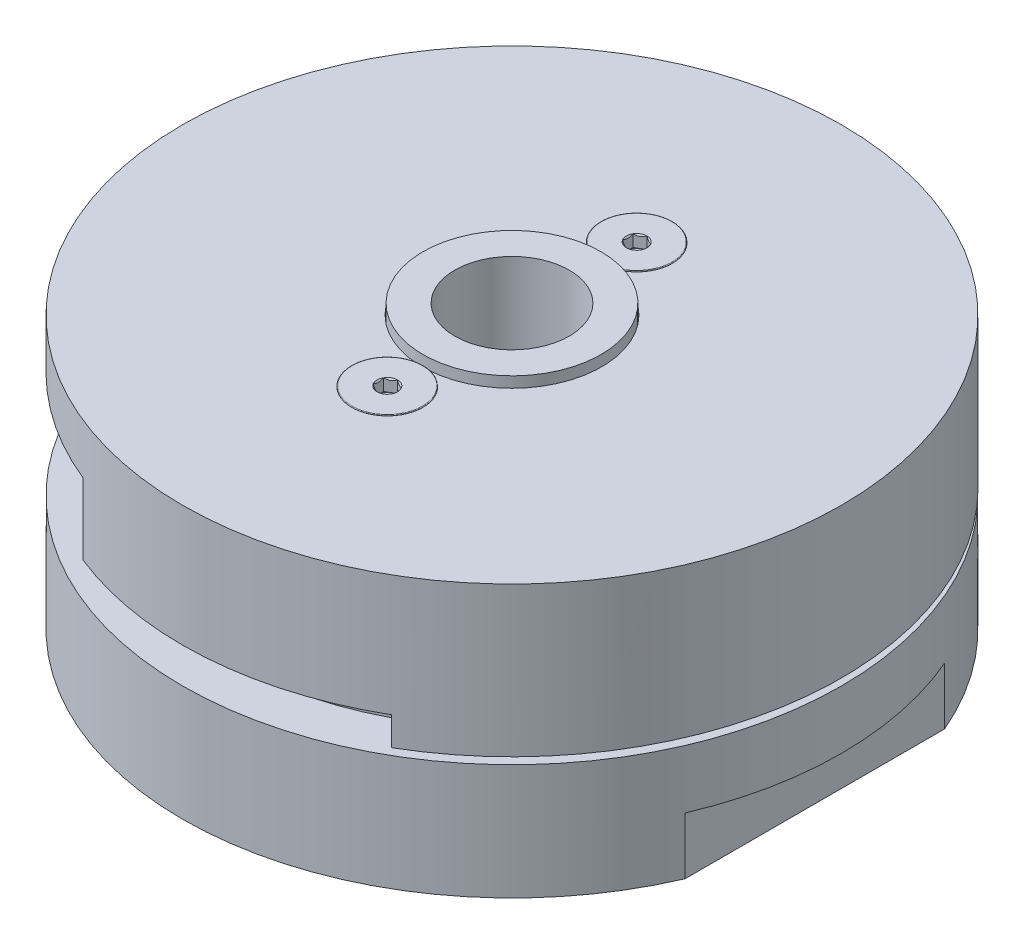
ISO-10303-21;
HEADER;
FILE_DESCRIPTION(('STEP AP214'),'2;1');
FILE_NAME('part.step','',(''),(''),'','','');
FILE_SCHEMA(('AUTOMOTIVE_DESIGN { 1 0 10303 214 1 1 1 1 }'));
ENDSEC;
DATA;
#1=APPLICATION_CONTEXT('core data for automotive mechanical design processes');
#2=APPLICATION_PROTOCOL_DEFINITION('international standard','automotive_design',2000,#1);
#3=PRODUCT_CONTEXT('',#1,'mechanical');
#4=PRODUCT('Part','Part','',(#3));
#5=PRODUCT_RELATED_PRODUCT_CATEGORY('part','',(#4));
#6=PRODUCT_DEFINITION_FORMATION('','',#4);
#7=PRODUCT_DEFINITION_CONTEXT('part definition',#1,'design');
#8=PRODUCT_DEFINITION('design','',#6,#7);
#9=PRODUCT_DEFINITION_SHAPE('','',#8);
#10=(LENGTH_UNIT() NAMED_UNIT(*) SI_UNIT(.MILLI.,.METRE.));
#11=(NAMED_UNIT(*) PLANE_ANGLE_UNIT() SI_UNIT($,.RADIAN.));
#12=(NAMED_UNIT(*) SI_UNIT($,.STERADIAN.) SOLID_ANGLE_UNIT());
#13=UNCERTAINTY_MEASURE_WITH_UNIT(LENGTH_MEASURE(1.E-05),#10,'distance_accuracy_value','');
#14=(GEOMETRIC_REPRESENTATION_CONTEXT(3) GLOBAL_UNCERTAINTY_ASSIGNED_CONTEXT((#13)) GLOBAL_UNIT_ASSIGNED_CONTEXT((#10,
#11,#12)) REPRESENTATION_CONTEXT('',''));
#15=CARTESIAN_POINT('',(0.,0.,0.));
#16=DIRECTION('',(0.,0.,1.));
#17=DIRECTION('',(1.,0.,0.));
#18=AXIS2_PLACEMENT_3D('',#15,#16,#17);
#19=CARTESIAN_POINT('',(-14.5922999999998,10.2869999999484,14.5923000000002));
#20=DIRECTION('',(0.,-1.,0.));
#21=DIRECTION('',(0.,0.,-1.));
#22=AXIS2_PLACEMENT_3D('',#19,#20,#21);
#23=CONICAL_SURFACE('',#22,3.40000000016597,1.02974425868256);
#24=CARTESIAN_POINT('',(-14.5922999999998,12.3299261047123,14.5923000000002));
#25=VERTEX_POINT('',#24);
#26=VERTEX_LOOP('',#25);
#27=FACE_BOUND('',#26,.T.);
#28=CARTESIAN_POINT('',(-14.5922999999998,10.287,14.5923000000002));
#29=DIRECTION('',(0.,-1.,0.));
#30=DIRECTION('',(0.,0.,-1.));
#31=AXIS2_PLACEMENT_3D('',#28,#29,#30);
#32=CIRCLE('',#31,3.39999999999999);
#33=CARTESIAN_POINT('',(-14.5922999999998,10.287,11.1923000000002));
#34=VERTEX_POINT('',#33);
#35=EDGE_CURVE('E869',#34,#34,#32,.T.);
#36=ORIENTED_EDGE('',*,*,#35,.T.);
#37=EDGE_LOOP('',(#36));
#38=FACE_BOUND('',#37,.T.);
#39=ADVANCED_FACE('F18',(#27,#38),#23,.F.);
#40=CARTESIAN_POINT('',(-14.5923000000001,10.2870000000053,-14.5922999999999));
#41=DIRECTION('',(0.,-1.,0.));
#42=DIRECTION('',(0.,0.,-1.));
#43=AXIS2_PLACEMENT_3D('',#40,#41,#42);
#44=CONICAL_SURFACE('',#43,3.40000000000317,1.02974425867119);
#45=CARTESIAN_POINT('',(-14.5923000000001,12.3299261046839,-14.5923000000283));
#46=VERTEX_POINT('',#45);
#47=VERTEX_LOOP('',#46);
#48=FACE_BOUND('',#47,.T.);
#49=CARTESIAN_POINT('',(-14.5923000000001,10.287,-14.5922999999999));
#50=DIRECTION('',(0.,-1.,0.));
#51=DIRECTION('',(0.,0.,-1.));
#52=AXIS2_PLACEMENT_3D('',#49,#50,#51);
#53=CIRCLE('',#52,3.4);
#54=CARTESIAN_POINT('',(-14.5923000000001,10.287,-17.9922999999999));
#55=VERTEX_POINT('',#54);
#56=EDGE_CURVE('E1040',#55,#55,#53,.T.);
#57=ORIENTED_EDGE('',*,*,#56,.T.);
#58=EDGE_LOOP('',(#57));
#59=FACE_BOUND('',#58,.T.);
#60=ADVANCED_FACE('F1792',(#48,#59),#44,.F.);
#61=CARTESIAN_POINT('',(14.5922999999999,10.2870000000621,-14.5923));
#62=DIRECTION('',(0.,-1.,0.));
#63=DIRECTION('',(0.,0.,-1.));
#64=AXIS2_PLACEMENT_3D('',#61,#62,#63);
#65=CONICAL_SURFACE('',#64,3.39999999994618,1.02974425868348);
#66=CARTESIAN_POINT('',(14.5922999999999,12.3299261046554,-14.5923));
#67=VERTEX_POINT('',#66);
#68=VERTEX_LOOP('',#67);
#69=FACE_BOUND('',#68,.T.);
#70=CARTESIAN_POINT('',(14.5922999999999,10.287,-14.5923));
#71=DIRECTION('',(0.,-1.,0.));
#72=DIRECTION('',(0.,0.,-1.));
#73=AXIS2_PLACEMENT_3D('',#70,#71,#72);
#74=CIRCLE('',#73,3.39999999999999);
#75=CARTESIAN_POINT('',(14.5922999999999,10.287,-17.9923));
#76=VERTEX_POINT('',#75);
#77=EDGE_CURVE('E1037',#76,#76,#74,.T.);
#78=ORIENTED_EDGE('',*,*,#77,.T.);
#79=EDGE_LOOP('',(#78));
#80=FACE_BOUND('',#79,.T.);
#81=ADVANCED_FACE('F1789',(#69,#80),#65,.F.);
#82=CARTESIAN_POINT('',(14.5923,10.2869999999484,14.5923));
#83=DIRECTION('',(0.,-1.,0.));
#84=DIRECTION('',(0.,0.,-1.));
#85=AXIS2_PLACEMENT_3D('',#82,#83,#84);
#86=CONICAL_SURFACE('',#85,3.40000000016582,1.02974425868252);
#87=CARTESIAN_POINT('',(14.5923,12.3299261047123,14.5923));
#88=VERTEX_POINT('',#87);
#89=VERTEX_LOOP('',#88);
#90=FACE_BOUND('',#89,.T.);
#91=CARTESIAN_POINT('',(14.5923,10.287,14.5923));
#92=DIRECTION('',(0.,-1.,0.));
#93=DIRECTION('',(0.,0.,-1.));
#94=AXIS2_PLACEMENT_3D('',#91,#92,#93);
#95=CIRCLE('',#94,3.39999999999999);
#96=CARTESIAN_POINT('',(14.5923,10.287,11.1923));
#97=VERTEX_POINT('',#96);
#98=EDGE_CURVE('E1034',#97,#97,#95,.T.);
#99=ORIENTED_EDGE('',*,*,#98,.T.);
#100=EDGE_LOOP('',(#99));
#101=FACE_BOUND('',#100,.T.);
#102=ADVANCED_FACE('F1785',(#90,#101),#86,.F.);
#103=CARTESIAN_POINT('',(0.,10.2870000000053,-20.6375));
#104=DIRECTION('',(0.,-1.,0.));
#105=DIRECTION('',(0.,0.,-1.));
#106=AXIS2_PLACEMENT_3D('',#103,#104,#105);
#107=CONICAL_SURFACE('',#106,4.24999999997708,1.02974425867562);
#108=CARTESIAN_POINT('',(0.,12.840657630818,-20.6375));
#109=VERTEX_POINT('',#108);
#110=VERTEX_LOOP('',#109);
#111=FACE_BOUND('',#110,.T.);
#112=CARTESIAN_POINT('',(0.,10.287,-20.6375));
#113=DIRECTION('',(0.,-1.,0.));
#114=DIRECTION('',(0.,0.,-1.));
#115=AXIS2_PLACEMENT_3D('',#112,#113,#114);
#116=CIRCLE('',#115,4.24999999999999);
#117=CARTESIAN_POINT('',(0.,10.287,-24.8875));
#118=VERTEX_POINT('',#117);
#119=EDGE_CURVE('E1031',#118,#118,#116,.T.);
#120=ORIENTED_EDGE('',*,*,#119,.T.);
#121=EDGE_LOOP('',(#120));
#122=FACE_BOUND('',#121,.T.);
#123=ADVANCED_FACE('F1781',(#111,#122),#107,.F.);
#124=CARTESIAN_POINT('',(0.,10.2870000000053,20.6375));
#125=DIRECTION('',(0.,-1.,0.));
#126=DIRECTION('',(0.,0.,-1.));
#127=AXIS2_PLACEMENT_3D('',#124,#125,#126);
#128=CONICAL_SURFACE('',#127,4.24999999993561,1.02974425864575);
#129=CARTESIAN_POINT('',(0.,12.8406576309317,20.6375));
#130=VERTEX_POINT('',#129);
#131=VERTEX_LOOP('',#130);
#132=FACE_BOUND('',#131,.T.);
#133=CARTESIAN_POINT('',(0.,10.287,20.6375));
#134=DIRECTION('',(0.,-1.,0.));
#135=DIRECTION('',(0.,0.,-1.));
#136=AXIS2_PLACEMENT_3D('',#133,#134,#135);
#137=CIRCLE('',#136,4.24999999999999);
#138=CARTESIAN_POINT('',(0.,10.287,16.3875));
#139=VERTEX_POINT('',#138);
#140=EDGE_CURVE('E1026',#139,#139,#137,.T.);
#141=ORIENTED_EDGE('',*,*,#140,.T.);
#142=EDGE_LOOP('',(#141));
#143=FACE_BOUND('',#142,.T.);
#144=ADVANCED_FACE('F1777',(#132,#143),#128,.F.);
#145=CARTESIAN_POINT('',(-14.5922999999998,0.,14.5923000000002));
#146=DIRECTION('',(0.,-1.,0.));
#147=DIRECTION('',(0.,0.,-1.));
#148=AXIS2_PLACEMENT_3D('',#145,#146,#147);
#149=CYLINDRICAL_SURFACE('',#148,3.39999999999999);
#150=ORIENTED_EDGE('',*,*,#35,.F.);
#151=EDGE_LOOP('',(#150));
#152=FACE_BOUND('',#151,.T.);
#153=CARTESIAN_POINT('',(-14.5922999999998,0.,14.5923000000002));
#154=DIRECTION('',(0.,-1.,0.));
#155=DIRECTION('',(0.,0.,-1.));
#156=AXIS2_PLACEMENT_3D('',#153,#154,#155);
#157=CIRCLE('',#156,3.39999999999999);
#158=CARTESIAN_POINT('',(-14.5922999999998,0.,11.1923000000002));
#159=VERTEX_POINT('',#158);
#160=EDGE_CURVE('E870',#159,#159,#157,.T.);
#161=ORIENTED_EDGE('',*,*,#160,.T.);
#162=EDGE_LOOP('',(#161));
#163=FACE_BOUND('',#162,.T.);
#164=ADVANCED_FACE('F1773',(#152,#163),#149,.F.);
#165=CARTESIAN_POINT('',(-14.5923000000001,0.,-14.5922999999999));
#166=DIRECTION('',(0.,-1.,0.));
#167=DIRECTION('',(0.,0.,-1.));
#168=AXIS2_PLACEMENT_3D('',#165,#166,#167);
#169=CYLINDRICAL_SURFACE('',#168,3.4);
#170=ORIENTED_EDGE('',*,*,#56,.F.);
#171=EDGE_LOOP('',(#170));
#172=FACE_BOUND('',#171,.T.);
#173=CARTESIAN_POINT('',(-14.5923000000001,0.,-14.5922999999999));
#174=DIRECTION('',(0.,-1.,0.));
#175=DIRECTION('',(0.,0.,-1.));
#176=AXIS2_PLACEMENT_3D('',#173,#174,#175);
#177=CIRCLE('',#176,3.4);
#178=CARTESIAN_POINT('',(-14.5923000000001,0.,-17.9922999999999));
#179=VERTEX_POINT('',#178);
#180=EDGE_CURVE('E873',#179,#179,#177,.T.);
#181=ORIENTED_EDGE('',*,*,#180,.T.);
#182=EDGE_LOOP('',(#181));
#183=FACE_BOUND('',#182,.T.);
#184=ADVANCED_FACE('F1769',(#172,#183),#169,.F.);
#185=CARTESIAN_POINT('',(14.5922999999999,0.,-14.5923));
#186=DIRECTION('',(0.,-1.,0.));
#187=DIRECTION('',(0.,0.,-1.));
#188=AXIS2_PLACEMENT_3D('',#185,#186,#187);
#189=CYLINDRICAL_SURFACE('',#188,3.39999999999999);
#190=ORIENTED_EDGE('',*,*,#77,.F.);
#191=EDGE_LOOP('',(#190));
#192=FACE_BOUND('',#191,.T.);
#193=CARTESIAN_POINT('',(14.5922999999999,0.,-14.5923));
#194=DIRECTION('',(0.,-1.,0.));
#195=DIRECTION('',(0.,0.,-1.));
#196=AXIS2_PLACEMENT_3D('',#193,#194,#195);
#197=CIRCLE('',#196,3.39999999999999);
#198=CARTESIAN_POINT('',(14.5922999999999,0.,-17.9923));
#199=VERTEX_POINT('',#198);
#200=EDGE_CURVE('E877',#199,#199,#197,.T.);
#201=ORIENTED_EDGE('',*,*,#200,.T.);
#202=EDGE_LOOP('',(#201));
#203=FACE_BOUND('',#202,.T.);
#204=ADVANCED_FACE('F1765',(#192,#203),#189,.F.);
#205=CARTESIAN_POINT('',(14.5923,0.,14.5923));
#206=DIRECTION('',(0.,-1.,0.));
#207=DIRECTION('',(0.,0.,-1.));
#208=AXIS2_PLACEMENT_3D('',#205,#206,#207);
#209=CYLINDRICAL_SURFACE('',#208,3.39999999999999);
#210=ORIENTED_EDGE('',*,*,#98,.F.);
#211=EDGE_LOOP('',(#210));
#212=FACE_BOUND('',#211,.T.);
#213=CARTESIAN_POINT('',(14.5923,0.,14.5923));
#214=DIRECTION('',(0.,-1.,0.));
#215=DIRECTION('',(0.,0.,-1.));
#216=AXIS2_PLACEMENT_3D('',#213,#214,#215);
#217=CIRCLE('',#216,3.39999999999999);
#218=CARTESIAN_POINT('',(14.5923,0.,11.1923));
#219=VERTEX_POINT('',#218);
#220=EDGE_CURVE('E880',#219,#219,#217,.T.);
#221=ORIENTED_EDGE('',*,*,#220,.T.);
#222=EDGE_LOOP('',(#221));
#223=FACE_BOUND('',#222,.T.);
#224=ADVANCED_FACE('F1761',(#212,#223),#209,.F.);
#225=CARTESIAN_POINT('',(0.,0.,-20.6375));
#226=DIRECTION('',(0.,-1.,0.));
#227=DIRECTION('',(0.,0.,-1.));
#228=AXIS2_PLACEMENT_3D('',#225,#226,#227);
#229=CYLINDRICAL_SURFACE('',#228,4.24999999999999);
#230=ORIENTED_EDGE('',*,*,#119,.F.);
#231=EDGE_LOOP('',(#230));
#232=FACE_BOUND('',#231,.T.);
#233=CARTESIAN_POINT('',(0.,0.,-20.6375));
#234=DIRECTION('',(0.,-1.,0.));
#235=DIRECTION('',(0.,0.,-1.));
#236=AXIS2_PLACEMENT_3D('',#233,#234,#235);
#237=CIRCLE('',#236,4.24999999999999);
#238=CARTESIAN_POINT('',(0.,0.,-24.8875));
#239=VERTEX_POINT('',#238);
#240=EDGE_CURVE('E883',#239,#239,#237,.T.);
#241=ORIENTED_EDGE('',*,*,#240,.T.);
#242=EDGE_LOOP('',(#241));
#243=FACE_BOUND('',#242,.T.);
#244=ADVANCED_FACE('F1757',(#232,#243),#229,.F.);
#245=CARTESIAN_POINT('',(0.,0.,20.6375));
#246=DIRECTION('',(0.,-1.,0.));
#247=DIRECTION('',(0.,0.,-1.));
#248=AXIS2_PLACEMENT_3D('',#245,#246,#247);
#249=CYLINDRICAL_SURFACE('',#248,4.24999999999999);
#250=ORIENTED_EDGE('',*,*,#140,.F.);
#251=EDGE_LOOP('',(#250));
#252=FACE_BOUND('',#251,.T.);
#253=CARTESIAN_POINT('',(0.,0.,20.6375));
#254=DIRECTION('',(0.,-1.,0.));
#255=DIRECTION('',(0.,0.,-1.));
#256=AXIS2_PLACEMENT_3D('',#253,#254,#255);
#257=CIRCLE('',#256,4.24999999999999);
#258=CARTESIAN_POINT('',(0.,0.,16.3875));
#259=VERTEX_POINT('',#258);
#260=EDGE_CURVE('E886',#259,#259,#257,.T.);
#261=ORIENTED_EDGE('',*,*,#260,.T.);
#262=EDGE_LOOP('',(#261));
#263=FACE_BOUND('',#262,.T.);
#264=ADVANCED_FACE('F1753',(#252,#263),#249,.F.);
#265=CARTESIAN_POINT('',(0.,5.08,0.));
#266=DIRECTION('',(0.,-1.,0.));
#267=DIRECTION('',(0.,0.,-1.));
#268=AXIS2_PLACEMENT_3D('',#265,#266,#267);
#269=PLANE('',#268);
#270=CARTESIAN_POINT('',(0.,5.08,0.));
#271=DIRECTION('',(0.,-1.,0.));
#272=DIRECTION('',(0.,0.,-1.));
#273=AXIS2_PLACEMENT_3D('',#270,#271,#272);
#274=CIRCLE('',#273,29.3624);
#275=CARTESIAN_POINT('',(-26.9875,5.08,-11.5682919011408));
#276=VERTEX_POINT('',#275);
#277=CARTESIAN_POINT('',(-26.9875,5.08,11.5682919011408));
#278=VERTEX_POINT('',#277);
#279=EDGE_CURVE('E890',#276,#278,#274,.F.);
#280=ORIENTED_EDGE('',*,*,#279,.F.);
#281=DIRECTION('',(0.,0.,-1.));
#282=VECTOR('',#281,1.);
#283=CARTESIAN_POINT('',(-26.9875,5.08,11.5682919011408));
#284=LINE('',#283,#282);
#285=EDGE_CURVE('E1019',#276,#278,#284,.F.);
#286=ORIENTED_EDGE('',*,*,#285,.T.);
#287=EDGE_LOOP('',(#280,#286));
#288=FACE_BOUND('',#287,.T.);
#289=ADVANCED_FACE('F1749',(#288),#269,.T.);
#290=CARTESIAN_POINT('',(-26.9875,5.08,11.5682919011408));
#291=DIRECTION('',(1.,0.,0.));
#292=DIRECTION('',(0.,0.,-1.));
#293=AXIS2_PLACEMENT_3D('',#290,#291,#292);
#294=PLANE('',#293);
#295=DIRECTION('',(0.,-1.,0.));
#296=VECTOR('',#295,1.);
#297=CARTESIAN_POINT('',(-26.9875,10.287,11.5682919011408));
#298=LINE('',#297,#296);
#299=CARTESIAN_POINT('',(-26.9875,0.,11.5682919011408));
#300=VERTEX_POINT('',#299);
#301=EDGE_CURVE('E892',#278,#300,#298,.T.);
#302=ORIENTED_EDGE('',*,*,#301,.F.);
#303=ORIENTED_EDGE('',*,*,#285,.F.);
#304=DIRECTION('',(0.,-1.,0.));
#305=VECTOR('',#304,1.);
#306=CARTESIAN_POINT('',(-26.9875,10.287,-11.5682919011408));
#307=LINE('',#306,#305);
#308=CARTESIAN_POINT('',(-26.9875,0.,-11.5682919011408));
#309=VERTEX_POINT('',#308);
#310=EDGE_CURVE('E893',#309,#276,#307,.F.);
#311=ORIENTED_EDGE('',*,*,#310,.F.);
#312=DIRECTION('',(0.,0.,1.));
#313=VECTOR('',#312,1.);
#314=CARTESIAN_POINT('',(-26.9875,0.,0.));
#315=LINE('',#314,#313);
#316=EDGE_CURVE('E1011',#309,#300,#315,.T.);
#317=ORIENTED_EDGE('',*,*,#316,.T.);
#318=EDGE_LOOP('',(#302,#303,#311,#317));
#319=FACE_BOUND('',#318,.T.);
#320=ADVANCED_FACE('F1745',(#319),#294,.F.);
#321=CARTESIAN_POINT('',(0.,5.08,0.));
#322=DIRECTION('',(0.,-1.,0.));
#323=DIRECTION('',(0.,0.,-1.));
#324=AXIS2_PLACEMENT_3D('',#321,#322,#323);
#325=PLANE('',#324);
#326=CARTESIAN_POINT('',(0.,5.08,0.));
#327=DIRECTION('',(0.,-1.,0.));
#328=DIRECTION('',(0.,0.,-1.));
#329=AXIS2_PLACEMENT_3D('',#326,#327,#328);
#330=CIRCLE('',#329,29.3624);
#331=CARTESIAN_POINT('',(26.9875,5.08,11.5682919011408));
#332=VERTEX_POINT('',#331);
#333=CARTESIAN_POINT('',(26.9875,5.08,-11.5682919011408));
#334=VERTEX_POINT('',#333);
#335=EDGE_CURVE('E898',#332,#334,#330,.F.);
#336=ORIENTED_EDGE('',*,*,#335,.F.);
#337=DIRECTION('',(0.,0.,1.));
#338=VECTOR('',#337,1.);
#339=CARTESIAN_POINT('',(26.9875,5.08,11.5682919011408));
#340=LINE('',#339,#338);
#341=EDGE_CURVE('E874',#332,#334,#340,.F.);
#342=ORIENTED_EDGE('',*,*,#341,.T.);
#343=EDGE_LOOP('',(#336,#342));
#344=FACE_BOUND('',#343,.T.);
#345=ADVANCED_FACE('F1741',(#344),#325,.T.);
#346=CARTESIAN_POINT('',(26.9875,5.08,11.5682919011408));
#347=DIRECTION('',(-1.,0.,0.));
#348=DIRECTION('',(0.,0.,1.));
#349=AXIS2_PLACEMENT_3D('',#346,#347,#348);
#350=PLANE('',#349);
#351=DIRECTION('',(0.,-1.,0.));
#352=VECTOR('',#351,1.);
#353=CARTESIAN_POINT('',(26.9875,10.287,-11.5682919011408));
#354=LINE('',#353,#352);
#355=CARTESIAN_POINT('',(26.9875,0.,-11.5682919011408));
#356=VERTEX_POINT('',#355);
#357=EDGE_CURVE('E900',#334,#356,#354,.T.);
#358=ORIENTED_EDGE('',*,*,#357,.F.);
#359=ORIENTED_EDGE('',*,*,#341,.F.);
#360=DIRECTION('',(0.,-1.,0.));
#361=VECTOR('',#360,1.);
#362=CARTESIAN_POINT('',(26.9875,10.287,11.5682919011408));
#363=LINE('',#362,#361);
#364=CARTESIAN_POINT('',(26.9875,0.,11.5682919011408));
#365=VERTEX_POINT('',#364);
#366=EDGE_CURVE('E897',#365,#332,#363,.F.);
#367=ORIENTED_EDGE('',*,*,#366,.F.);
#368=DIRECTION('',(0.,0.,1.));
#369=VECTOR('',#368,1.);
#370=CARTESIAN_POINT('',(26.9875,0.,0.));
#371=LINE('',#370,#369);
#372=EDGE_CURVE('E889',#365,#356,#371,.F.);
#373=ORIENTED_EDGE('',*,*,#372,.T.);
#374=EDGE_LOOP('',(#358,#359,#367,#373));
#375=FACE_BOUND('',#374,.T.);
#376=ADVANCED_FACE('F1737',(#375),#350,.F.);
#377=CARTESIAN_POINT('',(0.,0.,0.));
#378=DIRECTION('',(0.,1.,0.));
#379=DIRECTION('',(0.,0.,1.));
#380=AXIS2_PLACEMENT_3D('',#377,#378,#379);
#381=PLANE('',#380);
#382=ORIENTED_EDGE('',*,*,#316,.F.);
#383=CARTESIAN_POINT('',(0.,0.,0.));
#384=DIRECTION('',(0.,-1.,0.));
#385=DIRECTION('',(0.,0.,-1.));
#386=AXIS2_PLACEMENT_3D('',#383,#384,#385);
#387=CIRCLE('',#386,29.3624);
#388=EDGE_CURVE('E901',#356,#309,#387,.F.);
#389=ORIENTED_EDGE('',*,*,#388,.F.);
#390=ORIENTED_EDGE('',*,*,#372,.F.);
#391=CARTESIAN_POINT('',(0.,0.,0.));
#392=DIRECTION('',(0.,-1.,0.));
#393=DIRECTION('',(0.,0.,-1.));
#394=AXIS2_PLACEMENT_3D('',#391,#392,#393);
#395=CIRCLE('',#394,29.3624);
#396=EDGE_CURVE('E894',#300,#365,#395,.F.);
#397=ORIENTED_EDGE('',*,*,#396,.F.);
#398=EDGE_LOOP('',(#382,#389,#390,#397));
#399=FACE_BOUND('',#398,.T.);
#400=CARTESIAN_POINT('',(0.,0.,0.));
#401=DIRECTION('',(0.,-1.,0.));
#402=DIRECTION('',(0.,0.,-1.));
#403=AXIS2_PLACEMENT_3D('',#400,#401,#402);
#404=CIRCLE('',#403,14.224);
#405=CARTESIAN_POINT('',(0.,0.,-14.224));
#406=VERTEX_POINT('',#405);
#407=EDGE_CURVE('E903',#406,#406,#404,.F.);
#408=ORIENTED_EDGE('',*,*,#407,.T.);
#409=EDGE_LOOP('',(#408));
#410=FACE_BOUND('',#409,.T.);
#411=ORIENTED_EDGE('',*,*,#260,.F.);
#412=EDGE_LOOP('',(#411));
#413=FACE_BOUND('',#412,.T.);
#414=ORIENTED_EDGE('',*,*,#240,.F.);
#415=EDGE_LOOP('',(#414));
#416=FACE_BOUND('',#415,.T.);
#417=ORIENTED_EDGE('',*,*,#220,.F.);
#418=EDGE_LOOP('',(#417));
#419=FACE_BOUND('',#418,.T.);
#420=ORIENTED_EDGE('',*,*,#200,.F.);
#421=EDGE_LOOP('',(#420));
#422=FACE_BOUND('',#421,.T.);
#423=ORIENTED_EDGE('',*,*,#180,.F.);
#424=EDGE_LOOP('',(#423));
#425=FACE_BOUND('',#424,.T.);
#426=ORIENTED_EDGE('',*,*,#160,.F.);
#427=EDGE_LOOP('',(#426));
#428=FACE_BOUND('',#427,.T.);
#429=ADVANCED_FACE('F1733',(#399,#410,#413,#416,#419,#422,#425,#428),#381,.F.);
#430=CARTESIAN_POINT('',(0.,10.287,0.));
#431=DIRECTION('',(0.,-1.,0.));
#432=DIRECTION('',(0.,0.,-1.));
#433=AXIS2_PLACEMENT_3D('',#430,#431,#432);
#434=CYLINDRICAL_SURFACE('',#433,29.3624);
#435=ORIENTED_EDGE('',*,*,#301,.T.);
#436=ORIENTED_EDGE('',*,*,#396,.T.);
#437=ORIENTED_EDGE('',*,*,#366,.T.);
#438=ORIENTED_EDGE('',*,*,#335,.T.);
#439=ORIENTED_EDGE('',*,*,#357,.T.);
#440=ORIENTED_EDGE('',*,*,#388,.T.);
#441=ORIENTED_EDGE('',*,*,#310,.T.);
#442=ORIENTED_EDGE('',*,*,#279,.T.);
#443=EDGE_LOOP('',(#435,#436,#437,#438,#439,#440,#441,#442));
#444=FACE_BOUND('',#443,.T.);
#445=CARTESIAN_POINT('',(0.,10.287,0.));
#446=DIRECTION('',(0.,-1.,0.));
#447=DIRECTION('',(0.,0.,-1.));
#448=AXIS2_PLACEMENT_3D('',#445,#446,#447);
#449=CIRCLE('',#448,29.3624);
#450=CARTESIAN_POINT('',(0.,10.287,-29.3624));
#451=VERTEX_POINT('',#450);
#452=EDGE_CURVE('E906',#451,#451,#449,.F.);
#453=ORIENTED_EDGE('',*,*,#452,.F.);
#454=EDGE_LOOP('',(#453));
#455=FACE_BOUND('',#454,.T.);
#456=ADVANCED_FACE('F1729',(#444,#455),#434,.T.);
#457=CARTESIAN_POINT('',(0.,1.27,0.));
#458=DIRECTION('',(0.,-1.,0.));
#459=DIRECTION('',(0.,0.,-1.));
#460=AXIS2_PLACEMENT_3D('',#457,#458,#459);
#461=CYLINDRICAL_SURFACE('',#460,14.224);
#462=ORIENTED_EDGE('',*,*,#407,.F.);
#463=EDGE_LOOP('',(#462));
#464=FACE_BOUND('',#463,.T.);
#465=CARTESIAN_POINT('',(0.,1.27,0.));
#466=DIRECTION('',(0.,-1.,0.));
#467=DIRECTION('',(0.,0.,-1.));
#468=AXIS2_PLACEMENT_3D('',#465,#466,#467);
#469=CIRCLE('',#468,14.224);
#470=CARTESIAN_POINT('',(0.,1.27,-14.224));
#471=VERTEX_POINT('',#470);
#472=EDGE_CURVE('E909',#471,#471,#469,.T.);
#473=ORIENTED_EDGE('',*,*,#472,.F.);
#474=EDGE_LOOP('',(#473));
#475=FACE_BOUND('',#474,.T.);
#476=ADVANCED_FACE('F1725',(#464,#475),#461,.F.);
#477=CARTESIAN_POINT('',(0.,10.287,0.));
#478=DIRECTION('',(0.,1.,0.));
#479=DIRECTION('',(0.,0.,1.));
#480=AXIS2_PLACEMENT_3D('',#477,#478,#479);
#481=PLANE('',#480);
#482=CARTESIAN_POINT('',(0.,10.287,0.));
#483=DIRECTION('',(0.,-1.,0.));
#484=DIRECTION('',(0.,0.,-1.));
#485=AXIS2_PLACEMENT_3D('',#482,#483,#484);
#486=CIRCLE('',#485,25.4);
#487=CARTESIAN_POINT('',(0.,10.287,-25.4));
#488=VERTEX_POINT('',#487);
#489=EDGE_CURVE('E912',#488,#488,#486,.F.);
#490=ORIENTED_EDGE('',*,*,#489,.F.);
#491=EDGE_LOOP('',(#490));
#492=FACE_BOUND('',#491,.T.);
#493=ORIENTED_EDGE('',*,*,#452,.T.);
#494=EDGE_LOOP('',(#493));
#495=FACE_BOUND('',#494,.T.);
#496=ADVANCED_FACE('F1721',(#492,#495),#481,.T.);
#497=CARTESIAN_POINT('',(0.,22.910261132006,-11.1125));
#498=DIRECTION('',(0.,1.,0.));
#499=DIRECTION('',(0.,0.,1.));
#500=AXIS2_PLACEMENT_3D('',#497,#498,#499);
#501=PLANE('',#500);
#502=CARTESIAN_POINT('',(0.,22.9102611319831,-11.1125));
#503=DIRECTION('',(0.,1.,0.));
#504=DIRECTION('',(-1.,0.,0.));
#505=AXIS2_PLACEMENT_3D('',#502,#503,#504);
#506=CIRCLE('',#505,0.185165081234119);
#507=CARTESIAN_POINT('',(-0.18516508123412,22.9102611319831,-11.1125));
#508=VERTEX_POINT('',#507);
#509=EDGE_CURVE('E915',#508,#508,#506,.T.);
#510=ORIENTED_EDGE('',*,*,#509,.T.);
#511=EDGE_LOOP('',(#510));
#512=FACE_BOUND('',#511,.T.);
#513=ADVANCED_FACE('F1715',(#512),#501,.T.);
#514=CARTESIAN_POINT('',(0.,17.9657277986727,-11.1125));
#515=DIRECTION('',(0.,-1.,0.));
#516=DIRECTION('',(0.,0.,-1.));
#517=AXIS2_PLACEMENT_3D('',#514,#515,#516);
#518=PLANE('',#517);
#519=CARTESIAN_POINT('',(0.,17.9657277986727,-11.1125));
#520=DIRECTION('',(0.,1.,0.));
#521=DIRECTION('',(0.,0.,1.));
#522=AXIS2_PLACEMENT_3D('',#519,#520,#521);
#523=CIRCLE('',#522,1.1303);
#524=CARTESIAN_POINT('',(0.,17.9657277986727,-9.9822));
#525=VERTEX_POINT('',#524);
#526=EDGE_CURVE('E918',#525,#525,#523,.F.);
#527=ORIENTED_EDGE('',*,*,#526,.T.);
#528=EDGE_LOOP('',(#527));
#529=FACE_BOUND('',#528,.T.);
#530=ADVANCED_FACE('F1708',(#529),#518,.T.);
#531=CARTESIAN_POINT('',(0.,17.9657277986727,11.1125));
#532=DIRECTION('',(0.,-1.,0.));
#533=DIRECTION('',(0.,0.,-1.));
#534=AXIS2_PLACEMENT_3D('',#531,#532,#533);
#535=PLANE('',#534);
#536=CARTESIAN_POINT('',(0.,17.9657277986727,11.1125));
#537=DIRECTION('',(0.,1.,0.));
#538=DIRECTION('',(0.,0.,1.));
#539=AXIS2_PLACEMENT_3D('',#536,#537,#538);
#540=CIRCLE('',#539,1.1303);
#541=CARTESIAN_POINT('',(0.,17.9657277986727,12.2428));
#542=VERTEX_POINT('',#541);
#543=EDGE_CURVE('E922',#542,#542,#540,.F.);
#544=ORIENTED_EDGE('',*,*,#543,.T.);
#545=EDGE_LOOP('',(#544));
#546=FACE_BOUND('',#545,.T.);
#547=ADVANCED_FACE('F1706',(#546),#535,.T.);
#548=CARTESIAN_POINT('',(0.,1.27,0.));
#549=DIRECTION('',(0.,-1.,0.));
#550=DIRECTION('',(0.,0.,-1.));
#551=AXIS2_PLACEMENT_3D('',#548,#549,#550);
#552=PLANE('',#551);
#553=ORIENTED_EDGE('',*,*,#472,.T.);
#554=EDGE_LOOP('',(#553));
#555=FACE_BOUND('',#554,.T.);
#556=CARTESIAN_POINT('',(0.,1.27,0.));
#557=DIRECTION('',(0.,-1.,0.));
#558=DIRECTION('',(0.,0.,-1.));
#559=AXIS2_PLACEMENT_3D('',#556,#557,#558);
#560=CIRCLE('',#559,11.90625);
#561=CARTESIAN_POINT('',(0.,1.27,-11.90625));
#562=VERTEX_POINT('',#561);
#563=EDGE_CURVE('E927',#562,#562,#560,.F.);
#564=ORIENTED_EDGE('',*,*,#563,.T.);
#565=EDGE_LOOP('',(#564));
#566=FACE_BOUND('',#565,.T.);
#567=ADVANCED_FACE('F983',(#555,#566),#552,.T.);
#568=CARTESIAN_POINT('',(0.,11.3029999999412,-11.1125));
#569=DIRECTION('',(0.,1.,0.));
#570=DIRECTION('',(0.,0.,1.));
#571=AXIS2_PLACEMENT_3D('',#568,#569,#570);
#572=CONICAL_SURFACE('',#571,1.13029999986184,1.02974425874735);
#573=CARTESIAN_POINT('',(0.,11.303,-11.1125));
#574=DIRECTION('',(0.,1.,0.));
#575=DIRECTION('',(0.,0.,1.));
#576=AXIS2_PLACEMENT_3D('',#573,#574,#575);
#577=CIRCLE('',#576,1.1303);
#578=CARTESIAN_POINT('',(0.832431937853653,11.3030000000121,-11.8771143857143));
#579=VERTEX_POINT('',#578);
#580=CARTESIAN_POINT('',(-0.832431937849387,11.3030000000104,-11.8771143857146));
#581=VERTEX_POINT('',#580);
#582=EDGE_CURVE('E921',#579,#581,#577,.T.);
#583=ORIENTED_EDGE('',*,*,#582,.T.);
#584=CARTESIAN_POINT('',(-0.83243193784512,11.3030000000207,-11.8771143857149));
#585=CARTESIAN_POINT('',(-0.798984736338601,11.2891609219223,-11.8794582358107));
#586=CARTESIAN_POINT('',(-0.765384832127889,11.2756564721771,-11.8816715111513));
#587=CARTESIAN_POINT('',(-0.697805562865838,11.2495196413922,-11.8858321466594));
#588=CARTESIAN_POINT('',(-0.663825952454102,11.2368878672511,-11.8877793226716));
#589=CARTESIAN_POINT('',(-0.595088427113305,11.2125877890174,-11.8914193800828));
#590=CARTESIAN_POINT('',(-0.560326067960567,11.2009314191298,-11.8931092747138));
#591=CARTESIAN_POINT('',(-0.490358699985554,11.1790307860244,-11.8961996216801));
#592=CARTESIAN_POINT('',(-0.455153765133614,11.1687862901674,-11.8976001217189));
#593=CARTESIAN_POINT('',(-0.351089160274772,11.1412972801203,-11.9012699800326));
#594=CARTESIAN_POINT('',(-0.281519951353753,11.1264564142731,-11.9031284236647));
#595=CARTESIAN_POINT('',(-0.176297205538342,11.1112393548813,-11.9049962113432));
#596=CARTESIAN_POINT('',(-0.141152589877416,11.1073418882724,-11.9054654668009));
#597=CARTESIAN_POINT('',(-0.0706731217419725,11.1021117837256,-11.9060923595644));
#598=CARTESIAN_POINT('',(-0.0353383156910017,11.1007785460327,-11.9062500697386));
#599=CARTESIAN_POINT('',(0.0459399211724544,11.100782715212,-11.9062499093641));
#600=CARTESIAN_POINT('',(0.0918857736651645,11.1030413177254,-11.9059831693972));
#601=CARTESIAN_POINT('',(0.183400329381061,11.1118127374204,-11.9049255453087));
#602=CARTESIAN_POINT('',(0.228968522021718,11.1183305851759,-11.9041340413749));
#603=CARTESIAN_POINT('',(0.319542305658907,11.1349755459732,-11.9020477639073));
#604=CARTESIAN_POINT('',(0.364545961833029,11.1451127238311,-11.9007515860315));
#605=CARTESIAN_POINT('',(0.453777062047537,11.168216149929,-11.8976833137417));
#606=CARTESIAN_POINT('',(0.498004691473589,11.1811817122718,-11.8959113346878));
#607=CARTESIAN_POINT('',(0.591248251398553,11.211004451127,-11.8916634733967));
#608=CARTESIAN_POINT('',(0.640168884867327,11.228145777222,-11.8891271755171));
#609=CARTESIAN_POINT('',(0.736972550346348,11.2643199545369,-11.8835175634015));
#610=CARTESIAN_POINT('',(0.784859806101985,11.283341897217,-11.8804472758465));
#611=CARTESIAN_POINT('',(0.832431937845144,11.3030000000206,-11.8771143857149));
#612=B_SPLINE_CURVE_WITH_KNOTS('',3,(#584,#585,#586,#587,#588,#589,#590,#591,#592,#593,#594,
#595,#596,#597,#598,#599,#600,#601,#602,#603,#604,#605,#606,#607,#608,#609,#610,#611),
.UNSPECIFIED.,.F.,.F.,(4,2,2,2,2,2,2,2,2,2,2,2,2,4),(0.,0.108823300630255,0.217721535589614,
0.327800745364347,0.437861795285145,0.650763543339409,0.756771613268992,0.862754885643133,
1.00053347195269,1.13847508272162,1.27680331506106,1.41509803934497,1.57074069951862,
1.7255283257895),.UNSPECIFIED.);
#613=EDGE_CURVE('E930',#581,#579,#612,.T.);
#614=ORIENTED_EDGE('',*,*,#613,.T.);
#615=EDGE_LOOP('',(#583,#614));
#616=FACE_BOUND('',#615,.T.);
#617=ADVANCED_FACE('F945',(#616),#572,.F.);
#618=CARTESIAN_POINT('',(0.,11.3029999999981,11.1125));
#619=DIRECTION('',(0.,1.,0.));
#620=DIRECTION('',(0.,0.,1.));
#621=AXIS2_PLACEMENT_3D('',#618,#619,#620);
#622=CONICAL_SURFACE('',#621,1.13029999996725,1.02974425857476);
#623=CARTESIAN_POINT('',(0.832431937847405,11.3030000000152,11.8771143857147));
#624=CARTESIAN_POINT('',(0.798984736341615,11.2891609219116,11.8794582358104));
#625=CARTESIAN_POINT('',(0.765384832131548,11.2756564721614,11.8816715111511));
#626=CARTESIAN_POINT('',(0.697805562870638,11.2495196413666,11.8858321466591));
#627=CARTESIAN_POINT('',(0.6638259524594,11.2368878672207,11.8877793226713));
#628=CARTESIAN_POINT('',(0.595088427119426,11.2125877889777,11.8914193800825));
#629=CARTESIAN_POINT('',(0.56032606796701,11.2009314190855,11.8931092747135));
#630=CARTESIAN_POINT('',(0.490358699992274,11.1790307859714,11.8961996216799));
#631=CARTESIAN_POINT('',(0.455153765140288,11.1687862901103,11.8976001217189));
#632=CARTESIAN_POINT('',(0.351089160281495,11.1412972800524,11.9012699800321));
#633=CARTESIAN_POINT('',(0.28151995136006,11.1264564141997,11.9031284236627));
#634=CARTESIAN_POINT('',(0.17629720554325,11.1112393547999,11.904996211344));
#635=CARTESIAN_POINT('',(0.141152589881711,11.1073418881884,11.9054654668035));
#636=CARTESIAN_POINT('',(0.0706731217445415,11.1021117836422,11.9060923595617));
#637=CARTESIAN_POINT('',(0.0353383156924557,11.1007785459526,11.9062500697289));
#638=CARTESIAN_POINT('',(-0.0459399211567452,11.1007827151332,11.9062499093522));
#639=CARTESIAN_POINT('',(-0.0918857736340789,11.103041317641,11.9059831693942));
#640=CARTESIAN_POINT('',(-0.183400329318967,11.1118127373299,11.9049255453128));
#641=CARTESIAN_POINT('',(-0.228968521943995,11.118330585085,11.9041340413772));
#642=CARTESIAN_POINT('',(-0.319542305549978,11.1349755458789,11.9020477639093));
#643=CARTESIAN_POINT('',(-0.364545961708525,11.145112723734,11.900751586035));
#644=CARTESIAN_POINT('',(-0.453777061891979,11.1682161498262,11.8976833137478));
#645=CARTESIAN_POINT('',(-0.498004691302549,11.1811817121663,11.8959113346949));
#646=CARTESIAN_POINT('',(-0.59124825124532,11.2110044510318,11.8916634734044));
#647=CARTESIAN_POINT('',(-0.640168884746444,11.2281457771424,11.8891271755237));
#648=CARTESIAN_POINT('',(-0.736972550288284,11.2643199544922,11.8835175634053));
#649=CARTESIAN_POINT('',(-0.7848598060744,11.2833418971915,11.8804472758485));
#650=CARTESIAN_POINT('',(-0.832431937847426,11.3030000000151,11.8771143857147));
#651=B_SPLINE_CURVE_WITH_KNOTS('',3,(#623,#624,#625,#626,#627,#628,#629,#630,#631,#632,#633,
#634,#635,#636,#637,#638,#639,#640,#641,#642,#643,#644,#645,#646,#647,#648,#649,#650),
.UNSPECIFIED.,.F.,.F.,(4,2,2,2,2,2,2,2,2,2,2,2,2,4),(0.,0.108823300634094,0.217721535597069,
0.327800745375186,0.437861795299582,0.650763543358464,0.756771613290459,0.862754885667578,
1.00053347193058,1.13847508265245,1.27680331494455,1.41509803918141,1.57074069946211,
1.72552832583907),.UNSPECIFIED.);
#652=CARTESIAN_POINT('',(0.832431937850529,11.3030000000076,11.8771143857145));
#653=VERTEX_POINT('',#652);
#654=CARTESIAN_POINT('',(-0.832431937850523,11.3030000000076,11.8771143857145));
#655=VERTEX_POINT('',#654);
#656=EDGE_CURVE('E939',#653,#655,#651,.T.);
#657=ORIENTED_EDGE('',*,*,#656,.T.);
#658=CARTESIAN_POINT('',(0.,11.303,11.1125));
#659=DIRECTION('',(0.,1.,0.));
#660=DIRECTION('',(0.,0.,1.));
#661=AXIS2_PLACEMENT_3D('',#658,#659,#660);
#662=CIRCLE('',#661,1.1303);
#663=EDGE_CURVE('E925',#655,#653,#662,.T.);
#664=ORIENTED_EDGE('',*,*,#663,.T.);
#665=EDGE_LOOP('',(#657,#664));
#666=FACE_BOUND('',#665,.T.);
#667=ADVANCED_FACE('F975',(#666),#622,.F.);
#668=CARTESIAN_POINT('',(0.,22.910261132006,11.1125));
#669=DIRECTION('',(0.,1.,0.));
#670=DIRECTION('',(0.,0.,1.));
#671=AXIS2_PLACEMENT_3D('',#668,#669,#670);
#672=PLANE('',#671);
#673=CARTESIAN_POINT('',(0.,22.9102611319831,11.1125));
#674=DIRECTION('',(0.,1.,0.));
#675=DIRECTION('',(-1.,0.,0.));
#676=AXIS2_PLACEMENT_3D('',#673,#674,#675);
#677=CIRCLE('',#676,0.185165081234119);
#678=CARTESIAN_POINT('',(-0.18516508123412,22.9102611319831,11.1125));
#679=VERTEX_POINT('',#678);
#680=EDGE_CURVE('E989',#679,#679,#677,.T.);
#681=ORIENTED_EDGE('',*,*,#680,.T.);
#682=EDGE_LOOP('',(#681));
#683=FACE_BOUND('',#682,.T.);
#684=ADVANCED_FACE('F972',(#683),#672,.T.);
#685=CARTESIAN_POINT('',(0.,21.082,0.));
#686=DIRECTION('',(0.,-1.,0.));
#687=DIRECTION('',(0.,0.,-1.));
#688=AXIS2_PLACEMENT_3D('',#685,#686,#687);
#689=CYLINDRICAL_SURFACE('',#688,25.4);
#690=ORIENTED_EDGE('',*,*,#489,.T.);
#691=EDGE_LOOP('',(#690));
#692=FACE_BOUND('',#691,.T.);
#693=CARTESIAN_POINT('',(0.,21.082,0.));
#694=DIRECTION('',(0.,-1.,0.));
#695=DIRECTION('',(0.,0.,-1.));
#696=AXIS2_PLACEMENT_3D('',#693,#694,#695);
#697=CIRCLE('',#696,25.4);
#698=CARTESIAN_POINT('',(0.,21.082,-25.4));
#699=VERTEX_POINT('',#698);
#700=EDGE_CURVE('E1468',#699,#699,#697,.F.);
#701=ORIENTED_EDGE('',*,*,#700,.F.);
#702=EDGE_LOOP('',(#701));
#703=FACE_BOUND('',#702,.T.);
#704=ADVANCED_FACE('F968',(#692,#703),#689,.T.);
#705=CARTESIAN_POINT('',(0.,23.2616277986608,-11.1125));
#706=DIRECTION('',(0.,1.,0.));
#707=DIRECTION('',(-1.,0.,0.));
#708=AXIS2_PLACEMENT_3D('',#705,#706,#707);
#709=CONICAL_SURFACE('',#708,0.793750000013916,1.04719755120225);
#710=ORIENTED_EDGE('',*,*,#509,.F.);
#711=EDGE_LOOP('',(#710));
#712=FACE_BOUND('',#711,.T.);
#713=CARTESIAN_POINT('',(0.,23.2616277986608,-11.1125));
#714=DIRECTION('',(0.,1.,0.));
#715=DIRECTION('',(-1.,0.,0.));
#716=AXIS2_PLACEMENT_3D('',#713,#714,#715);
#717=CIRCLE('',#716,0.793750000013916);
#718=CARTESIAN_POINT('',(0.793750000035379,23.2616277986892,-11.1125));
#719=VERTEX_POINT('',#718);
#720=CARTESIAN_POINT('',(0.396875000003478,23.2616277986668,-10.4250923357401));
#721=VERTEX_POINT('',#720);
#722=EDGE_CURVE('E1472',#719,#721,#717,.F.);
#723=ORIENTED_EDGE('',*,*,#722,.F.);
#724=CARTESIAN_POINT('',(0.,23.2616277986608,-11.1125));
#725=DIRECTION('',(0.,1.,0.));
#726=DIRECTION('',(-1.,0.,0.));
#727=AXIS2_PLACEMENT_3D('',#724,#725,#726);
#728=CIRCLE('',#727,0.793750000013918);
#729=CARTESIAN_POINT('',(0.396875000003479,23.2616277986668,-11.7999076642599));
#730=VERTEX_POINT('',#729);
#731=EDGE_CURVE('E1470',#730,#719,#728,.F.);
#732=ORIENTED_EDGE('',*,*,#731,.F.);
#733=CARTESIAN_POINT('',(0.,23.2616277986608,-11.1125));
#734=DIRECTION('',(0.,1.,0.));
#735=DIRECTION('',(-1.,0.,0.));
#736=AXIS2_PLACEMENT_3D('',#733,#734,#735);
#737=CIRCLE('',#736,0.793750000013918);
#738=CARTESIAN_POINT('',(-0.396875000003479,23.2616277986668,-11.7999076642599));
#739=VERTEX_POINT('',#738);
#740=EDGE_CURVE('E1481',#739,#730,#737,.F.);
#741=ORIENTED_EDGE('',*,*,#740,.F.);
#742=CARTESIAN_POINT('',(0.,23.2616277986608,-11.1125));
#743=DIRECTION('',(0.,1.,0.));
#744=DIRECTION('',(-1.,0.,0.));
#745=AXIS2_PLACEMENT_3D('',#742,#743,#744);
#746=CIRCLE('',#745,0.793750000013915);
#747=CARTESIAN_POINT('',(-0.793750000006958,23.2616277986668,-11.1125));
#748=VERTEX_POINT('',#747);
#749=EDGE_CURVE('E1483',#748,#739,#746,.F.);
#750=ORIENTED_EDGE('',*,*,#749,.F.);
#751=CARTESIAN_POINT('',(0.,23.2616277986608,-11.1125));
#752=DIRECTION('',(0.,1.,0.));
#753=DIRECTION('',(-1.,0.,0.));
#754=AXIS2_PLACEMENT_3D('',#751,#752,#753);
#755=CIRCLE('',#754,0.793750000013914);
#756=CARTESIAN_POINT('',(-0.396875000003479,23.2616277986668,-10.4250923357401));
#757=VERTEX_POINT('',#756);
#758=EDGE_CURVE('E1479',#757,#748,#755,.F.);
#759=ORIENTED_EDGE('',*,*,#758,.F.);
#760=CARTESIAN_POINT('',(0.,23.2616277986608,-11.1125));
#761=DIRECTION('',(0.,1.,0.));
#762=DIRECTION('',(-1.,0.,0.));
#763=AXIS2_PLACEMENT_3D('',#760,#761,#762);
#764=CIRCLE('',#763,0.793750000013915);
#765=EDGE_CURVE('E1477',#721,#757,#764,.F.);
#766=ORIENTED_EDGE('',*,*,#765,.F.);
#767=EDGE_LOOP('',(#723,#732,#741,#750,#759,#766));
#768=FACE_BOUND('',#767,.T.);
#769=ADVANCED_FACE('F964',(#712,#768),#709,.F.);
#770=CARTESIAN_POINT('',(0.,22.098,-11.1125));
#771=DIRECTION('',(0.,1.,0.));
#772=DIRECTION('',(0.,0.,1.));
#773=AXIS2_PLACEMENT_3D('',#770,#771,#772);
#774=CYLINDRICAL_SURFACE('',#773,1.1303);
#775=ORIENTED_EDGE('',*,*,#526,.F.);
#776=EDGE_LOOP('',(#775));
#777=FACE_BOUND('',#776,.T.);
#778=ORIENTED_EDGE('',*,*,#582,.F.);
#779=DIRECTION('',(0.,-1.,0.));
#780=VECTOR('',#779,1.);
#781=CARTESIAN_POINT('',(0.832431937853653,1.27,-11.8771143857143));
#782=LINE('',#781,#780);
#783=CARTESIAN_POINT('',(0.83243193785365,11.557,-11.8771143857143));
#784=VERTEX_POINT('',#783);
#785=EDGE_CURVE('E938',#579,#784,#782,.F.);
#786=ORIENTED_EDGE('',*,*,#785,.T.);
#787=CARTESIAN_POINT('',(0.,11.557,-11.1125));
#788=DIRECTION('',(0.,1.,0.));
#789=DIRECTION('',(0.,0.,1.));
#790=AXIS2_PLACEMENT_3D('',#787,#788,#789);
#791=CIRCLE('',#790,1.1303);
#792=CARTESIAN_POINT('',(-0.832431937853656,11.557,-11.8771143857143));
#793=VERTEX_POINT('',#792);
#794=EDGE_CURVE('E1485',#784,#793,#791,.F.);
#795=ORIENTED_EDGE('',*,*,#794,.T.);
#796=DIRECTION('',(0.,-1.,0.));
#797=VECTOR('',#796,1.);
#798=CARTESIAN_POINT('',(-0.832431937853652,1.27,-11.8771143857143));
#799=LINE('',#798,#797);
#800=EDGE_CURVE('E997',#793,#581,#799,.T.);
#801=ORIENTED_EDGE('',*,*,#800,.T.);
#802=EDGE_LOOP('',(#778,#786,#795,#801));
#803=FACE_BOUND('',#802,.T.);
#804=ADVANCED_FACE('F960',(#777,#803),#774,.F.);
#805=CARTESIAN_POINT('',(0.,22.098,11.1125));
#806=DIRECTION('',(0.,1.,0.));
#807=DIRECTION('',(0.,0.,1.));
#808=AXIS2_PLACEMENT_3D('',#805,#806,#807);
#809=CYLINDRICAL_SURFACE('',#808,1.1303);
#810=ORIENTED_EDGE('',*,*,#663,.F.);
#811=DIRECTION('',(0.,1.,0.));
#812=VECTOR('',#811,1.);
#813=CARTESIAN_POINT('',(-0.832431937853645,22.098,11.8771143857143));
#814=LINE('',#813,#812);
#815=CARTESIAN_POINT('',(-0.832431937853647,11.557,11.8771143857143));
#816=VERTEX_POINT('',#815);
#817=EDGE_CURVE('E926',#816,#655,#814,.F.);
#818=ORIENTED_EDGE('',*,*,#817,.F.);
#819=CARTESIAN_POINT('',(0.,11.557,11.1125));
#820=DIRECTION('',(0.,1.,0.));
#821=DIRECTION('',(0.,0.,1.));
#822=AXIS2_PLACEMENT_3D('',#819,#820,#821);
#823=CIRCLE('',#822,1.1303);
#824=CARTESIAN_POINT('',(0.832431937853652,11.557,11.8771143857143));
#825=VERTEX_POINT('',#824);
#826=EDGE_CURVE('E1489',#816,#825,#823,.F.);
#827=ORIENTED_EDGE('',*,*,#826,.T.);
#828=DIRECTION('',(0.,-1.,0.));
#829=VECTOR('',#828,1.);
#830=CARTESIAN_POINT('',(0.832431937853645,1.27,11.8771143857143));
#831=LINE('',#830,#829);
#832=EDGE_CURVE('E990',#825,#653,#831,.T.);
#833=ORIENTED_EDGE('',*,*,#832,.T.);
#834=EDGE_LOOP('',(#810,#818,#827,#833));
#835=FACE_BOUND('',#834,.T.);
#836=ORIENTED_EDGE('',*,*,#543,.F.);
#837=EDGE_LOOP('',(#836));
#838=FACE_BOUND('',#837,.T.);
#839=ADVANCED_FACE('F954',(#835,#838),#809,.F.);
#840=CARTESIAN_POINT('',(0.,1.27,0.));
#841=DIRECTION('',(0.,-1.,0.));
#842=DIRECTION('',(0.,0.,-1.));
#843=AXIS2_PLACEMENT_3D('',#840,#841,#842);
#844=CYLINDRICAL_SURFACE('',#843,11.90625);
#845=ORIENTED_EDGE('',*,*,#613,.F.);
#846=ORIENTED_EDGE('',*,*,#800,.F.);
#847=CARTESIAN_POINT('',(0.,11.557,0.));
#848=DIRECTION('',(0.,-1.,0.));
#849=DIRECTION('',(0.,0.,-1.));
#850=AXIS2_PLACEMENT_3D('',#847,#848,#849);
#851=CIRCLE('',#850,11.90625);
#852=EDGE_CURVE('E995',#793,#816,#851,.F.);
#853=ORIENTED_EDGE('',*,*,#852,.T.);
#854=ORIENTED_EDGE('',*,*,#817,.T.);
#855=ORIENTED_EDGE('',*,*,#656,.F.);
#856=ORIENTED_EDGE('',*,*,#832,.F.);
#857=CARTESIAN_POINT('',(0.,11.557,0.));
#858=DIRECTION('',(0.,-1.,0.));
#859=DIRECTION('',(0.,0.,-1.));
#860=AXIS2_PLACEMENT_3D('',#857,#858,#859);
#861=CIRCLE('',#860,11.90625);
#862=EDGE_CURVE('E1491',#825,#784,#861,.F.);
#863=ORIENTED_EDGE('',*,*,#862,.T.);
#864=ORIENTED_EDGE('',*,*,#785,.F.);
#865=EDGE_LOOP('',(#845,#846,#853,#854,#855,#856,#863,#864));
#866=FACE_BOUND('',#865,.T.);
#867=ORIENTED_EDGE('',*,*,#563,.F.);
#868=EDGE_LOOP('',(#867));
#869=FACE_BOUND('',#868,.T.);
#870=ADVANCED_FACE('F948',(#866,#869),#844,.F.);
#871=CARTESIAN_POINT('',(0.,23.2616277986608,11.1125));
#872=DIRECTION('',(0.,1.,0.));
#873=DIRECTION('',(-1.,0.,0.));
#874=AXIS2_PLACEMENT_3D('',#871,#872,#873);
#875=CONICAL_SURFACE('',#874,0.793750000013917,1.04719755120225);
#876=ORIENTED_EDGE('',*,*,#680,.F.);
#877=EDGE_LOOP('',(#876));
#878=FACE_BOUND('',#877,.T.);
#879=CARTESIAN_POINT('',(0.,23.2616277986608,11.1125));
#880=DIRECTION('',(0.,1.,0.));
#881=DIRECTION('',(-1.,0.,0.));
#882=AXIS2_PLACEMENT_3D('',#879,#880,#881);
#883=CIRCLE('',#882,0.793750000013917);
#884=CARTESIAN_POINT('',(0.793750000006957,23.2616277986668,11.1125));
#885=VERTEX_POINT('',#884);
#886=CARTESIAN_POINT('',(0.396875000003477,23.2616277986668,11.7999076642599));
#887=VERTEX_POINT('',#886);
#888=EDGE_CURVE('E1496',#885,#887,#883,.F.);
#889=ORIENTED_EDGE('',*,*,#888,.F.);
#890=CARTESIAN_POINT('',(0.,23.2616277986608,11.1125));
#891=DIRECTION('',(0.,1.,0.));
#892=DIRECTION('',(-1.,0.,0.));
#893=AXIS2_PLACEMENT_3D('',#890,#891,#892);
#894=CIRCLE('',#893,0.793750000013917);
#895=CARTESIAN_POINT('',(0.396875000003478,23.2616277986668,10.4250923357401));
#896=VERTEX_POINT('',#895);
#897=EDGE_CURVE('E1494',#896,#885,#894,.F.);
#898=ORIENTED_EDGE('',*,*,#897,.F.);
#899=CARTESIAN_POINT('',(0.,23.2616277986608,11.1125));
#900=DIRECTION('',(0.,1.,0.));
#901=DIRECTION('',(-1.,0.,0.));
#902=AXIS2_PLACEMENT_3D('',#899,#900,#901);
#903=CIRCLE('',#902,0.793750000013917);
#904=CARTESIAN_POINT('',(-0.396875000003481,23.2616277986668,10.4250923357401));
#905=VERTEX_POINT('',#904);
#906=EDGE_CURVE('E1502',#905,#896,#903,.F.);
#907=ORIENTED_EDGE('',*,*,#906,.F.);
#908=CARTESIAN_POINT('',(0.,23.2616277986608,11.1125));
#909=DIRECTION('',(0.,1.,0.));
#910=DIRECTION('',(-1.,0.,0.));
#911=AXIS2_PLACEMENT_3D('',#908,#909,#910);
#912=CIRCLE('',#911,0.793750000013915);
#913=CARTESIAN_POINT('',(-0.793750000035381,23.2616277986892,11.1125));
#914=VERTEX_POINT('',#913);
#915=EDGE_CURVE('E1504',#914,#905,#912,.F.);
#916=ORIENTED_EDGE('',*,*,#915,.F.);
#917=CARTESIAN_POINT('',(0.,23.2616277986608,11.1125));
#918=DIRECTION('',(0.,1.,0.));
#919=DIRECTION('',(-1.,0.,0.));
#920=AXIS2_PLACEMENT_3D('',#917,#918,#919);
#921=CIRCLE('',#920,0.793750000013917);
#922=CARTESIAN_POINT('',(-0.396875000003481,23.2616277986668,11.7999076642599));
#923=VERTEX_POINT('',#922);
#924=EDGE_CURVE('E1500',#923,#914,#921,.F.);
#925=ORIENTED_EDGE('',*,*,#924,.F.);
#926=CARTESIAN_POINT('',(0.,23.2616277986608,11.1125));
#927=DIRECTION('',(0.,1.,0.));
#928=DIRECTION('',(-1.,0.,0.));
#929=AXIS2_PLACEMENT_3D('',#926,#927,#928);
#930=CIRCLE('',#929,0.793750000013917);
#931=EDGE_CURVE('E1498',#887,#923,#930,.F.);
#932=ORIENTED_EDGE('',*,*,#931,.F.);
#933=EDGE_LOOP('',(#889,#898,#907,#916,#925,#932));
#934=FACE_BOUND('',#933,.T.);
#935=ADVANCED_FACE('F953',(#878,#934),#875,.F.);
#936=CARTESIAN_POINT('',(0.,21.082,0.));
#937=DIRECTION('',(0.,1.,0.));
#938=DIRECTION('',(0.,0.,1.));
#939=AXIS2_PLACEMENT_3D('',#936,#937,#938);
#940=PLANE('',#939);
#941=CARTESIAN_POINT('',(0.,21.082,0.));
#942=DIRECTION('',(0.,-1.,0.));
#943=DIRECTION('',(0.,0.,-1.));
#944=AXIS2_PLACEMENT_3D('',#941,#942,#943);
#945=CIRCLE('',#944,12.7);
#946=CARTESIAN_POINT('',(0.,21.082,-12.7));
#947=VERTEX_POINT('',#946);
#948=EDGE_CURVE('E1465',#947,#947,#945,.F.);
#949=ORIENTED_EDGE('',*,*,#948,.F.);
#950=EDGE_LOOP('',(#949));
#951=FACE_BOUND('',#950,.T.);
#952=ORIENTED_EDGE('',*,*,#700,.T.);
#953=EDGE_LOOP('',(#952));
#954=FACE_BOUND('',#953,.T.);
#955=ADVANCED_FACE('F1454',(#951,#954),#940,.T.);
#956=CARTESIAN_POINT('',(0.79375,23.2616277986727,-9.7376846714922));
#957=DIRECTION('',(0.,1.,0.));
#958=DIRECTION('',(0.,0.,1.));
#959=AXIS2_PLACEMENT_3D('',#956,#957,#958);
#960=PLANE('',#959);
#961=DIRECTION('',(0.,0.,1.));
#962=VECTOR('',#961,1.);
#963=CARTESIAN_POINT('',(0.793749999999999,23.2616277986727,-10.6542282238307));
#964=LINE('',#963,#962);
#965=CARTESIAN_POINT('',(0.793749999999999,23.2616277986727,-11.5707717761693));
#966=VERTEX_POINT('',#965);
#967=EDGE_CURVE('E1596',#719,#966,#964,.F.);
#968=ORIENTED_EDGE('',*,*,#967,.T.);
#969=DIRECTION('',(-0.866025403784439,0.,-0.5));
#970=VECTOR('',#969,1.);
#971=CARTESIAN_POINT('',(0.793749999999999,23.2616277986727,-11.5707717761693));
#972=LINE('',#971,#970);
#973=EDGE_CURVE('E1507',#966,#730,#972,.T.);
#974=ORIENTED_EDGE('',*,*,#973,.T.);
#975=ORIENTED_EDGE('',*,*,#731,.T.);
#976=EDGE_LOOP('',(#968,#974,#975));
#977=FACE_BOUND('',#976,.T.);
#978=ADVANCED_FACE('F1451',(#977),#960,.T.);
#979=CARTESIAN_POINT('',(0.79375,23.2616277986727,-9.7376846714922));
#980=DIRECTION('',(0.,1.,0.));
#981=DIRECTION('',(0.,0.,1.));
#982=AXIS2_PLACEMENT_3D('',#979,#980,#981);
#983=PLANE('',#982);
#984=DIRECTION('',(0.866025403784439,0.,-0.5));
#985=VECTOR('',#984,1.);
#986=CARTESIAN_POINT('',(0.,23.2616277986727,-10.1959564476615));
#987=LINE('',#986,#985);
#988=CARTESIAN_POINT('',(0.79375,23.2616277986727,-10.6542282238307));
#989=VERTEX_POINT('',#988);
#990=EDGE_CURVE('E1589',#721,#989,#987,.T.);
#991=ORIENTED_EDGE('',*,*,#990,.T.);
#992=DIRECTION('',(0.,0.,1.));
#993=VECTOR('',#992,1.);
#994=CARTESIAN_POINT('',(0.793749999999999,23.2616277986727,-10.6542282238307));
#995=LINE('',#994,#993);
#996=EDGE_CURVE('E1652',#989,#719,#995,.F.);
#997=ORIENTED_EDGE('',*,*,#996,.T.);
#998=ORIENTED_EDGE('',*,*,#722,.T.);
#999=EDGE_LOOP('',(#991,#997,#998));
#1000=FACE_BOUND('',#999,.T.);
#1001=ADVANCED_FACE('F1447',(#1000),#983,.T.);
#1002=CARTESIAN_POINT('',(0.79375,23.2616277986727,-9.7376846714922));
#1003=DIRECTION('',(0.,1.,0.));
#1004=DIRECTION('',(0.,0.,1.));
#1005=AXIS2_PLACEMENT_3D('',#1002,#1003,#1004);
#1006=PLANE('',#1005);
#1007=DIRECTION('',(0.866025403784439,0.,0.5));
#1008=VECTOR('',#1007,1.);
#1009=CARTESIAN_POINT('',(-0.793750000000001,23.2616277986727,-10.6542282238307));
#1010=LINE('',#1009,#1008);
#1011=CARTESIAN_POINT('',(0.,23.2616277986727,-10.1959564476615));
#1012=VERTEX_POINT('',#1011);
#1013=EDGE_CURVE('E1582',#757,#1012,#1010,.T.);
#1014=ORIENTED_EDGE('',*,*,#1013,.T.);
#1015=DIRECTION('',(0.866025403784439,0.,-0.5));
#1016=VECTOR('',#1015,1.);
#1017=CARTESIAN_POINT('',(0.,23.2616277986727,-10.1959564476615));
#1018=LINE('',#1017,#1016);
#1019=EDGE_CURVE('E1595',#1012,#721,#1018,.T.);
#1020=ORIENTED_EDGE('',*,*,#1019,.T.);
#1021=ORIENTED_EDGE('',*,*,#765,.T.);
#1022=EDGE_LOOP('',(#1014,#1020,#1021));
#1023=FACE_BOUND('',#1022,.T.);
#1024=ADVANCED_FACE('F1443',(#1023),#1006,.T.);
#1025=CARTESIAN_POINT('',(0.79375,23.2616277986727,-9.7376846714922));
#1026=DIRECTION('',(0.,1.,0.));
#1027=DIRECTION('',(0.,0.,1.));
#1028=AXIS2_PLACEMENT_3D('',#1025,#1026,#1027);
#1029=PLANE('',#1028);
#1030=DIRECTION('',(0.,0.,1.));
#1031=VECTOR('',#1030,1.);
#1032=CARTESIAN_POINT('',(-0.793750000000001,23.2616277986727,-11.5707717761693));
#1033=LINE('',#1032,#1031);
#1034=CARTESIAN_POINT('',(-0.793750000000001,23.2616277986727,-10.6542282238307));
#1035=VERTEX_POINT('',#1034);
#1036=EDGE_CURVE('E1575',#748,#1035,#1033,.T.);
#1037=ORIENTED_EDGE('',*,*,#1036,.T.);
#1038=DIRECTION('',(0.866025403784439,0.,0.5));
#1039=VECTOR('',#1038,1.);
#1040=CARTESIAN_POINT('',(-0.793750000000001,23.2616277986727,-10.6542282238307));
#1041=LINE('',#1040,#1039);
#1042=EDGE_CURVE('E1588',#1035,#757,#1041,.T.);
#1043=ORIENTED_EDGE('',*,*,#1042,.T.);
#1044=ORIENTED_EDGE('',*,*,#758,.T.);
#1045=EDGE_LOOP('',(#1037,#1043,#1044));
#1046=FACE_BOUND('',#1045,.T.);
#1047=ADVANCED_FACE('F1439',(#1046),#1029,.T.);
#1048=CARTESIAN_POINT('',(0.79375,23.2616277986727,-9.7376846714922));
#1049=DIRECTION('',(0.,1.,0.));
#1050=DIRECTION('',(0.,0.,1.));
#1051=AXIS2_PLACEMENT_3D('',#1048,#1049,#1050);
#1052=PLANE('',#1051);
#1053=DIRECTION('',(-0.866025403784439,0.,-0.5));
#1054=VECTOR('',#1053,1.);
#1055=CARTESIAN_POINT('',(0.793749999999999,23.2616277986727,-11.5707717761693));
#1056=LINE('',#1055,#1054);
#1057=CARTESIAN_POINT('',(0.,23.2616277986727,-12.0290435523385));
#1058=VERTEX_POINT('',#1057);
#1059=EDGE_CURVE('E1649',#730,#1058,#1056,.T.);
#1060=ORIENTED_EDGE('',*,*,#1059,.T.);
#1061=DIRECTION('',(-0.866025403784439,0.,0.5));
#1062=VECTOR('',#1061,1.);
#1063=CARTESIAN_POINT('',(0.,23.2616277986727,-12.0290435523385));
#1064=LINE('',#1063,#1062);
#1065=EDGE_CURVE('E1574',#1058,#739,#1064,.T.);
#1066=ORIENTED_EDGE('',*,*,#1065,.T.);
#1067=ORIENTED_EDGE('',*,*,#740,.T.);
#1068=EDGE_LOOP('',(#1060,#1066,#1067));
#1069=FACE_BOUND('',#1068,.T.);
#1070=ADVANCED_FACE('F1435',(#1069),#1052,.T.);
#1071=CARTESIAN_POINT('',(0.79375,23.2616277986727,-9.7376846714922));
#1072=DIRECTION('',(0.,1.,0.));
#1073=DIRECTION('',(0.,0.,1.));
#1074=AXIS2_PLACEMENT_3D('',#1071,#1072,#1073);
#1075=PLANE('',#1074);
#1076=DIRECTION('',(-0.866025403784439,0.,0.5));
#1077=VECTOR('',#1076,1.);
#1078=CARTESIAN_POINT('',(0.,23.2616277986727,-12.0290435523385));
#1079=LINE('',#1078,#1077);
#1080=CARTESIAN_POINT('',(-0.793750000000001,23.2616277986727,-11.5707717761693));
#1081=VERTEX_POINT('',#1080);
#1082=EDGE_CURVE('E1568',#739,#1081,#1079,.T.);
#1083=ORIENTED_EDGE('',*,*,#1082,.T.);
#1084=DIRECTION('',(0.,0.,1.));
#1085=VECTOR('',#1084,1.);
#1086=CARTESIAN_POINT('',(-0.793750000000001,23.2616277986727,-11.5707717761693));
#1087=LINE('',#1086,#1085);
#1088=EDGE_CURVE('E1581',#1081,#748,#1087,.T.);
#1089=ORIENTED_EDGE('',*,*,#1088,.T.);
#1090=ORIENTED_EDGE('',*,*,#749,.T.);
#1091=EDGE_LOOP('',(#1083,#1089,#1090));
#1092=FACE_BOUND('',#1091,.T.);
#1093=ADVANCED_FACE('F1431',(#1092),#1075,.T.);
#1094=CARTESIAN_POINT('',(0.,11.557,0.));
#1095=DIRECTION('',(0.,1.,0.));
#1096=DIRECTION('',(0.,0.,1.));
#1097=AXIS2_PLACEMENT_3D('',#1094,#1095,#1096);
#1098=PLANE('',#1097);
#1099=CARTESIAN_POINT('',(0.,11.557,0.));
#1100=DIRECTION('',(0.,1.,0.));
#1101=DIRECTION('',(0.,0.,1.));
#1102=AXIS2_PLACEMENT_3D('',#1099,#1100,#1101);
#1103=CIRCLE('',#1102,5.1);
#1104=CARTESIAN_POINT('',(0.,11.557,5.1));
#1105=VERTEX_POINT('',#1104);
#1106=EDGE_CURVE('E1508',#1105,#1105,#1103,.T.);
#1107=ORIENTED_EDGE('',*,*,#1106,.T.);
#1108=EDGE_LOOP('',(#1107));
#1109=FACE_BOUND('',#1108,.T.);
#1110=ORIENTED_EDGE('',*,*,#826,.F.);
#1111=ORIENTED_EDGE('',*,*,#852,.F.);
#1112=ORIENTED_EDGE('',*,*,#794,.F.);
#1113=ORIENTED_EDGE('',*,*,#862,.F.);
#1114=EDGE_LOOP('',(#1110,#1111,#1112,#1113));
#1115=FACE_BOUND('',#1114,.T.);
#1116=ADVANCED_FACE('F1427',(#1109,#1115),#1098,.F.);
#1117=CARTESIAN_POINT('',(0.793749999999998,23.2616277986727,12.4873153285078));
#1118=DIRECTION('',(0.,1.,0.));
#1119=DIRECTION('',(0.,0.,1.));
#1120=AXIS2_PLACEMENT_3D('',#1117,#1118,#1119);
#1121=PLANE('',#1120);
#1122=DIRECTION('',(0.,0.,1.));
#1123=VECTOR('',#1122,1.);
#1124=CARTESIAN_POINT('',(0.793749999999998,23.2616277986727,11.5707717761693));
#1125=LINE('',#1124,#1123);
#1126=CARTESIAN_POINT('',(0.793749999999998,23.2616277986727,10.6542282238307));
#1127=VERTEX_POINT('',#1126);
#1128=EDGE_CURVE('E1558',#885,#1127,#1125,.F.);
#1129=ORIENTED_EDGE('',*,*,#1128,.T.);
#1130=DIRECTION('',(-0.866025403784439,0.,-0.5));
#1131=VECTOR('',#1130,1.);
#1132=CARTESIAN_POINT('',(0.793749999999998,23.2616277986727,10.6542282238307));
#1133=LINE('',#1132,#1131);
#1134=EDGE_CURVE('E1510',#1127,#896,#1133,.T.);
#1135=ORIENTED_EDGE('',*,*,#1134,.T.);
#1136=ORIENTED_EDGE('',*,*,#897,.T.);
#1137=EDGE_LOOP('',(#1129,#1135,#1136));
#1138=FACE_BOUND('',#1137,.T.);
#1139=ADVANCED_FACE('F1423',(#1138),#1121,.T.);
#1140=CARTESIAN_POINT('',(0.793749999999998,23.2616277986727,12.4873153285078));
#1141=DIRECTION('',(0.,1.,0.));
#1142=DIRECTION('',(0.,0.,1.));
#1143=AXIS2_PLACEMENT_3D('',#1140,#1141,#1142);
#1144=PLANE('',#1143);
#1145=DIRECTION('',(0.866025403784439,0.,-0.5));
#1146=VECTOR('',#1145,1.);
#1147=CARTESIAN_POINT('',(0.,23.2616277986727,12.0290435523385));
#1148=LINE('',#1147,#1146);
#1149=CARTESIAN_POINT('',(0.793749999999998,23.2616277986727,11.5707717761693));
#1150=VERTEX_POINT('',#1149);
#1151=EDGE_CURVE('E1551',#887,#1150,#1148,.T.);
#1152=ORIENTED_EDGE('',*,*,#1151,.T.);
#1153=DIRECTION('',(0.,0.,1.));
#1154=VECTOR('',#1153,1.);
#1155=CARTESIAN_POINT('',(0.793749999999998,23.2616277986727,11.5707717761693));
#1156=LINE('',#1155,#1154);
#1157=EDGE_CURVE('E1602',#1150,#885,#1156,.F.);
#1158=ORIENTED_EDGE('',*,*,#1157,.T.);
#1159=ORIENTED_EDGE('',*,*,#888,.T.);
#1160=EDGE_LOOP('',(#1152,#1158,#1159));
#1161=FACE_BOUND('',#1160,.T.);
#1162=ADVANCED_FACE('F1419',(#1161),#1144,.T.);
#1163=CARTESIAN_POINT('',(0.793749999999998,23.2616277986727,12.4873153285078));
#1164=DIRECTION('',(0.,1.,0.));
#1165=DIRECTION('',(0.,0.,1.));
#1166=AXIS2_PLACEMENT_3D('',#1163,#1164,#1165);
#1167=PLANE('',#1166);
#1168=DIRECTION('',(0.866025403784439,0.,0.5));
#1169=VECTOR('',#1168,1.);
#1170=CARTESIAN_POINT('',(-0.793750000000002,23.2616277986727,11.5707717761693));
#1171=LINE('',#1170,#1169);
#1172=CARTESIAN_POINT('',(0.,23.2616277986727,12.0290435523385));
#1173=VERTEX_POINT('',#1172);
#1174=EDGE_CURVE('E1544',#923,#1173,#1171,.T.);
#1175=ORIENTED_EDGE('',*,*,#1174,.T.);
#1176=DIRECTION('',(0.866025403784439,0.,-0.5));
#1177=VECTOR('',#1176,1.);
#1178=CARTESIAN_POINT('',(0.,23.2616277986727,12.0290435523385));
#1179=LINE('',#1178,#1177);
#1180=EDGE_CURVE('E1557',#1173,#887,#1179,.T.);
#1181=ORIENTED_EDGE('',*,*,#1180,.T.);
#1182=ORIENTED_EDGE('',*,*,#931,.T.);
#1183=EDGE_LOOP('',(#1175,#1181,#1182));
#1184=FACE_BOUND('',#1183,.T.);
#1185=ADVANCED_FACE('F1415',(#1184),#1167,.T.);
#1186=CARTESIAN_POINT('',(0.793749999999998,23.2616277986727,12.4873153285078));
#1187=DIRECTION('',(0.,1.,0.));
#1188=DIRECTION('',(0.,0.,1.));
#1189=AXIS2_PLACEMENT_3D('',#1186,#1187,#1188);
#1190=PLANE('',#1189);
#1191=DIRECTION('',(0.,0.,1.));
#1192=VECTOR('',#1191,1.);
#1193=CARTESIAN_POINT('',(-0.793750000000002,23.2616277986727,10.6542282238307));
#1194=LINE('',#1193,#1192);
#1195=CARTESIAN_POINT('',(-0.793750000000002,23.2616277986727,11.5707717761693));
#1196=VERTEX_POINT('',#1195);
#1197=EDGE_CURVE('E1537',#914,#1196,#1194,.T.);
#1198=ORIENTED_EDGE('',*,*,#1197,.T.);
#1199=DIRECTION('',(0.866025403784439,0.,0.5));
#1200=VECTOR('',#1199,1.);
#1201=CARTESIAN_POINT('',(-0.793750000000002,23.2616277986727,11.5707717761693));
#1202=LINE('',#1201,#1200);
#1203=EDGE_CURVE('E1550',#1196,#923,#1202,.T.);
#1204=ORIENTED_EDGE('',*,*,#1203,.T.);
#1205=ORIENTED_EDGE('',*,*,#924,.T.);
#1206=EDGE_LOOP('',(#1198,#1204,#1205));
#1207=FACE_BOUND('',#1206,.T.);
#1208=ADVANCED_FACE('F1411',(#1207),#1190,.T.);
#1209=CARTESIAN_POINT('',(0.793749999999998,23.2616277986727,12.4873153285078));
#1210=DIRECTION('',(0.,1.,0.));
#1211=DIRECTION('',(0.,0.,1.));
#1212=AXIS2_PLACEMENT_3D('',#1209,#1210,#1211);
#1213=PLANE('',#1212);
#1214=DIRECTION('',(-0.866025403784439,0.,-0.5));
#1215=VECTOR('',#1214,1.);
#1216=CARTESIAN_POINT('',(0.793749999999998,23.2616277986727,10.6542282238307));
#1217=LINE('',#1216,#1215);
#1218=CARTESIAN_POINT('',(0.,23.2616277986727,10.1959564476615));
#1219=VERTEX_POINT('',#1218);
#1220=EDGE_CURVE('E1599',#896,#1219,#1217,.T.);
#1221=ORIENTED_EDGE('',*,*,#1220,.T.);
#1222=DIRECTION('',(-0.866025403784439,0.,0.5));
#1223=VECTOR('',#1222,1.);
#1224=CARTESIAN_POINT('',(0.,23.2616277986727,10.1959564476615));
#1225=LINE('',#1224,#1223);
#1226=EDGE_CURVE('E1536',#1219,#905,#1225,.T.);
#1227=ORIENTED_EDGE('',*,*,#1226,.T.);
#1228=ORIENTED_EDGE('',*,*,#906,.T.);
#1229=EDGE_LOOP('',(#1221,#1227,#1228));
#1230=FACE_BOUND('',#1229,.T.);
#1231=ADVANCED_FACE('F1407',(#1230),#1213,.T.);
#1232=CARTESIAN_POINT('',(0.793749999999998,23.2616277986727,12.4873153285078));
#1233=DIRECTION('',(0.,1.,0.));
#1234=DIRECTION('',(0.,0.,1.));
#1235=AXIS2_PLACEMENT_3D('',#1232,#1233,#1234);
#1236=PLANE('',#1235);
#1237=DIRECTION('',(-0.866025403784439,0.,0.5));
#1238=VECTOR('',#1237,1.);
#1239=CARTESIAN_POINT('',(0.,23.2616277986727,10.1959564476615));
#1240=LINE('',#1239,#1238);
#1241=CARTESIAN_POINT('',(-0.793750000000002,23.2616277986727,10.6542282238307));
#1242=VERTEX_POINT('',#1241);
#1243=EDGE_CURVE('E1525',#905,#1242,#1240,.T.);
#1244=ORIENTED_EDGE('',*,*,#1243,.T.);
#1245=DIRECTION('',(0.,0.,1.));
#1246=VECTOR('',#1245,1.);
#1247=CARTESIAN_POINT('',(-0.793750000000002,23.2616277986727,10.6542282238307));
#1248=LINE('',#1247,#1246);
#1249=EDGE_CURVE('E1543',#1242,#914,#1248,.T.);
#1250=ORIENTED_EDGE('',*,*,#1249,.T.);
#1251=ORIENTED_EDGE('',*,*,#915,.T.);
#1252=EDGE_LOOP('',(#1244,#1250,#1251));
#1253=FACE_BOUND('',#1252,.T.);
#1254=ADVANCED_FACE('F1403',(#1253),#1236,.T.);
#1255=CARTESIAN_POINT('',(0.,22.098,0.));
#1256=DIRECTION('',(0.,-1.,0.));
#1257=DIRECTION('',(0.,0.,-1.));
#1258=AXIS2_PLACEMENT_3D('',#1255,#1256,#1257);
#1259=CYLINDRICAL_SURFACE('',#1258,12.7);
#1260=ORIENTED_EDGE('',*,*,#948,.T.);
#1261=EDGE_LOOP('',(#1260));
#1262=FACE_BOUND('',#1261,.T.);
#1263=CARTESIAN_POINT('',(0.,22.098,0.));
#1264=DIRECTION('',(0.,-1.,0.));
#1265=DIRECTION('',(0.,0.,-1.));
#1266=AXIS2_PLACEMENT_3D('',#1263,#1264,#1265);
#1267=CIRCLE('',#1266,12.7);
#1268=CARTESIAN_POINT('',(0.,22.098,-12.7));
#1269=VERTEX_POINT('',#1268);
#1270=EDGE_CURVE('E1512',#1269,#1269,#1267,.F.);
#1271=ORIENTED_EDGE('',*,*,#1270,.F.);
#1272=EDGE_LOOP('',(#1271));
#1273=FACE_BOUND('',#1272,.T.);
#1274=ADVANCED_FACE('F1399',(#1262,#1273),#1259,.T.);
#1275=CARTESIAN_POINT('',(0.793749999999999,23.2616277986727,-11.5707717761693));
#1276=DIRECTION('',(0.5,0.,-0.866025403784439));
#1277=DIRECTION('',(-0.866025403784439,0.,-0.5));
#1278=AXIS2_PLACEMENT_3D('',#1275,#1276,#1277);
#1279=PLANE('',#1278);
#1280=CARTESIAN_POINT('',(0.793750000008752,24.3157277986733,-11.5707717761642));
#1281=CARTESIAN_POINT('',(0.766468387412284,24.2999919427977,-11.5865228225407));
#1282=CARTESIAN_POINT('',(0.738730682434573,24.2851803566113,-11.6025371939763));
#1283=CARTESIAN_POINT('',(0.682170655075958,24.2580609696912,-11.6351921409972));
#1284=CARTESIAN_POINT('',(0.653342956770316,24.2457682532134,-11.651835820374));
#1285=CARTESIAN_POINT('',(0.59521320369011,24.2247108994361,-11.6853970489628));
#1286=CARTESIAN_POINT('',(0.565925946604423,24.2158933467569,-11.7023060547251));
#1287=CARTESIAN_POINT('',(0.506707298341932,24.2023076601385,-11.7364959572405));
#1288=CARTESIAN_POINT('',(0.476777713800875,24.1975293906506,-11.753775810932));
#1289=CARTESIAN_POINT('',(0.425189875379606,24.193219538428,-11.7835600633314));
#1290=CARTESIAN_POINT('',(0.403598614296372,24.1925826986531,-11.79602578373));
#1291=CARTESIAN_POINT('',(0.360457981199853,24.1936560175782,-11.8209330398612));
#1292=CARTESIAN_POINT('',(0.338908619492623,24.1953666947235,-11.8333745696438));
#1293=CARTESIAN_POINT('',(0.274568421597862,24.2039069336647,-11.870521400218));
#1294=CARTESIAN_POINT('',(0.23209786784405,24.2141456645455,-11.8950417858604));
#1295=CARTESIAN_POINT('',(0.157588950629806,24.238843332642,-11.9380595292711));
#1296=CARTESIAN_POINT('',(0.125199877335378,24.252003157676,-11.9567593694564));
#1297=CARTESIAN_POINT('',(0.0616892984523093,24.2816451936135,-11.993427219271));
#1298=CARTESIAN_POINT('',(0.0305640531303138,24.2981165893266,-12.0113973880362));
#1299=CARTESIAN_POINT('',(-8.74662576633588E-12,24.3157277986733,-12.0290435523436));
#1300=B_SPLINE_CURVE_WITH_KNOTS('',3,(#1280,#1281,#1282,#1283,#1284,#1285,#1286,#1287,#1288,
#1289,#1290,#1291,#1292,#1293,#1294,#1295,#1296,#1297,#1298,#1299),.UNSPECIFIED.,.F.,.F.,(4,2,2,
2,2,2,2,2,2,4),(0.,0.105713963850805,0.212043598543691,0.316685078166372,0.421063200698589,
0.495773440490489,0.570500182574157,0.719996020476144,0.838779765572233,0.957181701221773),.UNSPECIFIED.);
#1301=CARTESIAN_POINT('',(0.793750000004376,24.3157277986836,-11.5707717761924));
#1302=VERTEX_POINT('',#1301);
#1303=CARTESIAN_POINT('',(0.,24.315727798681,-12.0290435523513));
#1304=VERTEX_POINT('',#1303);
#1305=EDGE_CURVE('E1385',#1302,#1304,#1300,.T.);
#1306=ORIENTED_EDGE('',*,*,#1305,.T.);
#1307=DIRECTION('',(0.,1.,0.));
#1308=VECTOR('',#1307,1.);
#1309=CARTESIAN_POINT('',(0.,23.2616277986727,-12.0290435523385));
#1310=LINE('',#1309,#1308);
#1311=EDGE_CURVE('E1511',#1304,#1058,#1310,.F.);
#1312=ORIENTED_EDGE('',*,*,#1311,.T.);
#1313=ORIENTED_EDGE('',*,*,#1059,.F.);
#1314=ORIENTED_EDGE('',*,*,#973,.F.);
#1315=DIRECTION('',(0.,1.,0.));
#1316=VECTOR('',#1315,1.);
#1317=CARTESIAN_POINT('',(0.793749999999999,23.2616277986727,-11.5707717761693));
#1318=LINE('',#1317,#1316);
#1319=EDGE_CURVE('E1592',#966,#1302,#1318,.T.);
#1320=ORIENTED_EDGE('',*,*,#1319,.T.);
#1321=EDGE_LOOP('',(#1306,#1312,#1313,#1314,#1320));
#1322=FACE_BOUND('',#1321,.T.);
#1323=ADVANCED_FACE('F1394',(#1322),#1279,.F.);
#1324=CARTESIAN_POINT('',(0.793749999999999,23.2616277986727,-10.6542282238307));
#1325=DIRECTION('',(1.,0.,0.));
#1326=DIRECTION('',(0.,1.,0.));
#1327=AXIS2_PLACEMENT_3D('',#1324,#1325,#1326);
#1328=PLANE('',#1327);
#1329=CARTESIAN_POINT('',(0.793749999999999,24.3157277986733,-10.6542282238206));
#1330=CARTESIAN_POINT('',(0.793749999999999,24.3000943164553,-10.6855245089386));
#1331=CARTESIAN_POINT('',(0.793749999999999,24.285373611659,-10.7173406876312));
#1332=CARTESIAN_POINT('',(0.793749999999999,24.2583902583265,-10.7822291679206));
#1333=CARTESIAN_POINT('',(0.793749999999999,24.246143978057,-10.8153082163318));
#1334=CARTESIAN_POINT('',(0.793749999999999,24.2249974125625,-10.8824224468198));
#1335=CARTESIAN_POINT('',(0.793749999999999,24.2160858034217,-10.9164539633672));
#1336=CARTESIAN_POINT('',(0.793749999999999,24.2023655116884,-10.9852626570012));
#1337=CARTESIAN_POINT('',(0.793749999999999,24.1975441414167,-11.0200371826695));
#1338=CARTESIAN_POINT('',(0.793749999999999,24.194324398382,-11.0645326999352));
#1339=CARTESIAN_POINT('',(0.793749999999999,24.1938039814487,-11.0741215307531));
#1340=CARTESIAN_POINT('',(0.793749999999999,24.1931081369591,-11.0933059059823));
#1341=CARTESIAN_POINT('',(0.793749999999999,24.1929325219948,-11.1029014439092));
#1342=CARTESIAN_POINT('',(0.793749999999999,24.1929428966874,-11.160650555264));
#1343=CARTESIAN_POINT('',(0.793749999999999,24.1974142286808,-11.208877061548));
#1344=CARTESIAN_POINT('',(0.793749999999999,24.214354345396,-11.3040533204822));
#1345=CARTESIAN_POINT('',(0.793749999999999,24.2268667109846,-11.3509946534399));
#1346=CARTESIAN_POINT('',(0.793749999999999,24.2524496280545,-11.4268613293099));
#1347=CARTESIAN_POINT('',(0.793749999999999,24.2638225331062,-11.4563902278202));
#1348=CARTESIAN_POINT('',(0.793749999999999,24.2884714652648,-11.5143299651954));
#1349=CARTESIAN_POINT('',(0.793749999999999,24.3017291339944,-11.5427485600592));
#1350=CARTESIAN_POINT('',(0.793749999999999,24.3157277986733,-11.5707717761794));
#1351=B_SPLINE_CURVE_WITH_KNOTS('',3,(#1329,#1330,#1331,#1332,#1333,#1334,#1335,#1336,#1337,
#1338,#1339,#1340,#1341,#1342,#1343,#1344,#1345,#1346,#1347,#1348,#1349,#1350),.UNSPECIFIED.,
.F.,.F.,(4,2,2,2,2,2,2,2,2,2,4),(0.,0.105023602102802,0.210720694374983,0.316055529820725,
0.421062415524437,0.449866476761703,0.478654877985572,0.623070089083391,0.768274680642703,
0.863134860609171,0.957127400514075),.UNSPECIFIED.);
#1352=CARTESIAN_POINT('',(0.793750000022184,24.3157277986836,-10.6542282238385));
#1353=VERTEX_POINT('',#1352);
#1354=EDGE_CURVE('E1380',#1353,#1302,#1351,.T.);
#1355=ORIENTED_EDGE('',*,*,#1354,.T.);
#1356=ORIENTED_EDGE('',*,*,#1319,.F.);
#1357=ORIENTED_EDGE('',*,*,#967,.F.);
#1358=ORIENTED_EDGE('',*,*,#996,.F.);
#1359=DIRECTION('',(0.,1.,0.));
#1360=VECTOR('',#1359,1.);
#1361=CARTESIAN_POINT('',(0.79375,23.2616277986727,-10.6542282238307));
#1362=LINE('',#1361,#1360);
#1363=EDGE_CURVE('E1585',#989,#1353,#1362,.T.);
#1364=ORIENTED_EDGE('',*,*,#1363,.T.);
#1365=EDGE_LOOP('',(#1355,#1356,#1357,#1358,#1364));
#1366=FACE_BOUND('',#1365,.T.);
#1367=ADVANCED_FACE('F1391',(#1366),#1328,.F.);
#1368=CARTESIAN_POINT('',(0.,23.2616277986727,-10.1959564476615));
#1369=DIRECTION('',(0.5,0.,0.866025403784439));
#1370=DIRECTION('',(0.866025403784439,0.,-0.5));
#1371=AXIS2_PLACEMENT_3D('',#1368,#1369,#1370);
#1372=PLANE('',#1371);
#1373=CARTESIAN_POINT('',(-8.75199661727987E-12,24.3157277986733,-10.1959564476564));
#1374=CARTESIAN_POINT('',(0.0272816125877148,24.2999919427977,-10.2117074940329));
#1375=CARTESIAN_POINT('',(0.055019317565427,24.2851803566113,-10.2277218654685));
#1376=CARTESIAN_POINT('',(0.111579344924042,24.2580609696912,-10.2603768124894));
#1377=CARTESIAN_POINT('',(0.140407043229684,24.2457682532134,-10.2770204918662));
#1378=CARTESIAN_POINT('',(0.19853679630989,24.2247108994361,-10.310581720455));
#1379=CARTESIAN_POINT('',(0.227824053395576,24.2158933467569,-10.3274907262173));
#1380=CARTESIAN_POINT('',(0.287042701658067,24.2023076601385,-10.3616806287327));
#1381=CARTESIAN_POINT('',(0.316972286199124,24.1975293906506,-10.3789604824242));
#1382=CARTESIAN_POINT('',(0.368560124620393,24.193219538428,-10.4087447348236));
#1383=CARTESIAN_POINT('',(0.390151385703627,24.1925826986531,-10.4212104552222));
#1384=CARTESIAN_POINT('',(0.433292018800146,24.1936560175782,-10.4461177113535));
#1385=CARTESIAN_POINT('',(0.454841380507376,24.1953666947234,-10.458559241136));
#1386=CARTESIAN_POINT('',(0.519181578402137,24.2039069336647,-10.4957060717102));
#1387=CARTESIAN_POINT('',(0.561652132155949,24.2141456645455,-10.5202264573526));
#1388=CARTESIAN_POINT('',(0.636161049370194,24.2388433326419,-10.5632442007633));
#1389=CARTESIAN_POINT('',(0.668550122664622,24.252003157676,-10.5819440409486));
#1390=CARTESIAN_POINT('',(0.732060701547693,24.2816451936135,-10.6186118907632));
#1391=CARTESIAN_POINT('',(0.76318594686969,24.2981165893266,-10.6365820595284));
#1392=CARTESIAN_POINT('',(0.793750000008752,24.3157277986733,-10.6542282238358));
#1393=B_SPLINE_CURVE_WITH_KNOTS('',3,(#1373,#1374,#1375,#1376,#1377,#1378,#1379,#1380,#1381,
#1382,#1383,#1384,#1385,#1386,#1387,#1388,#1389,#1390,#1391,#1392),.UNSPECIFIED.,.F.,.F.,(4,2,2,
2,2,2,2,2,2,4),(0.,0.105713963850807,0.212043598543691,0.316685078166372,0.421063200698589,
0.495773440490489,0.570500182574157,0.719996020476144,0.838779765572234,0.957181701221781),.UNSPECIFIED.);
#1394=CARTESIAN_POINT('',(1.78073202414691E-11,24.3157277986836,-10.1959564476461));
#1395=VERTEX_POINT('',#1394);
#1396=EDGE_CURVE('E1358',#1395,#1353,#1393,.T.);
#1397=ORIENTED_EDGE('',*,*,#1396,.T.);
#1398=ORIENTED_EDGE('',*,*,#1363,.F.);
#1399=ORIENTED_EDGE('',*,*,#990,.F.);
#1400=ORIENTED_EDGE('',*,*,#1019,.F.);
#1401=DIRECTION('',(0.,1.,0.));
#1402=VECTOR('',#1401,1.);
#1403=CARTESIAN_POINT('',(0.,23.2616277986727,-10.1959564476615));
#1404=LINE('',#1403,#1402);
#1405=EDGE_CURVE('E1578',#1012,#1395,#1404,.T.);
#1406=ORIENTED_EDGE('',*,*,#1405,.T.);
#1407=EDGE_LOOP('',(#1397,#1398,#1399,#1400,#1406));
#1408=FACE_BOUND('',#1407,.T.);
#1409=ADVANCED_FACE('F1348',(#1408),#1372,.F.);
#1410=CARTESIAN_POINT('',(-0.793750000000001,23.2616277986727,-10.6542282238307));
#1411=DIRECTION('',(-0.5,0.,0.866025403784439));
#1412=DIRECTION('',(0.866025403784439,0.,0.5));
#1413=AXIS2_PLACEMENT_3D('',#1410,#1411,#1412);
#1414=PLANE('',#1413);
#1415=CARTESIAN_POINT('',(-0.793750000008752,24.3157277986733,-10.6542282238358));
#1416=CARTESIAN_POINT('',(-0.766468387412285,24.2999919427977,-10.6384771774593));
#1417=CARTESIAN_POINT('',(-0.738730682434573,24.2851803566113,-10.6224628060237));
#1418=CARTESIAN_POINT('',(-0.682170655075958,24.2580609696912,-10.5898078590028));
#1419=CARTESIAN_POINT('',(-0.653342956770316,24.2457682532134,-10.573164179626));
#1420=CARTESIAN_POINT('',(-0.59521320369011,24.2247108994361,-10.5396029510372));
#1421=CARTESIAN_POINT('',(-0.565925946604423,24.2158933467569,-10.5226939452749));
#1422=CARTESIAN_POINT('',(-0.506707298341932,24.2023076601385,-10.4885040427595));
#1423=CARTESIAN_POINT('',(-0.476777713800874,24.1975293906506,-10.471224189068));
#1424=CARTESIAN_POINT('',(-0.425189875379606,24.193219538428,-10.4414399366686));
#1425=CARTESIAN_POINT('',(-0.403598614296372,24.1925826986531,-10.42897421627));
#1426=CARTESIAN_POINT('',(-0.360457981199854,24.1936560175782,-10.4040669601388));
#1427=CARTESIAN_POINT('',(-0.338908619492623,24.1953666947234,-10.3916254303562));
#1428=CARTESIAN_POINT('',(-0.274568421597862,24.2039069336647,-10.354478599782));
#1429=CARTESIAN_POINT('',(-0.232097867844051,24.2141456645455,-10.3299582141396));
#1430=CARTESIAN_POINT('',(-0.157588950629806,24.2388433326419,-10.2869404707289));
#1431=CARTESIAN_POINT('',(-0.125199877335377,24.252003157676,-10.2682406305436));
#1432=CARTESIAN_POINT('',(-0.0616892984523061,24.2816451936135,-10.231572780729));
#1433=CARTESIAN_POINT('',(-0.0305640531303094,24.2981165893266,-10.2136026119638));
#1434=CARTESIAN_POINT('',(8.75114707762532E-12,24.3157277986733,-10.1959564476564));
#1435=B_SPLINE_CURVE_WITH_KNOTS('',3,(#1415,#1416,#1417,#1418,#1419,#1420,#1421,#1422,#1423,
#1424,#1425,#1426,#1427,#1428,#1429,#1430,#1431,#1432,#1433,#1434),.UNSPECIFIED.,.F.,.F.,(4,2,2,
2,2,2,2,2,2,4),(0.,0.105713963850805,0.212043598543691,0.316685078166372,0.421063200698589,
0.495773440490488,0.570500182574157,0.719996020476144,0.838779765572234,0.957181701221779),.UNSPECIFIED.);
#1436=CARTESIAN_POINT('',(-0.793750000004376,24.3157277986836,-10.6542282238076));
#1437=VERTEX_POINT('',#1436);
#1438=EDGE_CURVE('E1352',#1437,#1395,#1435,.T.);
#1439=ORIENTED_EDGE('',*,*,#1438,.T.);
#1440=ORIENTED_EDGE('',*,*,#1405,.F.);
#1441=ORIENTED_EDGE('',*,*,#1013,.F.);
#1442=ORIENTED_EDGE('',*,*,#1042,.F.);
#1443=DIRECTION('',(0.,-1.,0.));
#1444=VECTOR('',#1443,1.);
#1445=CARTESIAN_POINT('',(-0.793750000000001,23.2616277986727,-10.6542282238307));
#1446=LINE('',#1445,#1444);
#1447=EDGE_CURVE('E1571',#1035,#1437,#1446,.F.);
#1448=ORIENTED_EDGE('',*,*,#1447,.T.);
#1449=EDGE_LOOP('',(#1439,#1440,#1441,#1442,#1448));
#1450=FACE_BOUND('',#1449,.T.);
#1451=ADVANCED_FACE('F1343',(#1450),#1414,.F.);
#1452=CARTESIAN_POINT('',(-0.793750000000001,23.2616277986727,-11.5707717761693));
#1453=DIRECTION('',(-1.,0.,0.));
#1454=DIRECTION('',(0.,-1.,0.));
#1455=AXIS2_PLACEMENT_3D('',#1452,#1453,#1454);
#1456=PLANE('',#1455);
#1457=CARTESIAN_POINT('',(-0.793750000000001,24.3157277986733,-11.5707717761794));
#1458=CARTESIAN_POINT('',(-0.793750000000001,24.2999919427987,-11.5392696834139));
#1459=CARTESIAN_POINT('',(-0.793750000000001,24.2851803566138,-11.5072409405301));
#1460=CARTESIAN_POINT('',(-0.793750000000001,24.258060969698,-11.4419310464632));
#1461=CARTESIAN_POINT('',(-0.793750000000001,24.2457682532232,-11.4086436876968));
#1462=CARTESIAN_POINT('',(-0.793750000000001,24.2247108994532,-11.3415212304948));
#1463=CARTESIAN_POINT('',(-0.793750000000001,24.2158933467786,-11.3077032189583));
#1464=CARTESIAN_POINT('',(-0.793750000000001,24.2023076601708,-11.2393234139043));
#1465=CARTESIAN_POINT('',(-0.793750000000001,24.197529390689,-11.20476370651));
#1466=CARTESIAN_POINT('',(-0.793750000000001,24.1932195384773,-11.1451952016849));
#1467=CARTESIAN_POINT('',(-0.793750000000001,24.1925826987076,-11.1202637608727));
#1468=CARTESIAN_POINT('',(-0.793750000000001,24.1936560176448,-11.0704492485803));
#1469=CARTESIAN_POINT('',(-0.793750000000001,24.1953666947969,-11.0455661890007));
#1470=CARTESIAN_POINT('',(-0.793750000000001,24.2039069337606,-10.9712725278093));
#1471=CARTESIAN_POINT('',(-0.793750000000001,24.2141456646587,-10.9222317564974));
#1472=CARTESIAN_POINT('',(-0.793750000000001,24.238843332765,-10.8361962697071));
#1473=CARTESIAN_POINT('',(-0.793750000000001,24.2520031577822,-10.7987965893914));
#1474=CARTESIAN_POINT('',(-0.793750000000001,24.2816451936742,-10.7254608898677));
#1475=CARTESIAN_POINT('',(-0.793750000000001,24.2981165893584,-10.6895205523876));
#1476=CARTESIAN_POINT('',(-0.793750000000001,24.3157277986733,-10.6542282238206));
#1477=B_SPLINE_CURVE_WITH_KNOTS('',3,(#1457,#1458,#1459,#1460,#1461,#1462,#1463,#1464,#1465,
#1466,#1467,#1468,#1469,#1470,#1471,#1472,#1473,#1474,#1475,#1476),.UNSPECIFIED.,.F.,.F.,(4,2,2,
2,2,2,2,2,2,4),(0.,0.105713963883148,0.212043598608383,0.316685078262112,0.421063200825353,
0.495773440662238,0.570500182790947,0.719996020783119,0.838779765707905,0.957181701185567),.UNSPECIFIED.);
#1478=CARTESIAN_POINT('',(-0.793750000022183,24.3157277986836,-11.5707717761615));
#1479=VERTEX_POINT('',#1478);
#1480=EDGE_CURVE('E1328',#1479,#1437,#1477,.T.);
#1481=ORIENTED_EDGE('',*,*,#1480,.T.);
#1482=ORIENTED_EDGE('',*,*,#1447,.F.);
#1483=ORIENTED_EDGE('',*,*,#1036,.F.);
#1484=ORIENTED_EDGE('',*,*,#1088,.F.);
#1485=DIRECTION('',(0.,1.,0.));
#1486=VECTOR('',#1485,1.);
#1487=CARTESIAN_POINT('',(-0.793750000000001,23.2616277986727,-11.5707717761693));
#1488=LINE('',#1487,#1486);
#1489=EDGE_CURVE('E1563',#1081,#1479,#1488,.T.);
#1490=ORIENTED_EDGE('',*,*,#1489,.T.);
#1491=EDGE_LOOP('',(#1481,#1482,#1483,#1484,#1490));
#1492=FACE_BOUND('',#1491,.T.);
#1493=ADVANCED_FACE('F1338',(#1492),#1456,.F.);
#1494=CARTESIAN_POINT('',(0.,23.2616277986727,-12.0290435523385));
#1495=DIRECTION('',(-0.5,0.,-0.866025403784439));
#1496=DIRECTION('',(-0.866025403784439,0.,0.5));
#1497=AXIS2_PLACEMENT_3D('',#1494,#1495,#1496);
#1498=PLANE('',#1497);
#1499=CARTESIAN_POINT('',(8.75171089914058E-12,24.3157277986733,-12.0290435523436));
#1500=CARTESIAN_POINT('',(-0.0272816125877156,24.2999919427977,-12.0132925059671));
#1501=CARTESIAN_POINT('',(-0.0550193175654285,24.2851803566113,-11.9972781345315));
#1502=CARTESIAN_POINT('',(-0.111579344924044,24.2580609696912,-11.9646231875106));
#1503=CARTESIAN_POINT('',(-0.140407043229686,24.2457682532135,-11.9479795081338));
#1504=CARTESIAN_POINT('',(-0.198536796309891,24.2247108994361,-11.914418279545));
#1505=CARTESIAN_POINT('',(-0.227824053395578,24.2158933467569,-11.8975092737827));
#1506=CARTESIAN_POINT('',(-0.287042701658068,24.2023076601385,-11.8633193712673));
#1507=CARTESIAN_POINT('',(-0.316972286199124,24.1975293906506,-11.8460395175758));
#1508=CARTESIAN_POINT('',(-0.368560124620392,24.193219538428,-11.8162552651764));
#1509=CARTESIAN_POINT('',(-0.390151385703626,24.1925826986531,-11.8037895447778));
#1510=CARTESIAN_POINT('',(-0.433292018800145,24.1936560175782,-11.7788822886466));
#1511=CARTESIAN_POINT('',(-0.454841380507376,24.1953666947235,-11.766440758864));
#1512=CARTESIAN_POINT('',(-0.519181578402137,24.2039069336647,-11.7292939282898));
#1513=CARTESIAN_POINT('',(-0.561652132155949,24.2141456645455,-11.7047735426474));
#1514=CARTESIAN_POINT('',(-0.636161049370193,24.238843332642,-11.6617557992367));
#1515=CARTESIAN_POINT('',(-0.668550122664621,24.252003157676,-11.6430559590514));
#1516=CARTESIAN_POINT('',(-0.732060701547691,24.2816451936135,-11.6063881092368));
#1517=CARTESIAN_POINT('',(-0.763185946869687,24.2981165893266,-11.5884179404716));
#1518=CARTESIAN_POINT('',(-0.793750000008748,24.3157277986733,-11.5707717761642));
#1519=B_SPLINE_CURVE_WITH_KNOTS('',3,(#1499,#1500,#1501,#1502,#1503,#1504,#1505,#1506,#1507,
#1508,#1509,#1510,#1511,#1512,#1513,#1514,#1515,#1516,#1517,#1518),.UNSPECIFIED.,.F.,.F.,(4,2,2,
2,2,2,2,2,2,4),(0.,0.105713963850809,0.212043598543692,0.316685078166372,0.421063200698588,
0.495773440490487,0.570500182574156,0.719996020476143,0.838779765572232,0.957181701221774),.UNSPECIFIED.);
#1520=EDGE_CURVE('E1320',#1304,#1479,#1519,.T.);
#1521=ORIENTED_EDGE('',*,*,#1520,.T.);
#1522=ORIENTED_EDGE('',*,*,#1489,.F.);
#1523=ORIENTED_EDGE('',*,*,#1082,.F.);
#1524=ORIENTED_EDGE('',*,*,#1065,.F.);
#1525=ORIENTED_EDGE('',*,*,#1311,.F.);
#1526=EDGE_LOOP('',(#1521,#1522,#1523,#1524,#1525));
#1527=FACE_BOUND('',#1526,.T.);
#1528=ADVANCED_FACE('F1334',(#1527),#1498,.F.);
#1529=CARTESIAN_POINT('',(0.,25.146,0.));
#1530=DIRECTION('',(0.,1.,0.));
#1531=DIRECTION('',(0.,0.,1.));
#1532=AXIS2_PLACEMENT_3D('',#1529,#1530,#1531);
#1533=CYLINDRICAL_SURFACE('',#1532,5.1);
#1534=CARTESIAN_POINT('',(0.,25.146,0.));
#1535=DIRECTION('',(0.,1.,0.));
#1536=DIRECTION('',(0.,0.,1.));
#1537=AXIS2_PLACEMENT_3D('',#1534,#1535,#1536);
#1538=CIRCLE('',#1537,5.1);
#1539=CARTESIAN_POINT('',(0.,25.146,5.1));
#1540=VERTEX_POINT('',#1539);
#1541=EDGE_CURVE('E1327',#1540,#1540,#1538,.F.);
#1542=ORIENTED_EDGE('',*,*,#1541,.F.);
#1543=EDGE_LOOP('',(#1542));
#1544=FACE_BOUND('',#1543,.T.);
#1545=ORIENTED_EDGE('',*,*,#1106,.F.);
#1546=EDGE_LOOP('',(#1545));
#1547=FACE_BOUND('',#1546,.T.);
#1548=ADVANCED_FACE('F1337',(#1544,#1547),#1533,.F.);
#1549=CARTESIAN_POINT('',(0.793749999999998,23.2616277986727,10.6542282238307));
#1550=DIRECTION('',(0.5,0.,-0.866025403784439));
#1551=DIRECTION('',(-0.866025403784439,0.,-0.5));
#1552=AXIS2_PLACEMENT_3D('',#1549,#1550,#1551);
#1553=PLANE('',#1552);
#1554=CARTESIAN_POINT('',(0.793750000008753,24.3157277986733,10.6542282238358));
#1555=CARTESIAN_POINT('',(0.766468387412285,24.2999919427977,10.6384771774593));
#1556=CARTESIAN_POINT('',(0.738730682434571,24.2851803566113,10.6224628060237));
#1557=CARTESIAN_POINT('',(0.682170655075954,24.2580609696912,10.5898078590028));
#1558=CARTESIAN_POINT('',(0.653342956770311,24.2457682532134,10.5731641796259));
#1559=CARTESIAN_POINT('',(0.595213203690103,24.224710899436,10.5396029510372));
#1560=CARTESIAN_POINT('',(0.565925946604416,24.2158933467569,10.5226939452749));
#1561=CARTESIAN_POINT('',(0.506707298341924,24.2023076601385,10.4885040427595));
#1562=CARTESIAN_POINT('',(0.476777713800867,24.1975293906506,10.471224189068));
#1563=CARTESIAN_POINT('',(0.425189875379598,24.193219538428,10.4414399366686));
#1564=CARTESIAN_POINT('',(0.403598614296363,24.1925826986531,10.42897421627));
#1565=CARTESIAN_POINT('',(0.360457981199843,24.1936560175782,10.4040669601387));
#1566=CARTESIAN_POINT('',(0.338908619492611,24.1953666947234,10.3916254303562));
#1567=CARTESIAN_POINT('',(0.274568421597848,24.2039069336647,10.354478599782));
#1568=CARTESIAN_POINT('',(0.232097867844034,24.2141456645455,10.3299582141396));
#1569=CARTESIAN_POINT('',(0.15758895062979,24.238843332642,10.2869404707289));
#1570=CARTESIAN_POINT('',(0.125199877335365,24.252003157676,10.2682406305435));
#1571=CARTESIAN_POINT('',(0.0616892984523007,24.2816451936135,10.231572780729));
#1572=CARTESIAN_POINT('',(0.0305640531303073,24.2981165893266,10.2136026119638));
#1573=CARTESIAN_POINT('',(-8.75070359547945E-12,24.3157277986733,10.1959564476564));
#1574=B_SPLINE_CURVE_WITH_KNOTS('',3,(#1554,#1555,#1556,#1557,#1558,#1559,#1560,#1561,#1562,
#1563,#1564,#1565,#1566,#1567,#1568,#1569,#1570,#1571,#1572,#1573),.UNSPECIFIED.,.F.,.F.,(4,2,2,
2,2,2,2,2,2,4),(0.,0.105713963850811,0.212043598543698,0.316685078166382,0.421063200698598,
0.4957734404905,0.570500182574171,0.719996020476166,0.838779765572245,0.957181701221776),.UNSPECIFIED.);
#1575=CARTESIAN_POINT('',(0.793750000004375,24.3157277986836,10.6542282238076));
#1576=VERTEX_POINT('',#1575);
#1577=CARTESIAN_POINT('',(0.,24.315727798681,10.1959564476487));
#1578=VERTEX_POINT('',#1577);
#1579=EDGE_CURVE('E1292',#1576,#1578,#1574,.T.);
#1580=ORIENTED_EDGE('',*,*,#1579,.T.);
#1581=DIRECTION('',(0.,1.,0.));
#1582=VECTOR('',#1581,1.);
#1583=CARTESIAN_POINT('',(0.,23.2616277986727,10.1959564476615));
#1584=LINE('',#1583,#1582);
#1585=EDGE_CURVE('E1514',#1578,#1219,#1584,.F.);
#1586=ORIENTED_EDGE('',*,*,#1585,.T.);
#1587=ORIENTED_EDGE('',*,*,#1220,.F.);
#1588=ORIENTED_EDGE('',*,*,#1134,.F.);
#1589=DIRECTION('',(0.,1.,0.));
#1590=VECTOR('',#1589,1.);
#1591=CARTESIAN_POINT('',(0.793749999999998,23.2616277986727,10.6542282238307));
#1592=LINE('',#1591,#1590);
#1593=EDGE_CURVE('E1554',#1127,#1576,#1592,.T.);
#1594=ORIENTED_EDGE('',*,*,#1593,.T.);
#1595=EDGE_LOOP('',(#1580,#1586,#1587,#1588,#1594));
#1596=FACE_BOUND('',#1595,.T.);
#1597=ADVANCED_FACE('F1283',(#1596),#1553,.F.);
#1598=CARTESIAN_POINT('',(0.793749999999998,23.2616277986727,11.5707717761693));
#1599=DIRECTION('',(1.,0.,0.));
#1600=DIRECTION('',(0.,1.,0.));
#1601=AXIS2_PLACEMENT_3D('',#1598,#1599,#1600);
#1602=PLANE('',#1601);
#1603=CARTESIAN_POINT('',(0.793749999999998,24.3157277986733,11.5707717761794));
#1604=CARTESIAN_POINT('',(0.793749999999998,24.3000943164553,11.5394754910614));
#1605=CARTESIAN_POINT('',(0.793749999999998,24.285373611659,11.5076593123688));
#1606=CARTESIAN_POINT('',(0.793749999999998,24.2583902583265,11.4427708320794));
#1607=CARTESIAN_POINT('',(0.793749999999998,24.246143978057,11.4096917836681));
#1608=CARTESIAN_POINT('',(0.793749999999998,24.2249974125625,11.3425775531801));
#1609=CARTESIAN_POINT('',(0.793749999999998,24.2160858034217,11.3085460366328));
#1610=CARTESIAN_POINT('',(0.793749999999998,24.2023655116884,11.2397373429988));
#1611=CARTESIAN_POINT('',(0.793749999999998,24.1975441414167,11.2049628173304));
#1612=CARTESIAN_POINT('',(0.793749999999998,24.194324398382,11.1604673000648));
#1613=CARTESIAN_POINT('',(0.793749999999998,24.1938039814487,11.1508784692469));
#1614=CARTESIAN_POINT('',(0.793749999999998,24.1931081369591,11.1316940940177));
#1615=CARTESIAN_POINT('',(0.793749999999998,24.1929325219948,11.1220985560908));
#1616=CARTESIAN_POINT('',(0.793749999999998,24.1929428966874,11.064349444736));
#1617=CARTESIAN_POINT('',(0.793749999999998,24.1974142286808,11.016122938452));
#1618=CARTESIAN_POINT('',(0.793749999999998,24.214354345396,10.9209466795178));
#1619=CARTESIAN_POINT('',(0.793749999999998,24.2268667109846,10.8740053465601));
#1620=CARTESIAN_POINT('',(0.793749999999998,24.2524496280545,10.7981386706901));
#1621=CARTESIAN_POINT('',(0.793749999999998,24.2638225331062,10.7686097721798));
#1622=CARTESIAN_POINT('',(0.793749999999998,24.2884714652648,10.7106700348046));
#1623=CARTESIAN_POINT('',(0.793749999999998,24.3017291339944,10.6822514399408));
#1624=CARTESIAN_POINT('',(0.793749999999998,24.3157277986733,10.6542282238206));
#1625=B_SPLINE_CURVE_WITH_KNOTS('',3,(#1603,#1604,#1605,#1606,#1607,#1608,#1609,#1610,#1611,
#1612,#1613,#1614,#1615,#1616,#1617,#1618,#1619,#1620,#1621,#1622,#1623,#1624),.UNSPECIFIED.,
.F.,.F.,(4,2,2,2,2,2,2,2,2,2,4),(0.,0.105023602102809,0.210720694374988,0.316055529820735,
0.421062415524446,0.449866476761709,0.478654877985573,0.623070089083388,0.76827468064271,
0.863134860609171,0.957127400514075),.UNSPECIFIED.);
#1626=CARTESIAN_POINT('',(0.793750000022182,24.3157277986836,11.5707717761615));
#1627=VERTEX_POINT('',#1626);
#1628=EDGE_CURVE('E1287',#1627,#1576,#1625,.T.);
#1629=ORIENTED_EDGE('',*,*,#1628,.T.);
#1630=ORIENTED_EDGE('',*,*,#1593,.F.);
#1631=ORIENTED_EDGE('',*,*,#1128,.F.);
#1632=ORIENTED_EDGE('',*,*,#1157,.F.);
#1633=DIRECTION('',(0.,1.,0.));
#1634=VECTOR('',#1633,1.);
#1635=CARTESIAN_POINT('',(0.793749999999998,23.2616277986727,11.5707717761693));
#1636=LINE('',#1635,#1634);
#1637=EDGE_CURVE('E1547',#1150,#1627,#1636,.T.);
#1638=ORIENTED_EDGE('',*,*,#1637,.T.);
#1639=EDGE_LOOP('',(#1629,#1630,#1631,#1632,#1638));
#1640=FACE_BOUND('',#1639,.T.);
#1641=ADVANCED_FACE('F1278',(#1640),#1602,.F.);
#1642=CARTESIAN_POINT('',(0.,23.2616277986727,12.0290435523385));
#1643=DIRECTION('',(0.5,0.,0.866025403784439));
#1644=DIRECTION('',(0.866025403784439,0.,-0.5));
#1645=AXIS2_PLACEMENT_3D('',#1642,#1643,#1644);
#1646=PLANE('',#1645);
#1647=CARTESIAN_POINT('',(-8.75569710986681E-12,24.3157277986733,12.0290435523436));
#1648=CARTESIAN_POINT('',(0.0272816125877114,24.2999919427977,12.0132925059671));
#1649=CARTESIAN_POINT('',(0.0550193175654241,24.2851803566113,11.9972781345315));
#1650=CARTESIAN_POINT('',(0.111579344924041,24.2580609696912,11.9646231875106));
#1651=CARTESIAN_POINT('',(0.140407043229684,24.2457682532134,11.9479795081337));
#1652=CARTESIAN_POINT('',(0.198536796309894,24.224710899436,11.914418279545));
#1653=CARTESIAN_POINT('',(0.227824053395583,24.2158933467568,11.8975092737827));
#1654=CARTESIAN_POINT('',(0.287042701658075,24.2023076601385,11.8633193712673));
#1655=CARTESIAN_POINT('',(0.316972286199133,24.1975293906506,11.8460395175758));
#1656=CARTESIAN_POINT('',(0.368560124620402,24.193219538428,11.8162552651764));
#1657=CARTESIAN_POINT('',(0.390151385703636,24.1925826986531,11.8037895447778));
#1658=CARTESIAN_POINT('',(0.433292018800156,24.1936560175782,11.7788822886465));
#1659=CARTESIAN_POINT('',(0.454841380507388,24.1953666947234,11.766440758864));
#1660=CARTESIAN_POINT('',(0.519181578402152,24.2039069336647,11.7292939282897));
#1661=CARTESIAN_POINT('',(0.561652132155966,24.2141456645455,11.7047735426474));
#1662=CARTESIAN_POINT('',(0.636161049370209,24.238843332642,11.6617557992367));
#1663=CARTESIAN_POINT('',(0.668550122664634,24.252003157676,11.6430559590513));
#1664=CARTESIAN_POINT('',(0.732060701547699,24.2816451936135,11.6063881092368));
#1665=CARTESIAN_POINT('',(0.763185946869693,24.2981165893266,11.5884179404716));
#1666=CARTESIAN_POINT('',(0.793750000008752,24.3157277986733,11.5707717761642));
#1667=B_SPLINE_CURVE_WITH_KNOTS('',3,(#1647,#1648,#1649,#1650,#1651,#1652,#1653,#1654,#1655,
#1656,#1657,#1658,#1659,#1660,#1661,#1662,#1663,#1664,#1665,#1666),.UNSPECIFIED.,.F.,.F.,(4,2,2,
2,2,2,2,2,2,4),(0.,0.105713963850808,0.212043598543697,0.316685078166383,0.421063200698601,
0.495773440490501,0.570500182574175,0.719996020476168,0.838779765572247,0.957181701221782),.UNSPECIFIED.);
#1668=CARTESIAN_POINT('',(1.78077267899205E-11,24.3157277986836,12.0290435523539));
#1669=VERTEX_POINT('',#1668);
#1670=EDGE_CURVE('E1262',#1669,#1627,#1667,.T.);
#1671=ORIENTED_EDGE('',*,*,#1670,.T.);
#1672=ORIENTED_EDGE('',*,*,#1637,.F.);
#1673=ORIENTED_EDGE('',*,*,#1151,.F.);
#1674=ORIENTED_EDGE('',*,*,#1180,.F.);
#1675=DIRECTION('',(0.,1.,0.));
#1676=VECTOR('',#1675,1.);
#1677=CARTESIAN_POINT('',(0.,23.2616277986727,12.0290435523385));
#1678=LINE('',#1677,#1676);
#1679=EDGE_CURVE('E1540',#1173,#1669,#1678,.T.);
#1680=ORIENTED_EDGE('',*,*,#1679,.T.);
#1681=EDGE_LOOP('',(#1671,#1672,#1673,#1674,#1680));
#1682=FACE_BOUND('',#1681,.T.);
#1683=ADVANCED_FACE('F1272',(#1682),#1646,.F.);
#1684=CARTESIAN_POINT('',(-0.793750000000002,23.2616277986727,11.5707717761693));
#1685=DIRECTION('',(-0.5,0.,0.866025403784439));
#1686=DIRECTION('',(0.866025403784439,0.,0.5));
#1687=AXIS2_PLACEMENT_3D('',#1684,#1685,#1686);
#1688=PLANE('',#1687);
#1689=CARTESIAN_POINT('',(-0.793750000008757,24.3157277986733,11.5707717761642));
#1690=CARTESIAN_POINT('',(-0.766468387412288,24.2999919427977,11.5865228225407));
#1691=CARTESIAN_POINT('',(-0.738730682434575,24.2851803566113,11.6025371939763));
#1692=CARTESIAN_POINT('',(-0.682170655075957,24.2580609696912,11.6351921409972));
#1693=CARTESIAN_POINT('',(-0.653342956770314,24.2457682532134,11.651835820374));
#1694=CARTESIAN_POINT('',(-0.595213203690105,24.224710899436,11.6853970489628));
#1695=CARTESIAN_POINT('',(-0.565925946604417,24.2158933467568,11.7023060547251));
#1696=CARTESIAN_POINT('',(-0.506707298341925,24.2023076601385,11.7364959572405));
#1697=CARTESIAN_POINT('',(-0.476777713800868,24.1975293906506,11.753775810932));
#1698=CARTESIAN_POINT('',(-0.425189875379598,24.193219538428,11.7835600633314));
#1699=CARTESIAN_POINT('',(-0.403598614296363,24.1925826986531,11.79602578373));
#1700=CARTESIAN_POINT('',(-0.360457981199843,24.1936560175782,11.8209330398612));
#1701=CARTESIAN_POINT('',(-0.338908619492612,24.1953666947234,11.8333745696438));
#1702=CARTESIAN_POINT('',(-0.274568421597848,24.2039069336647,11.870521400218));
#1703=CARTESIAN_POINT('',(-0.232097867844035,24.2141456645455,11.8950417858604));
#1704=CARTESIAN_POINT('',(-0.15758895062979,24.238843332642,11.9380595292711));
#1705=CARTESIAN_POINT('',(-0.125199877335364,24.252003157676,11.9567593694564));
#1706=CARTESIAN_POINT('',(-0.061689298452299,24.2816451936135,11.993427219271));
#1707=CARTESIAN_POINT('',(-0.0305640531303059,24.2981165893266,12.0113973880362));
#1708=CARTESIAN_POINT('',(8.75235184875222E-12,24.3157277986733,12.0290435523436));
#1709=B_SPLINE_CURVE_WITH_KNOTS('',3,(#1689,#1690,#1691,#1692,#1693,#1694,#1695,#1696,#1697,
#1698,#1699,#1700,#1701,#1702,#1703,#1704,#1705,#1706,#1707,#1708),.UNSPECIFIED.,.F.,.F.,(4,2,2,
2,2,2,2,2,2,4),(0.,0.105713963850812,0.212043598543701,0.316685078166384,0.421063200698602,
0.495773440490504,0.570500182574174,0.71999602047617,0.838779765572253,0.957181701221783),.UNSPECIFIED.);
#1710=CARTESIAN_POINT('',(-0.793750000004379,24.3157277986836,11.5707717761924));
#1711=VERTEX_POINT('',#1710);
#1712=EDGE_CURVE('E1255',#1711,#1669,#1709,.T.);
#1713=ORIENTED_EDGE('',*,*,#1712,.T.);
#1714=ORIENTED_EDGE('',*,*,#1679,.F.);
#1715=ORIENTED_EDGE('',*,*,#1174,.F.);
#1716=ORIENTED_EDGE('',*,*,#1203,.F.);
#1717=DIRECTION('',(0.,-1.,0.));
#1718=VECTOR('',#1717,1.);
#1719=CARTESIAN_POINT('',(-0.793750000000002,23.2616277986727,11.5707717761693));
#1720=LINE('',#1719,#1718);
#1721=EDGE_CURVE('E1533',#1196,#1711,#1720,.F.);
#1722=ORIENTED_EDGE('',*,*,#1721,.T.);
#1723=EDGE_LOOP('',(#1713,#1714,#1715,#1716,#1722));
#1724=FACE_BOUND('',#1723,.T.);
#1725=ADVANCED_FACE('F1268',(#1724),#1688,.F.);
#1726=CARTESIAN_POINT('',(-0.793750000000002,23.2616277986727,10.6542282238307));
#1727=DIRECTION('',(-1.,0.,0.));
#1728=DIRECTION('',(0.,-1.,0.));
#1729=AXIS2_PLACEMENT_3D('',#1726,#1727,#1728);
#1730=PLANE('',#1729);
#1731=CARTESIAN_POINT('',(-0.793750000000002,24.3157277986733,10.6542282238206));
#1732=CARTESIAN_POINT('',(-0.793750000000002,24.2999919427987,10.6857303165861));
#1733=CARTESIAN_POINT('',(-0.793750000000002,24.2851803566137,10.7177590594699));
#1734=CARTESIAN_POINT('',(-0.793750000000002,24.258060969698,10.7830689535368));
#1735=CARTESIAN_POINT('',(-0.793750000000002,24.2457682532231,10.8163563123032));
#1736=CARTESIAN_POINT('',(-0.793750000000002,24.2247108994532,10.8834787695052));
#1737=CARTESIAN_POINT('',(-0.793750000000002,24.2158933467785,10.9172967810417));
#1738=CARTESIAN_POINT('',(-0.793750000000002,24.2023076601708,10.9856765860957));
#1739=CARTESIAN_POINT('',(-0.793750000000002,24.197529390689,11.02023629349));
#1740=CARTESIAN_POINT('',(-0.793750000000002,24.1932195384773,11.0798047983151));
#1741=CARTESIAN_POINT('',(-0.793750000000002,24.1925826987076,11.1047362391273));
#1742=CARTESIAN_POINT('',(-0.793750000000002,24.1936560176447,11.1545507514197));
#1743=CARTESIAN_POINT('',(-0.793750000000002,24.1953666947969,11.1794338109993));
#1744=CARTESIAN_POINT('',(-0.793750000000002,24.2039069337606,11.2537274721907));
#1745=CARTESIAN_POINT('',(-0.793750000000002,24.2141456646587,11.3027682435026));
#1746=CARTESIAN_POINT('',(-0.793750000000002,24.238843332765,11.3888037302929));
#1747=CARTESIAN_POINT('',(-0.793750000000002,24.2520031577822,11.4262034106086));
#1748=CARTESIAN_POINT('',(-0.793750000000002,24.2816451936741,11.4995391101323));
#1749=CARTESIAN_POINT('',(-0.793750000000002,24.2981165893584,11.5354794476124));
#1750=CARTESIAN_POINT('',(-0.793750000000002,24.3157277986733,11.5707717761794));
#1751=B_SPLINE_CURVE_WITH_KNOTS('',3,(#1731,#1732,#1733,#1734,#1735,#1736,#1737,#1738,#1739,
#1740,#1741,#1742,#1743,#1744,#1745,#1746,#1747,#1748,#1749,#1750),.UNSPECIFIED.,.F.,.F.,(4,2,2,
2,2,2,2,2,2,4),(0.,0.10571396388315,0.212043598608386,0.316685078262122,0.421063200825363,
0.495773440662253,0.570500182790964,0.719996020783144,0.838779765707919,0.957181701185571),.UNSPECIFIED.);
#1752=CARTESIAN_POINT('',(-0.793750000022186,24.3157277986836,10.6542282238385));
#1753=VERTEX_POINT('',#1752);
#1754=EDGE_CURVE('E1228',#1753,#1711,#1751,.T.);
#1755=ORIENTED_EDGE('',*,*,#1754,.T.);
#1756=ORIENTED_EDGE('',*,*,#1721,.F.);
#1757=ORIENTED_EDGE('',*,*,#1197,.F.);
#1758=ORIENTED_EDGE('',*,*,#1249,.F.);
#1759=DIRECTION('',(0.,1.,0.));
#1760=VECTOR('',#1759,1.);
#1761=CARTESIAN_POINT('',(-0.793750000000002,23.2616277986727,10.6542282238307));
#1762=LINE('',#1761,#1760);
#1763=EDGE_CURVE('E1519',#1242,#1753,#1762,.T.);
#1764=ORIENTED_EDGE('',*,*,#1763,.T.);
#1765=EDGE_LOOP('',(#1755,#1756,#1757,#1758,#1764));
#1766=FACE_BOUND('',#1765,.T.);
#1767=ADVANCED_FACE('F1271',(#1766),#1730,.F.);
#1768=CARTESIAN_POINT('',(0.,23.2616277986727,10.1959564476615));
#1769=DIRECTION('',(-0.5,0.,-0.866025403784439));
#1770=DIRECTION('',(-0.866025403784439,0.,0.5));
#1771=AXIS2_PLACEMENT_3D('',#1768,#1769,#1770);
#1772=PLANE('',#1771);
#1773=CARTESIAN_POINT('',(8.75259246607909E-12,24.3157277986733,10.1959564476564));
#1774=CARTESIAN_POINT('',(-0.0272816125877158,24.2999919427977,10.2117074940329));
#1775=CARTESIAN_POINT('',(-0.055019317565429,24.2851803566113,10.2277218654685));
#1776=CARTESIAN_POINT('',(-0.111579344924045,24.2580609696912,10.2603768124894));
#1777=CARTESIAN_POINT('',(-0.140407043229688,24.2457682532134,10.2770204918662));
#1778=CARTESIAN_POINT('',(-0.198536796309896,24.224710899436,10.310581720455));
#1779=CARTESIAN_POINT('',(-0.227824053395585,24.2158933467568,10.3274907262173));
#1780=CARTESIAN_POINT('',(-0.287042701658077,24.2023076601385,10.3616806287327));
#1781=CARTESIAN_POINT('',(-0.316972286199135,24.1975293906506,10.3789604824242));
#1782=CARTESIAN_POINT('',(-0.368560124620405,24.193219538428,10.4087447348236));
#1783=CARTESIAN_POINT('',(-0.390151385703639,24.1925826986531,10.4212104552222));
#1784=CARTESIAN_POINT('',(-0.43329201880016,24.1936560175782,10.4461177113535));
#1785=CARTESIAN_POINT('',(-0.454841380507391,24.1953666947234,10.458559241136));
#1786=CARTESIAN_POINT('',(-0.519181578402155,24.2039069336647,10.4957060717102));
#1787=CARTESIAN_POINT('',(-0.561652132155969,24.2141456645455,10.5202264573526));
#1788=CARTESIAN_POINT('',(-0.636161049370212,24.2388433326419,10.5632442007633));
#1789=CARTESIAN_POINT('',(-0.668550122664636,24.252003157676,10.5819440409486));
#1790=CARTESIAN_POINT('',(-0.732060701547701,24.2816451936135,10.6186118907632));
#1791=CARTESIAN_POINT('',(-0.763185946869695,24.2981165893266,10.6365820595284));
#1792=CARTESIAN_POINT('',(-0.793750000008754,24.3157277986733,10.6542282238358));
#1793=B_SPLINE_CURVE_WITH_KNOTS('',3,(#1773,#1774,#1775,#1776,#1777,#1778,#1779,#1780,#1781,
#1782,#1783,#1784,#1785,#1786,#1787,#1788,#1789,#1790,#1791,#1792),.UNSPECIFIED.,.F.,.F.,(4,2,2,
2,2,2,2,2,2,4),(0.,0.10571396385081,0.212043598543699,0.316685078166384,0.421063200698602,
0.495773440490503,0.570500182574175,0.71999602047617,0.838779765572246,0.957181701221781),.UNSPECIFIED.);
#1794=EDGE_CURVE('E1221',#1578,#1753,#1793,.T.);
#1795=ORIENTED_EDGE('',*,*,#1794,.T.);
#1796=ORIENTED_EDGE('',*,*,#1763,.F.);
#1797=ORIENTED_EDGE('',*,*,#1243,.F.);
#1798=ORIENTED_EDGE('',*,*,#1226,.F.);
#1799=ORIENTED_EDGE('',*,*,#1585,.F.);
#1800=EDGE_LOOP('',(#1795,#1796,#1797,#1798,#1799));
#1801=FACE_BOUND('',#1800,.T.);
#1802=ADVANCED_FACE('F1235',(#1801),#1772,.F.);
#1803=CARTESIAN_POINT('',(5.6575613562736,22.098,5.65756135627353));
#1804=DIRECTION('',(0.,-1.,0.));
#1805=DIRECTION('',(0.,0.,-1.));
#1806=AXIS2_PLACEMENT_3D('',#1803,#1804,#1805);
#1807=PLANE('',#1806);
#1808=ORIENTED_EDGE('',*,*,#1270,.T.);
#1809=EDGE_LOOP('',(#1808));
#1810=FACE_BOUND('',#1809,.T.);
#1811=CARTESIAN_POINT('',(0.,22.098,0.));
#1812=DIRECTION('',(0.,-1.,0.));
#1813=DIRECTION('',(0.,0.,-1.));
#1814=AXIS2_PLACEMENT_3D('',#1811,#1812,#1813);
#1815=CIRCLE('',#1814,28.7655);
#1816=CARTESIAN_POINT('',(0.,22.098,-28.7655));
#1817=VERTEX_POINT('',#1816);
#1818=EDGE_CURVE('E1218',#1817,#1817,#1815,.T.);
#1819=ORIENTED_EDGE('',*,*,#1818,.T.);
#1820=EDGE_LOOP('',(#1819));
#1821=FACE_BOUND('',#1820,.T.);
#1822=ADVANCED_FACE('F1911',(#1810,#1821),#1807,.T.);
#1823=CARTESIAN_POINT('',(0.,24.3157277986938,-11.1125));
#1824=DIRECTION('',(0.,1.,0.));
#1825=DIRECTION('',(-1.,0.,0.));
#1826=AXIS2_PLACEMENT_3D('',#1823,#1824,#1825);
#1827=CONICAL_SURFACE('',#1826,0.916543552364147,0.785398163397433);
#1828=ORIENTED_EDGE('',*,*,#1305,.F.);
#1829=CARTESIAN_POINT('',(0.,24.3157277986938,-11.1125));
#1830=DIRECTION('',(0.,1.,0.));
#1831=DIRECTION('',(-1.,0.,0.));
#1832=AXIS2_PLACEMENT_3D('',#1829,#1830,#1831);
#1833=CIRCLE('',#1832,0.916543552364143);
#1834=EDGE_CURVE('E1215',#1304,#1302,#1833,.F.);
#1835=ORIENTED_EDGE('',*,*,#1834,.F.);
#1836=EDGE_LOOP('',(#1828,#1835));
#1837=FACE_BOUND('',#1836,.T.);
#1838=ADVANCED_FACE('F1377',(#1837),#1827,.F.);
#1839=CARTESIAN_POINT('',(0.,24.3157277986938,-11.1125));
#1840=DIRECTION('',(0.,1.,0.));
#1841=DIRECTION('',(-1.,0.,0.));
#1842=AXIS2_PLACEMENT_3D('',#1839,#1840,#1841);
#1843=CONICAL_SURFACE('',#1842,0.916543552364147,0.785398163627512);
#1844=ORIENTED_EDGE('',*,*,#1354,.F.);
#1845=CARTESIAN_POINT('',(0.,24.3157277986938,-11.1125));
#1846=DIRECTION('',(0.,1.,0.));
#1847=DIRECTION('',(-1.,0.,0.));
#1848=AXIS2_PLACEMENT_3D('',#1845,#1846,#1847);
#1849=CIRCLE('',#1848,0.916543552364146);
#1850=EDGE_CURVE('E1212',#1302,#1353,#1849,.F.);
#1851=ORIENTED_EDGE('',*,*,#1850,.F.);
#1852=EDGE_LOOP('',(#1844,#1851));
#1853=FACE_BOUND('',#1852,.T.);
#1854=ADVANCED_FACE('F1372',(#1853),#1843,.F.);
#1855=CARTESIAN_POINT('',(0.,24.3157277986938,-11.1125));
#1856=DIRECTION('',(0.,1.,0.));
#1857=DIRECTION('',(-1.,0.,0.));
#1858=AXIS2_PLACEMENT_3D('',#1855,#1856,#1857);
#1859=CONICAL_SURFACE('',#1858,0.916543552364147,0.785398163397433);
#1860=ORIENTED_EDGE('',*,*,#1396,.F.);
#1861=CARTESIAN_POINT('',(0.,24.3157277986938,-11.1125));
#1862=DIRECTION('',(0.,1.,0.));
#1863=DIRECTION('',(-1.,0.,0.));
#1864=AXIS2_PLACEMENT_3D('',#1861,#1862,#1863);
#1865=CIRCLE('',#1864,0.916543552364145);
#1866=EDGE_CURVE('E1209',#1353,#1395,#1865,.F.);
#1867=ORIENTED_EDGE('',*,*,#1866,.F.);
#1868=EDGE_LOOP('',(#1860,#1867));
#1869=FACE_BOUND('',#1868,.T.);
#1870=ADVANCED_FACE('F1367',(#1869),#1859,.F.);
#1871=CARTESIAN_POINT('',(0.,24.3157277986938,-11.1125));
#1872=DIRECTION('',(0.,1.,0.));
#1873=DIRECTION('',(-1.,0.,0.));
#1874=AXIS2_PLACEMENT_3D('',#1871,#1872,#1873);
#1875=CONICAL_SURFACE('',#1874,0.916543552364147,0.785398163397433);
#1876=ORIENTED_EDGE('',*,*,#1438,.F.);
#1877=CARTESIAN_POINT('',(0.,24.3157277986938,-11.1125));
#1878=DIRECTION('',(0.,1.,0.));
#1879=DIRECTION('',(-1.,0.,0.));
#1880=AXIS2_PLACEMENT_3D('',#1877,#1878,#1879);
#1881=CIRCLE('',#1880,0.916543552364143);
#1882=EDGE_CURVE('E1206',#1395,#1437,#1881,.F.);
#1883=ORIENTED_EDGE('',*,*,#1882,.F.);
#1884=EDGE_LOOP('',(#1876,#1883));
#1885=FACE_BOUND('',#1884,.T.);
#1886=ADVANCED_FACE('F1364',(#1885),#1875,.F.);
#1887=CARTESIAN_POINT('',(0.,24.3157277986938,-11.1125));
#1888=DIRECTION('',(0.,1.,0.));
#1889=DIRECTION('',(-1.,0.,0.));
#1890=AXIS2_PLACEMENT_3D('',#1887,#1888,#1889);
#1891=CONICAL_SURFACE('',#1890,0.916543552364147,0.785398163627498);
#1892=ORIENTED_EDGE('',*,*,#1480,.F.);
#1893=CARTESIAN_POINT('',(0.,24.3157277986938,-11.1125));
#1894=DIRECTION('',(0.,1.,0.));
#1895=DIRECTION('',(-1.,0.,0.));
#1896=AXIS2_PLACEMENT_3D('',#1893,#1894,#1895);
#1897=CIRCLE('',#1896,0.916543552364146);
#1898=EDGE_CURVE('E1203',#1437,#1479,#1897,.F.);
#1899=ORIENTED_EDGE('',*,*,#1898,.F.);
#1900=EDGE_LOOP('',(#1892,#1899));
#1901=FACE_BOUND('',#1900,.T.);
#1902=ADVANCED_FACE('F1315',(#1901),#1891,.F.);
#1903=CARTESIAN_POINT('',(0.,24.3157277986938,-11.1125));
#1904=DIRECTION('',(0.,1.,0.));
#1905=DIRECTION('',(-1.,0.,0.));
#1906=AXIS2_PLACEMENT_3D('',#1903,#1904,#1905);
#1907=CONICAL_SURFACE('',#1906,0.916543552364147,0.785398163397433);
#1908=ORIENTED_EDGE('',*,*,#1520,.F.);
#1909=CARTESIAN_POINT('',(0.,24.3157277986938,-11.1125));
#1910=DIRECTION('',(0.,1.,0.));
#1911=DIRECTION('',(-1.,0.,0.));
#1912=AXIS2_PLACEMENT_3D('',#1909,#1910,#1911);
#1913=CIRCLE('',#1912,0.916543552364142);
#1914=EDGE_CURVE('E1200',#1479,#1304,#1913,.F.);
#1915=ORIENTED_EDGE('',*,*,#1914,.F.);
#1916=EDGE_LOOP('',(#1908,#1915));
#1917=FACE_BOUND('',#1916,.T.);
#1918=ADVANCED_FACE('F1310',(#1917),#1907,.F.);
#1919=CARTESIAN_POINT('',(0.,25.146,0.));
#1920=DIRECTION('',(0.,1.,0.));
#1921=DIRECTION('',(0.,0.,1.));
#1922=AXIS2_PLACEMENT_3D('',#1919,#1920,#1921);
#1923=PLANE('',#1922);
#1924=CARTESIAN_POINT('',(0.,25.146,0.));
#1925=DIRECTION('',(0.,-1.,0.));
#1926=DIRECTION('',(0.,0.,-1.));
#1927=AXIS2_PLACEMENT_3D('',#1924,#1925,#1926);
#1928=CIRCLE('',#1927,7.9375);
#1929=CARTESIAN_POINT('',(0.,25.146,-7.9375));
#1930=VERTEX_POINT('',#1929);
#1931=EDGE_CURVE('E1197',#1930,#1930,#1928,.T.);
#1932=ORIENTED_EDGE('',*,*,#1931,.F.);
#1933=EDGE_LOOP('',(#1932));
#1934=FACE_BOUND('',#1933,.T.);
#1935=ORIENTED_EDGE('',*,*,#1541,.T.);
#1936=EDGE_LOOP('',(#1935));
#1937=FACE_BOUND('',#1936,.T.);
#1938=ADVANCED_FACE('F1306',(#1934,#1937),#1923,.T.);
#1939=CARTESIAN_POINT('',(0.,24.3157277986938,11.1125));
#1940=DIRECTION('',(0.,1.,0.));
#1941=DIRECTION('',(-1.,0.,0.));
#1942=AXIS2_PLACEMENT_3D('',#1939,#1940,#1941);
#1943=CONICAL_SURFACE('',#1942,0.916543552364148,0.78539816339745);
#1944=ORIENTED_EDGE('',*,*,#1579,.F.);
#1945=CARTESIAN_POINT('',(0.,24.3157277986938,11.1125));
#1946=DIRECTION('',(0.,1.,0.));
#1947=DIRECTION('',(-1.,0.,0.));
#1948=AXIS2_PLACEMENT_3D('',#1945,#1946,#1947);
#1949=CIRCLE('',#1948,0.916543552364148);
#1950=EDGE_CURVE('E1191',#1578,#1576,#1949,.F.);
#1951=ORIENTED_EDGE('',*,*,#1950,.F.);
#1952=EDGE_LOOP('',(#1944,#1951));
#1953=FACE_BOUND('',#1952,.T.);
#1954=ADVANCED_FACE('F1301',(#1953),#1943,.F.);
#1955=CARTESIAN_POINT('',(0.,24.3157277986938,11.1125));
#1956=DIRECTION('',(0.,1.,0.));
#1957=DIRECTION('',(-1.,0.,0.));
#1958=AXIS2_PLACEMENT_3D('',#1955,#1956,#1957);
#1959=CONICAL_SURFACE('',#1958,0.916543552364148,0.785398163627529);
#1960=ORIENTED_EDGE('',*,*,#1628,.F.);
#1961=CARTESIAN_POINT('',(0.,24.3157277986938,11.1125));
#1962=DIRECTION('',(0.,1.,0.));
#1963=DIRECTION('',(-1.,0.,0.));
#1964=AXIS2_PLACEMENT_3D('',#1961,#1962,#1963);
#1965=CIRCLE('',#1964,0.916543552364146);
#1966=EDGE_CURVE('E1188',#1576,#1627,#1965,.F.);
#1967=ORIENTED_EDGE('',*,*,#1966,.F.);
#1968=EDGE_LOOP('',(#1960,#1967));
#1969=FACE_BOUND('',#1968,.T.);
#1970=ADVANCED_FACE('F1298',(#1969),#1959,.F.);
#1971=CARTESIAN_POINT('',(0.,24.3157277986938,11.1125));
#1972=DIRECTION('',(0.,1.,0.));
#1973=DIRECTION('',(-1.,0.,0.));
#1974=AXIS2_PLACEMENT_3D('',#1971,#1972,#1973);
#1975=CONICAL_SURFACE('',#1974,0.916543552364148,0.78539816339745);
#1976=ORIENTED_EDGE('',*,*,#1670,.F.);
#1977=CARTESIAN_POINT('',(0.,24.3157277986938,11.1125));
#1978=DIRECTION('',(0.,1.,0.));
#1979=DIRECTION('',(-1.,0.,0.));
#1980=AXIS2_PLACEMENT_3D('',#1977,#1978,#1979);
#1981=CIRCLE('',#1980,0.916543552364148);
#1982=EDGE_CURVE('E1185',#1627,#1669,#1981,.F.);
#1983=ORIENTED_EDGE('',*,*,#1982,.F.);
#1984=EDGE_LOOP('',(#1976,#1983));
#1985=FACE_BOUND('',#1984,.T.);
#1986=ADVANCED_FACE('F1251',(#1985),#1975,.F.);
#1987=CARTESIAN_POINT('',(0.,24.3157277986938,11.1125));
#1988=DIRECTION('',(0.,1.,0.));
#1989=DIRECTION('',(-1.,0.,0.));
#1990=AXIS2_PLACEMENT_3D('',#1987,#1988,#1989);
#1991=CONICAL_SURFACE('',#1990,0.916543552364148,0.78539816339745);
#1992=ORIENTED_EDGE('',*,*,#1712,.F.);
#1993=CARTESIAN_POINT('',(0.,24.3157277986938,11.1125));
#1994=DIRECTION('',(0.,1.,0.));
#1995=DIRECTION('',(-1.,0.,0.));
#1996=AXIS2_PLACEMENT_3D('',#1993,#1994,#1995);
#1997=CIRCLE('',#1996,0.916543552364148);
#1998=EDGE_CURVE('E1182',#1669,#1711,#1997,.F.);
#1999=ORIENTED_EDGE('',*,*,#1998,.F.);
#2000=EDGE_LOOP('',(#1992,#1999));
#2001=FACE_BOUND('',#2000,.T.);
#2002=ADVANCED_FACE('F1246',(#2001),#1991,.F.);
#2003=CARTESIAN_POINT('',(0.,24.3157277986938,11.1125));
#2004=DIRECTION('',(0.,1.,0.));
#2005=DIRECTION('',(-1.,0.,0.));
#2006=AXIS2_PLACEMENT_3D('',#2003,#2004,#2005);
#2007=CONICAL_SURFACE('',#2006,0.916543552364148,0.785398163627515);
#2008=ORIENTED_EDGE('',*,*,#1754,.F.);
#2009=CARTESIAN_POINT('',(0.,24.3157277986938,11.1125));
#2010=DIRECTION('',(0.,1.,0.));
#2011=DIRECTION('',(-1.,0.,0.));
#2012=AXIS2_PLACEMENT_3D('',#2009,#2010,#2011);
#2013=CIRCLE('',#2012,0.916543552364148);
#2014=EDGE_CURVE('E1179',#1711,#1753,#2013,.F.);
#2015=ORIENTED_EDGE('',*,*,#2014,.F.);
#2016=EDGE_LOOP('',(#2008,#2015));
#2017=FACE_BOUND('',#2016,.T.);
#2018=ADVANCED_FACE('F1241',(#2017),#2007,.F.);
#2019=CARTESIAN_POINT('',(0.,24.3157277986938,11.1125));
#2020=DIRECTION('',(0.,1.,0.));
#2021=DIRECTION('',(-1.,0.,0.));
#2022=AXIS2_PLACEMENT_3D('',#2019,#2020,#2021);
#2023=CONICAL_SURFACE('',#2022,0.916543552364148,0.78539816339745);
#2024=ORIENTED_EDGE('',*,*,#1794,.F.);
#2025=CARTESIAN_POINT('',(0.,24.3157277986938,11.1125));
#2026=DIRECTION('',(0.,1.,0.));
#2027=DIRECTION('',(-1.,0.,0.));
#2028=AXIS2_PLACEMENT_3D('',#2025,#2026,#2027);
#2029=CIRCLE('',#2028,0.916543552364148);
#2030=EDGE_CURVE('E1176',#1753,#1578,#2029,.F.);
#2031=ORIENTED_EDGE('',*,*,#2030,.F.);
#2032=EDGE_LOOP('',(#2024,#2031));
#2033=FACE_BOUND('',#2032,.T.);
#2034=ADVANCED_FACE('F1238',(#2033),#2023,.F.);
#2035=CARTESIAN_POINT('',(0.,105.592720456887,0.));
#2036=DIRECTION('',(0.,-1.,0.));
#2037=DIRECTION('',(0.,0.,-1.));
#2038=AXIS2_PLACEMENT_3D('',#2035,#2036,#2037);
#2039=CYLINDRICAL_SURFACE('',#2038,28.7655);
#2040=ORIENTED_EDGE('',*,*,#1818,.F.);
#2041=EDGE_LOOP('',(#2040));
#2042=FACE_BOUND('',#2041,.T.);
#2043=DIRECTION('',(0.,1.,0.));
#2044=VECTOR('',#2043,1.);
#2045=CARTESIAN_POINT('',(-27.7853393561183,10.8966,-7.44505924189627));
#2046=LINE('',#2045,#2044);
#2047=CARTESIAN_POINT('',(-27.7853393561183,19.7866,-7.44505924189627));
#2048=VERTEX_POINT('',#2047);
#2049=CARTESIAN_POINT('',(-27.7853393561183,10.8966,-7.44505924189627));
#2050=VERTEX_POINT('',#2049);
#2051=EDGE_CURVE('E1080',#2048,#2050,#2046,.F.);
#2052=ORIENTED_EDGE('',*,*,#2051,.T.);
#2053=CARTESIAN_POINT('',(0.,10.8966,0.));
#2054=DIRECTION('',(0.,-1.,0.));
#2055=DIRECTION('',(0.,0.,-1.));
#2056=AXIS2_PLACEMENT_3D('',#2053,#2054,#2055);
#2057=CIRCLE('',#2056,28.7655);
#2058=CARTESIAN_POINT('',(14.3827500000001,10.8966,24.9116537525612));
#2059=VERTEX_POINT('',#2058);
#2060=EDGE_CURVE('E1174',#2050,#2059,#2057,.T.);
#2061=ORIENTED_EDGE('',*,*,#2060,.T.);
#2062=DIRECTION('',(0.,1.,0.));
#2063=VECTOR('',#2062,1.);
#2064=CARTESIAN_POINT('',(14.3827500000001,10.8966,24.9116537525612));
#2065=LINE('',#2064,#2063);
#2066=CARTESIAN_POINT('',(14.3827500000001,13.4366,24.9116537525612));
#2067=VERTEX_POINT('',#2066);
#2068=EDGE_CURVE('E1084',#2059,#2067,#2065,.T.);
#2069=ORIENTED_EDGE('',*,*,#2068,.T.);
#2070=CARTESIAN_POINT('',(0.,13.4366,0.));
#2071=DIRECTION('',(0.,-1.,0.));
#2072=DIRECTION('',(0.,0.,-1.));
#2073=AXIS2_PLACEMENT_3D('',#2070,#2071,#2072);
#2074=CIRCLE('',#2073,28.7655);
#2075=CARTESIAN_POINT('',(-10.7757459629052,13.4366,26.670907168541));
#2076=VERTEX_POINT('',#2075);
#2077=EDGE_CURVE('E438',#2067,#2076,#2074,.T.);
#2078=ORIENTED_EDGE('',*,*,#2077,.T.);
#2079=DIRECTION('',(0.,1.,0.));
#2080=VECTOR('',#2079,1.);
#2081=CARTESIAN_POINT('',(-10.7757459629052,10.8966,26.670907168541));
#2082=LINE('',#2081,#2080);
#2083=CARTESIAN_POINT('',(-10.7757459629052,19.7866,26.670907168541));
#2084=VERTEX_POINT('',#2083);
#2085=EDGE_CURVE('E1164',#2076,#2084,#2082,.T.);
#2086=ORIENTED_EDGE('',*,*,#2085,.T.);
#2087=CARTESIAN_POINT('',(0.,19.7866,0.));
#2088=DIRECTION('',(0.,-1.,0.));
#2089=DIRECTION('',(0.,0.,-1.));
#2090=AXIS2_PLACEMENT_3D('',#2087,#2088,#2089);
#2091=CIRCLE('',#2090,28.7655);
#2092=EDGE_CURVE('E1079',#2084,#2048,#2091,.T.);
#2093=ORIENTED_EDGE('',*,*,#2092,.T.);
#2094=EDGE_LOOP('',(#2052,#2061,#2069,#2078,#2086,#2093));
#2095=FACE_BOUND('',#2094,.T.);
#2096=ADVANCED_FACE('F1136',(#2042,#2095),#2039,.F.);
#2097=CARTESIAN_POINT('',(0.,24.3157277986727,-11.1125));
#2098=DIRECTION('',(0.,1.,0.));
#2099=DIRECTION('',(0.,0.,1.));
#2100=AXIS2_PLACEMENT_3D('',#2097,#2098,#2099);
#2101=PLANE('',#2100);
#2102=CARTESIAN_POINT('',(0.,24.3157277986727,-11.1125));
#2103=DIRECTION('',(0.,-1.,0.));
#2104=DIRECTION('',(-1.,0.,0.));
#2105=AXIS2_PLACEMENT_3D('',#2102,#2103,#2104);
#2106=CIRCLE('',#2105,3.12702957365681);
#2107=CARTESIAN_POINT('',(-3.12702957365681,24.3157277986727,-11.1125));
#2108=VERTEX_POINT('',#2107);
#2109=CARTESIAN_POINT('',(3.12702957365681,24.3157277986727,-11.1125));
#2110=VERTEX_POINT('',#2109);
#2111=EDGE_CURVE('E1119',#2108,#2110,#2106,.T.);
#2112=ORIENTED_EDGE('',*,*,#2111,.F.);
#2113=CARTESIAN_POINT('',(0.,24.3157277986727,-11.1125));
#2114=DIRECTION('',(0.,-1.,0.));
#2115=DIRECTION('',(1.,0.,0.));
#2116=AXIS2_PLACEMENT_3D('',#2113,#2114,#2115);
#2117=CIRCLE('',#2116,3.12702957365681);
#2118=EDGE_CURVE('E432',#2110,#2108,#2117,.T.);
#2119=ORIENTED_EDGE('',*,*,#2118,.F.);
#2120=EDGE_LOOP('',(#2112,#2119));
#2121=FACE_BOUND('',#2120,.T.);
#2122=ORIENTED_EDGE('',*,*,#1898,.T.);
#2123=ORIENTED_EDGE('',*,*,#1914,.T.);
#2124=ORIENTED_EDGE('',*,*,#1834,.T.);
#2125=ORIENTED_EDGE('',*,*,#1850,.T.);
#2126=ORIENTED_EDGE('',*,*,#1866,.T.);
#2127=ORIENTED_EDGE('',*,*,#1882,.T.);
#2128=EDGE_LOOP('',(#2122,#2123,#2124,#2125,#2126,#2127));
#2129=FACE_BOUND('',#2128,.T.);
#2130=ADVANCED_FACE('F1126',(#2121,#2129),#2101,.T.);
#2131=CARTESIAN_POINT('',(0.,24.2315999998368,-11.1125));
#2132=DIRECTION('',(0.,1.,0.));
#2133=DIRECTION('',(0.,0.,1.));
#2134=AXIS2_PLACEMENT_3D('',#2131,#2132,#2133);
#2135=CONICAL_SURFACE('',#2134,3.16536882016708,0.715584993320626);
#2136=CARTESIAN_POINT('',(-0.493173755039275,24.2316000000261,-7.98578616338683));
#2137=CARTESIAN_POINT('',(-0.452607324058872,24.2214791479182,-7.98829194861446));
#2138=CARTESIAN_POINT('',(-0.411740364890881,24.2125021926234,-7.99050466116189));
#2139=CARTESIAN_POINT('',(-0.329503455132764,24.1969869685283,-7.9943181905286));
#2140=CARTESIAN_POINT('',(-0.288133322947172,24.1904496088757,-7.99591877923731));
#2141=CARTESIAN_POINT('',(-0.164866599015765,24.1749107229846,-7.99971790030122));
#2142=CARTESIAN_POINT('',(-0.0824332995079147,24.1696310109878,-8.00100000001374));
#2143=CARTESIAN_POINT('',(0.0824332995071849,24.1696310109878,-8.00100000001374));
#2144=CARTESIAN_POINT('',(0.164866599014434,24.1749107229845,-7.99971790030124));
#2145=CARTESIAN_POINT('',(0.288133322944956,24.1904496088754,-7.99591877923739));
#2146=CARTESIAN_POINT('',(0.329503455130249,24.1969869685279,-7.9943181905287));
#2147=CARTESIAN_POINT('',(0.411740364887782,24.2125021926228,-7.99050466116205));
#2148=CARTESIAN_POINT('',(0.452607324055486,24.2214791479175,-7.98829194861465));
#2149=CARTESIAN_POINT('',(0.493173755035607,24.2316000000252,-7.98578616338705));
#2150=B_SPLINE_CURVE_WITH_KNOTS('',3,(#2136,#2137,#2138,#2139,#2140,#2141,#2142,#2143,#2144,
#2145,#2146,#2147,#2148,#2149),.UNSPECIFIED.,.F.,.F.,(4,2,2,2,2,2,4),(0.,0.12562684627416,
0.251300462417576,0.4983973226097,0.745494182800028,0.871167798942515,0.996794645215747),.UNSPECIFIED.);
#2151=CARTESIAN_POINT('',(-0.493173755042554,24.2316000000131,-7.9857861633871));
#2152=VERTEX_POINT('',#2151);
#2153=CARTESIAN_POINT('',(0.493173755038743,24.2316000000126,-7.9857861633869));
#2154=VERTEX_POINT('',#2153);
#2155=EDGE_CURVE('E431',#2152,#2154,#2150,.T.);
#2156=ORIENTED_EDGE('',*,*,#2155,.T.);
#2157=CARTESIAN_POINT('',(0.,24.2316,-11.1125));
#2158=DIRECTION('',(0.,1.,0.));
#2159=DIRECTION('',(1.,0.,0.));
#2160=AXIS2_PLACEMENT_3D('',#2157,#2158,#2159);
#2161=CIRCLE('',#2160,3.16536882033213);
#2162=EDGE_CURVE('E407',#2152,#2154,#2161,.T.);
#2163=ORIENTED_EDGE('',*,*,#2162,.F.);
#2164=EDGE_LOOP('',(#2156,#2163));
#2165=FACE_BOUND('',#2164,.T.);
#2166=ADVANCED_FACE('F1135',(#2165),#2135,.T.);
#2167=CARTESIAN_POINT('',(0.,22.098,0.));
#2168=DIRECTION('',(0.,1.,0.));
#2169=DIRECTION('',(0.,0.,1.));
#2170=AXIS2_PLACEMENT_3D('',#2167,#2168,#2169);
#2171=PLANE('',#2170);
#2172=CARTESIAN_POINT('',(0.,22.098,0.));
#2173=DIRECTION('',(0.,1.,0.));
#2174=DIRECTION('',(0.,0.,1.));
#2175=AXIS2_PLACEMENT_3D('',#2172,#2173,#2174);
#2176=CIRCLE('',#2175,8.001);
#2177=CARTESIAN_POINT('',(0.,22.098,8.001));
#2178=VERTEX_POINT('',#2177);
#2179=EDGE_CURVE('E458',#2178,#2178,#2176,.T.);
#2180=ORIENTED_EDGE('',*,*,#2179,.T.);
#2181=EDGE_LOOP('',(#2180));
#2182=FACE_BOUND('',#2181,.T.);
#2183=CARTESIAN_POINT('',(0.,22.098,0.));
#2184=DIRECTION('',(0.,-1.,0.));
#2185=DIRECTION('',(0.,0.,-1.));
#2186=AXIS2_PLACEMENT_3D('',#2183,#2184,#2185);
#2187=CIRCLE('',#2186,7.9375);
#2188=CARTESIAN_POINT('',(0.,22.098,-7.9375));
#2189=VERTEX_POINT('',#2188);
#2190=EDGE_CURVE('E1194',#2189,#2189,#2187,.F.);
#2191=ORIENTED_EDGE('',*,*,#2190,.F.);
#2192=EDGE_LOOP('',(#2191));
#2193=FACE_BOUND('',#2192,.T.);
#2194=ADVANCED_FACE('F446',(#2182,#2193),#2171,.T.);
#2195=CARTESIAN_POINT('',(0.,25.146,0.));
#2196=DIRECTION('',(0.,-1.,0.));
#2197=DIRECTION('',(0.,0.,-1.));
#2198=AXIS2_PLACEMENT_3D('',#2195,#2196,#2197);
#2199=CYLINDRICAL_SURFACE('',#2198,7.9375);
#2200=ORIENTED_EDGE('',*,*,#1931,.T.);
#2201=EDGE_LOOP('',(#2200));
#2202=FACE_BOUND('',#2201,.T.);
#2203=CARTESIAN_POINT('',(0.,24.2482101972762,-7.9375));
#2204=CARTESIAN_POINT('',(-0.00857188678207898,24.2482101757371,-7.93749999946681));
#2205=CARTESIAN_POINT('',(-0.0171437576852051,24.2483472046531,-7.93748610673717));
#2206=CARTESIAN_POINT('',(-0.0342998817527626,24.2489223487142,-7.93743054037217));
#2207=CARTESIAN_POINT('',(-0.0428841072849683,24.2493612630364,-7.93738879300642));
#2208=CARTESIAN_POINT('',(-0.0599168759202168,24.2506106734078,-7.93727835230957));
#2209=CARTESIAN_POINT('',(-0.0683657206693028,24.2514162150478,-7.93721001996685));
#2210=CARTESIAN_POINT('',(-0.080956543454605,24.2531184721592,-7.93708824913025));
#2211=CARTESIAN_POINT('',(-0.0851317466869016,24.2537664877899,-7.93704454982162));
#2212=CARTESIAN_POINT('',(-0.0934316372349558,24.2553215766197,-7.93695117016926));
#2213=CARTESIAN_POINT('',(-0.0975563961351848,24.2562282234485,-7.93690149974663));
#2214=CARTESIAN_POINT('',(-0.103450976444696,24.2579987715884,-7.93682603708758));
#2215=CARTESIAN_POINT('',(-0.105284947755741,24.2586192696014,-7.93680190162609));
#2216=CARTESIAN_POINT('',(-0.107960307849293,24.2597713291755,-7.93676581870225));
#2217=CARTESIAN_POINT('',(-0.10884770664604,24.2601974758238,-7.93675369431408));
#2218=CARTESIAN_POINT('',(-0.110549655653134,24.2611738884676,-7.93673016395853));
#2219=CARTESIAN_POINT('',(-0.111365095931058,24.2617222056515,-7.93671874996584));
#2220=CARTESIAN_POINT('',(-0.11235122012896,24.2627086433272,-7.93670482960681));
#2221=CARTESIAN_POINT('',(-0.11262622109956,24.2630346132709,-7.93670092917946));
#2222=CARTESIAN_POINT('',(-0.113028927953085,24.2636951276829,-7.93669520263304));
#2223=CARTESIAN_POINT('',(-0.113174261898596,24.2640175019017,-7.93669312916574));
#2224=CARTESIAN_POINT('',(-0.113364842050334,24.2649198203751,-7.93669041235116));
#2225=CARTESIAN_POINT('',(-0.113284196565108,24.2655312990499,-7.93669156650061));
#2226=CARTESIAN_POINT('',(-0.112876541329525,24.2664805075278,-7.93669737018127));
#2227=CARTESIAN_POINT('',(-0.11260501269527,24.2668487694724,-7.936701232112));
#2228=CARTESIAN_POINT('',(-0.111705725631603,24.2678425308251,-7.93671395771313));
#2229=CARTESIAN_POINT('',(-0.110986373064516,24.2683751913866,-7.93672406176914));
#2230=CARTESIAN_POINT('',(-0.108864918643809,24.269708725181,-7.93675352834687));
#2231=CARTESIAN_POINT('',(-0.107387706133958,24.2703700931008,-7.9367736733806));
#2232=CARTESIAN_POINT('',(-0.104369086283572,24.2715408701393,-7.9368139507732));
#2233=CARTESIAN_POINT('',(-0.10282730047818,24.2720491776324,-7.93683408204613));
#2234=CARTESIAN_POINT('',(-0.0981950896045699,24.2734233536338,-7.93689318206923));
#2235=CARTESIAN_POINT('',(-0.0950646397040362,24.2741527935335,-7.93693132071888));
#2236=CARTESIAN_POINT('',(-0.0887671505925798,24.2754361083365,-7.93700426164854));
#2237=CARTESIAN_POINT('',(-0.0856000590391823,24.2759896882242,-7.93703905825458));
#2238=CARTESIAN_POINT('',(-0.0760962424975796,24.2774710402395,-7.93713774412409));
#2239=CARTESIAN_POINT('',(-0.0697323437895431,24.2782251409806,-7.93719624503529));
#2240=CARTESIAN_POINT('',(-0.0528592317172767,24.2798760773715,-7.93733094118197));
#2241=CARTESIAN_POINT('',(-0.0423304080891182,24.2805499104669,-7.93739411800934));
#2242=CARTESIAN_POINT('',(-0.0212011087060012,24.2814357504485,-7.9374787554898));
#2243=CARTESIAN_POINT('',(-0.0106005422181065,24.2816453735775,-7.93750000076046));
#2244=CARTESIAN_POINT('',(0.00857188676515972,24.28164542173,-7.93749999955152));
#2245=CARTESIAN_POINT('',(0.0171437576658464,24.2815083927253,-7.93748610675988));
#2246=CARTESIAN_POINT('',(0.0342998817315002,24.2809332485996,-7.93743054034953));
#2247=CARTESIAN_POINT('',(0.042884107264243,24.2804943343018,-7.93738879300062));
#2248=CARTESIAN_POINT('',(0.0599168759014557,24.2792449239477,-7.93727835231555));
#2249=CARTESIAN_POINT('',(0.0683657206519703,24.278439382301,-7.93721001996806));
#2250=CARTESIAN_POINT('',(0.0809565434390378,24.2767371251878,-7.93708824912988));
#2251=CARTESIAN_POINT('',(0.0851317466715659,24.2760891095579,-7.93704454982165));
#2252=CARTESIAN_POINT('',(0.0934316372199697,24.274534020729,-7.93695117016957));
#2253=CARTESIAN_POINT('',(0.0975563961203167,24.2736273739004,-7.93690149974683));
#2254=CARTESIAN_POINT('',(0.103450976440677,24.2718568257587,-7.93682603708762));
#2255=CARTESIAN_POINT('',(0.105284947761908,24.2712363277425,-7.93680190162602));
#2256=CARTESIAN_POINT('',(0.107960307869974,24.2700842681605,-7.93676581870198));
#2257=CARTESIAN_POINT('',(0.108847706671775,24.2696581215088,-7.93675369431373));
#2258=CARTESIAN_POINT('',(0.110549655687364,24.268681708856,-7.93673016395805));
#2259=CARTESIAN_POINT('',(0.111365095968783,24.2681333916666,-7.9367187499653));
#2260=CARTESIAN_POINT('',(0.112351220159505,24.2671469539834,-7.93670482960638));
#2261=CARTESIAN_POINT('',(0.112626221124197,24.2668209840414,-7.93670092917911));
#2262=CARTESIAN_POINT('',(0.113028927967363,24.2661604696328,-7.93669520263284));
#2263=CARTESIAN_POINT('',(0.113174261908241,24.2658380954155,-7.93669312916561));
#2264=CARTESIAN_POINT('',(0.113364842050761,24.2649357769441,-7.93669041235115));
#2265=CARTESIAN_POINT('',(0.113284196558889,24.264324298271,-7.9366915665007));
#2266=CARTESIAN_POINT('',(0.112876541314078,24.2633750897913,-7.93669737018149));
#2267=CARTESIAN_POINT('',(0.112605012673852,24.2630068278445,-7.93670123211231));
#2268=CARTESIAN_POINT('',(0.111705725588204,24.2620130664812,-7.93671395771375));
#2269=CARTESIAN_POINT('',(0.110986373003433,24.2614804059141,-7.93672406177));
#2270=CARTESIAN_POINT('',(0.10886491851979,24.2601468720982,-7.93675352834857));
#2271=CARTESIAN_POINT('',(0.107387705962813,24.259485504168,-7.93677367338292));
#2272=CARTESIAN_POINT('',(0.104369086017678,24.2583147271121,-7.9368139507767));
#2273=CARTESIAN_POINT('',(0.102827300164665,24.2578064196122,-7.93683408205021));
#2274=CARTESIAN_POINT('',(0.0981950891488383,24.2564322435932,-7.93689318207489));
#2275=CARTESIAN_POINT('',(0.095064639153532,24.2557028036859,-7.93693132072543));
#2276=CARTESIAN_POINT('',(0.0887671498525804,24.2544194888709,-7.93700426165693));
#2277=CARTESIAN_POINT('',(0.0856000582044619,24.253865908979,-7.93703905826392));
#2278=CARTESIAN_POINT('',(0.0760962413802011,24.252384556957,-7.93713774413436));
#2279=CARTESIAN_POINT('',(0.0697323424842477,24.2516304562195,-7.9371962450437));
#2280=CARTESIAN_POINT('',(0.0528592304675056,24.24997951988,-7.93733094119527));
#2281=CARTESIAN_POINT('',(0.0423304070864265,24.2493056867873,-7.93739411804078));
#2282=CARTESIAN_POINT('',(0.021201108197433,24.2484198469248,-7.93747875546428));
#2283=CARTESIAN_POINT('',(0.0106005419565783,24.2482102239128,-7.93750000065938));
#2284=CARTESIAN_POINT('',(0.,24.2482101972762,-7.9375));
#2285=B_SPLINE_CURVE_WITH_KNOTS('',3,(#2203,#2204,#2205,#2206,#2207,#2208,#2209,#2210,#2211,
#2212,#2213,#2214,#2215,#2216,#2217,#2218,#2219,#2220,#2221,#2222,#2223,#2224,#2225,#2226,#2227,
#2228,#2229,#2230,#2231,#2232,#2233,#2234,#2235,#2236,#2237,#2238,#2239,#2240,#2241,#2242,#2243,
#2244,#2245,#2246,#2247,#2248,#2249,#2250,#2251,#2252,#2253,#2254,#2255,#2256,#2257,#2258,#2259,
#2260,#2261,#2262,#2263,#2264,#2265,#2266,#2267,#2268,#2269,#2270,#2271,#2272,#2273,#2274,#2275,
#2276,#2277,#2278,#2279,#2280,#2281,#2282,#2283,#2284),.UNSPECIFIED.,.T.,.F.,(4,2,2,2,2,2,2,2,2,
2,2,2,2,2,2,2,2,2,2,2,2,2,2,2,2,2,2,2,2,2,2,2,2,2,2,2,2,2,2,2,4),(0.,0.0257139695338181,
0.0514962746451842,0.0769400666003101,0.0896130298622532,0.102265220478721,0.108056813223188,
0.111010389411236,0.11391985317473,0.11518904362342,0.116229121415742,0.117943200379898,
0.119296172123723,0.121949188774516,0.126783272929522,0.131651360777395,0.141279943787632,
0.15092459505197,0.170138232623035,0.201775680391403,0.233575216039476,0.259289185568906,
0.285071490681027,0.310515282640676,0.323188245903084,0.335840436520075,0.341632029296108,
0.344585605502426,0.347495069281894,0.348764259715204,0.349804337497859,0.351518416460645,
0.352871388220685,0.355524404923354,0.360358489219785,0.36522657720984,0.374855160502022,
0.384499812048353,0.403713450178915,0.435350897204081,0.467150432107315),.UNSPECIFIED.);
#2286=CARTESIAN_POINT('',(0.,24.2482101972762,-7.9375));
#2287=VERTEX_POINT('',#2286);
#2288=EDGE_CURVE('E424',#2287,#2287,#2285,.T.);
#2289=ORIENTED_EDGE('',*,*,#2288,.F.);
#2290=EDGE_LOOP('',(#2289));
#2291=FACE_BOUND('',#2290,.T.);
#2292=ORIENTED_EDGE('',*,*,#2190,.T.);
#2293=EDGE_LOOP('',(#2292));
#2294=FACE_BOUND('',#2293,.T.);
#2295=CARTESIAN_POINT('',(-2.06982847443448E-11,24.2816454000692,7.9375));
#2296=CARTESIAN_POINT('',(-0.00857188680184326,24.2816454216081,7.93749999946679));
#2297=CARTESIAN_POINT('',(-0.017143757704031,24.2815083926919,7.93748610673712));
#2298=CARTESIAN_POINT('',(-0.0342998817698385,24.2809332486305,7.9374305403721));
#2299=CARTESIAN_POINT('',(-0.0428841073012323,24.2804943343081,7.93738879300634));
#2300=CARTESIAN_POINT('',(-0.0599168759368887,24.2792449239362,7.93727835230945));
#2301=CARTESIAN_POINT('',(-0.0683657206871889,24.2784393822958,7.9372100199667));
#2302=CARTESIAN_POINT('',(-0.0809565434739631,24.2767371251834,7.93708824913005));
#2303=CARTESIAN_POINT('',(-0.0851317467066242,24.2760891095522,7.93704454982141));
#2304=CARTESIAN_POINT('',(-0.0934316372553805,24.2745340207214,7.93695117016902));
#2305=CARTESIAN_POINT('',(-0.0975563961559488,24.2736273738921,7.93690149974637));
#2306=CARTESIAN_POINT('',(-0.103450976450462,24.2718568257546,7.9368260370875));
#2307=CARTESIAN_POINT('',(-0.105284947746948,24.2712363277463,7.93680190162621));
#2308=CARTESIAN_POINT('',(-0.107960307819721,24.2700842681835,7.93676581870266));
#2309=CARTESIAN_POINT('',(-0.108847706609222,24.2696581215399,7.93675369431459));
#2310=CARTESIAN_POINT('',(-0.110549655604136,24.268681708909,7.93673016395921));
#2311=CARTESIAN_POINT('',(-0.111365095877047,24.268133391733,7.93671874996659));
#2312=CARTESIAN_POINT('',(-0.112351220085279,24.267146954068,7.93670482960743));
#2313=CARTESIAN_POINT('',(-0.112626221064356,24.2668209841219,7.93670092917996));
#2314=CARTESIAN_POINT('',(-0.113028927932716,24.2661604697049,7.93669520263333));
#2315=CARTESIAN_POINT('',(-0.113174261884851,24.2658380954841,7.93669312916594));
#2316=CARTESIAN_POINT('',(-0.113364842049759,24.2649357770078,7.93669041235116));
#2317=CARTESIAN_POINT('',(-0.113284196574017,24.2643242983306,7.93669156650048));
#2318=CARTESIAN_POINT('',(-0.112876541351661,24.2633750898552,7.93669737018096));
#2319=CARTESIAN_POINT('',(-0.112605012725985,24.2630068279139,7.93670123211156));
#2320=CARTESIAN_POINT('',(-0.111705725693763,24.2620130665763,7.93671395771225));
#2321=CARTESIAN_POINT('',(-0.11098637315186,24.2614804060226,7.93672406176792));
#2322=CARTESIAN_POINT('',(-0.108864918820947,24.2601468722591,7.93675352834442));
#2323=CARTESIAN_POINT('',(-0.107387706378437,24.2594855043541,7.93677367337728));
#2324=CARTESIAN_POINT('',(-0.104369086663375,24.2583147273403,7.93681395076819));
#2325=CARTESIAN_POINT('',(-0.102827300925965,24.2578064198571,7.93683408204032));
#2326=CARTESIAN_POINT('',(-0.0981950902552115,24.2564322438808,7.93689318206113));
#2327=CARTESIAN_POINT('',(-0.0950646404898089,24.255702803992,7.93693132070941));
#2328=CARTESIAN_POINT('',(-0.0887671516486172,24.2544194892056,7.93700426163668));
#2329=CARTESIAN_POINT('',(-0.0856000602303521,24.2538659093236,7.93703905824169));
#2330=CARTESIAN_POINT('',(-0.0760962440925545,24.2523845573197,7.93713774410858));
#2331=CARTESIAN_POINT('',(-0.0697323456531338,24.251630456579,7.9371962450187));
#2332=CARTESIAN_POINT('',(-0.0528592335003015,24.2499795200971,7.93733094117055));
#2333=CARTESIAN_POINT('',(-0.0423304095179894,24.2493056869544,7.93739411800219));
#2334=CARTESIAN_POINT('',(-0.0212011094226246,24.2484198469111,7.93747875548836));
#2335=CARTESIAN_POINT('',(-0.0106005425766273,24.2482102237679,7.93750000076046));
#2336=CARTESIAN_POINT('',(0.00857188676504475,24.2482101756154,7.93749999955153));
#2337=CARTESIAN_POINT('',(0.0171437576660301,24.2483472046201,7.93748610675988));
#2338=CARTESIAN_POINT('',(0.0342998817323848,24.2489223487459,7.93743054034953));
#2339=CARTESIAN_POINT('',(0.0428841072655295,24.2493612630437,7.93738879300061));
#2340=CARTESIAN_POINT('',(0.0599168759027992,24.2506106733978,7.93727835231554));
#2341=CARTESIAN_POINT('',(0.0683657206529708,24.2514162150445,7.93721001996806));
#2342=CARTESIAN_POINT('',(0.0809565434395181,24.2531184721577,7.93708824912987));
#2343=CARTESIAN_POINT('',(0.0851317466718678,24.2537664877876,7.93704454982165));
#2344=CARTESIAN_POINT('',(0.0934316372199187,24.2553215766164,7.93695117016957));
#2345=CARTESIAN_POINT('',(0.0975563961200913,24.2562282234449,7.93690149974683));
#2346=CARTESIAN_POINT('',(0.103450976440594,24.2579987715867,7.93682603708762));
#2347=CARTESIAN_POINT('',(0.105284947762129,24.258619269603,7.93680190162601));
#2348=CARTESIAN_POINT('',(0.107960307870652,24.2597713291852,7.93676581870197));
#2349=CARTESIAN_POINT('',(0.108847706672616,24.260197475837,7.93675369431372));
#2350=CARTESIAN_POINT('',(0.110549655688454,24.2611738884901,7.93673016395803));
#2351=CARTESIAN_POINT('',(0.111365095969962,24.2617222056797,7.93671874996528));
#2352=CARTESIAN_POINT('',(0.112351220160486,24.2627086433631,7.93670482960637));
#2353=CARTESIAN_POINT('',(0.112626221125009,24.2630346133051,7.9367009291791));
#2354=CARTESIAN_POINT('',(0.113028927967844,24.2636951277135,7.93669520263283));
#2355=CARTESIAN_POINT('',(0.11317426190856,24.2640175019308,7.9366931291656));
#2356=CARTESIAN_POINT('',(0.113364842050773,24.2649198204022,7.93669041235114));
#2357=CARTESIAN_POINT('',(0.113284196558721,24.2655312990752,7.9366915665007));
#2358=CARTESIAN_POINT('',(0.112876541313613,24.266480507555,7.9366973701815));
#2359=CARTESIAN_POINT('',(0.112605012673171,24.2668487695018,7.93670123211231));
#2360=CARTESIAN_POINT('',(0.11170572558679,24.2678425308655,7.93671395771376));
#2361=CARTESIAN_POINT('',(0.110986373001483,24.2683751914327,7.93672406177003));
#2362=CARTESIAN_POINT('',(0.108864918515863,24.2697087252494,7.93675352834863));
#2363=CARTESIAN_POINT('',(0.107387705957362,24.2703700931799,7.936773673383));
#2364=CARTESIAN_POINT('',(0.104369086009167,24.2715408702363,7.93681395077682));
#2365=CARTESIAN_POINT('',(0.102827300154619,24.2720491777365,7.93683408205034));
#2366=CARTESIAN_POINT('',(0.0981950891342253,24.273423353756,7.93689318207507));
#2367=CARTESIAN_POINT('',(0.095064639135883,24.2741527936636,7.93693132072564));
#2368=CARTESIAN_POINT('',(0.0887671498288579,24.2754361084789,7.9370042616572));
#2369=CARTESIAN_POINT('',(0.0856000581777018,24.275989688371,7.93703905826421));
#2370=CARTESIAN_POINT('',(0.0760962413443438,24.2774710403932,7.93713774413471));
#2371=CARTESIAN_POINT('',(0.0697323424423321,24.2782251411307,7.93719624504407));
#2372=CARTESIAN_POINT('',(0.0528592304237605,24.2798760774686,7.93733094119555));
#2373=CARTESIAN_POINT('',(0.0423304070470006,24.2805499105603,7.93739411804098));
#2374=CARTESIAN_POINT('',(0.0212011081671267,24.2814357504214,7.93747875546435));
#2375=CARTESIAN_POINT('',(0.0106005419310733,24.2816453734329,7.9375000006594));
#2376=CARTESIAN_POINT('',(-2.06982847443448E-11,24.2816454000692,7.9375));
#2377=B_SPLINE_CURVE_WITH_KNOTS('',3,(#2295,#2296,#2297,#2298,#2299,#2300,#2301,#2302,#2303,
#2304,#2305,#2306,#2307,#2308,#2309,#2310,#2311,#2312,#2313,#2314,#2315,#2316,#2317,#2318,#2319,
#2320,#2321,#2322,#2323,#2324,#2325,#2326,#2327,#2328,#2329,#2330,#2331,#2332,#2333,#2334,#2335,
#2336,#2337,#2338,#2339,#2340,#2341,#2342,#2343,#2344,#2345,#2346,#2347,#2348,#2349,#2350,#2351,
#2352,#2353,#2354,#2355,#2356,#2357,#2358,#2359,#2360,#2361,#2362,#2363,#2364,#2365,#2366,#2367,
#2368,#2369,#2370,#2371,#2372,#2373,#2374,#2375,#2376),.UNSPECIFIED.,.T.,.F.,(4,2,2,2,2,2,2,2,2,
2,2,2,2,2,2,2,2,2,2,2,2,2,2,2,2,2,2,2,2,2,2,2,2,2,2,2,2,2,2,2,4),(0.,0.0257139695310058,
0.0514962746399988,0.0769400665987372,0.0896130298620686,0.102265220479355,0.108056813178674,
0.111010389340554,0.113919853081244,0.115189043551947,0.116229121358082,0.117943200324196,
0.119296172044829,0.121949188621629,0.126783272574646,0.131651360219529,0.14127994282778,
0.15092459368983,0.170138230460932,0.201775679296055,0.233575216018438,0.259289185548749,
0.285071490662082,0.310515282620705,0.323188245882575,0.33584043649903,0.34163202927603,
0.344585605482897,0.347495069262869,0.348764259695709,0.349804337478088,0.351518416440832,
0.35287138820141,0.355524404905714,0.36035848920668,0.36522657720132,0.374855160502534,
0.384499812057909,0.403713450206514,0.43535089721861,0.467150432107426),.UNSPECIFIED.);
#2378=CARTESIAN_POINT('',(-2.06982847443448E-11,24.2816454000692,7.9375));
#2379=VERTEX_POINT('',#2378);
#2380=EDGE_CURVE('E451',#2379,#2379,#2377,.T.);
#2381=ORIENTED_EDGE('',*,*,#2380,.F.);
#2382=EDGE_LOOP('',(#2381));
#2383=FACE_BOUND('',#2382,.T.);
#2384=ADVANCED_FACE('F440',(#2202,#2291,#2294,#2383),#2199,.T.);
#2385=CARTESIAN_POINT('',(0.,24.3157277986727,11.1125));
#2386=DIRECTION('',(0.,1.,0.));
#2387=DIRECTION('',(0.,0.,1.));
#2388=AXIS2_PLACEMENT_3D('',#2385,#2386,#2387);
#2389=PLANE('',#2388);
#2390=CARTESIAN_POINT('',(0.,24.3157277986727,11.1125));
#2391=DIRECTION('',(0.,-1.,0.));
#2392=DIRECTION('',(-1.,0.,0.));
#2393=AXIS2_PLACEMENT_3D('',#2390,#2391,#2392);
#2394=CIRCLE('',#2393,3.12702957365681);
#2395=CARTESIAN_POINT('',(-3.12702957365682,24.3157277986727,11.1125));
#2396=VERTEX_POINT('',#2395);
#2397=CARTESIAN_POINT('',(3.12702957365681,24.3157277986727,11.1125));
#2398=VERTEX_POINT('',#2397);
#2399=EDGE_CURVE('E404',#2396,#2398,#2394,.T.);
#2400=ORIENTED_EDGE('',*,*,#2399,.F.);
#2401=CARTESIAN_POINT('',(0.,24.3157277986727,11.1125));
#2402=DIRECTION('',(0.,-1.,0.));
#2403=DIRECTION('',(1.,0.,0.));
#2404=AXIS2_PLACEMENT_3D('',#2401,#2402,#2403);
#2405=CIRCLE('',#2404,3.12702957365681);
#2406=EDGE_CURVE('E372',#2398,#2396,#2405,.T.);
#2407=ORIENTED_EDGE('',*,*,#2406,.F.);
#2408=EDGE_LOOP('',(#2400,#2407));
#2409=FACE_BOUND('',#2408,.T.);
#2410=ORIENTED_EDGE('',*,*,#2014,.T.);
#2411=ORIENTED_EDGE('',*,*,#2030,.T.);
#2412=ORIENTED_EDGE('',*,*,#1950,.T.);
#2413=ORIENTED_EDGE('',*,*,#1966,.T.);
#2414=ORIENTED_EDGE('',*,*,#1982,.T.);
#2415=ORIENTED_EDGE('',*,*,#1998,.T.);
#2416=EDGE_LOOP('',(#2410,#2411,#2412,#2413,#2414,#2415));
#2417=FACE_BOUND('',#2416,.T.);
#2418=ADVANCED_FACE('F445',(#2409,#2417),#2389,.T.);
#2419=CARTESIAN_POINT('',(0.,24.2315999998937,11.1125));
#2420=DIRECTION('',(0.,1.,0.));
#2421=DIRECTION('',(-1.,0.,0.));
#2422=AXIS2_PLACEMENT_3D('',#2419,#2420,#2421);
#2423=CONICAL_SURFACE('',#2422,3.16536882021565,0.715584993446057);
#2424=CARTESIAN_POINT('',(0.493173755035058,24.2316000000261,7.98578616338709));
#2425=CARTESIAN_POINT('',(0.438671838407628,24.2179792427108,7.98915707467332));
#2426=CARTESIAN_POINT('',(0.383588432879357,24.2064529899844,7.99199384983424));
#2427=CARTESIAN_POINT('',(0.272589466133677,24.1878939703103,7.99654687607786));
#2428=CARTESIAN_POINT('',(0.216673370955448,24.1808642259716,7.99826237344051));
#2429=CARTESIAN_POINT('',(0.10561982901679,24.1717211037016,8.00049171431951));
#2430=CARTESIAN_POINT('',(0.0504914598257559,24.1695053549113,8.00103058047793));
#2431=CARTESIAN_POINT('',(-0.0597194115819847,24.1697675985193,8.00096675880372));
#2432=CARTESIAN_POINT('',(-0.114801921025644,24.1722426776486,8.00036477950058));
#2433=CARTESIAN_POINT('',(-0.223941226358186,24.1817362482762,7.99804943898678));
#2434=CARTESIAN_POINT('',(-0.27800267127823,24.1887052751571,7.99634817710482));
#2435=CARTESIAN_POINT('',(-0.385957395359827,24.2069513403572,7.99187129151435));
#2436=CARTESIAN_POINT('',(-0.439842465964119,24.2182743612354,7.98908419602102));
#2437=CARTESIAN_POINT('',(-0.493173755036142,24.2316000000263,7.98578616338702));
#2438=B_SPLINE_CURVE_WITH_KNOTS('',3,(#2424,#2425,#2426,#2427,#2428,#2429,#2430,#2431,#2432,
#2433,#2434,#2435,#2436,#2437),.UNSPECIFIED.,.F.,.F.,(4,2,2,2,2,2,4),(0.,0.168830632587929,
0.337774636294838,0.503089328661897,0.668301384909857,0.831725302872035,0.996924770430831),.UNSPECIFIED.);
#2439=CARTESIAN_POINT('',(0.493173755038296,24.231600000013,7.98578616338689));
#2440=VERTEX_POINT('',#2439);
#2441=CARTESIAN_POINT('',(-0.49317375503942,24.2316000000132,7.98578616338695));
#2442=VERTEX_POINT('',#2441);
#2443=EDGE_CURVE('E460',#2440,#2442,#2438,.T.);
#2444=ORIENTED_EDGE('',*,*,#2443,.T.);
#2445=CARTESIAN_POINT('',(0.,24.2316,11.1125));
#2446=DIRECTION('',(0.,1.,0.));
#2447=DIRECTION('',(1.,0.,0.));
#2448=AXIS2_PLACEMENT_3D('',#2445,#2446,#2447);
#2449=CIRCLE('',#2448,3.16536882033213);
#2450=EDGE_CURVE('E401',#2440,#2442,#2449,.T.);
#2451=ORIENTED_EDGE('',*,*,#2450,.F.);
#2452=EDGE_LOOP('',(#2444,#2451));
#2453=FACE_BOUND('',#2452,.T.);
#2454=ADVANCED_FACE('F465',(#2453),#2423,.T.);
#2455=CARTESIAN_POINT('',(20.762352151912,10.8966,20.7623521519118));
#2456=DIRECTION('',(0.,1.,0.));
#2457=DIRECTION('',(0.,0.,1.));
#2458=AXIS2_PLACEMENT_3D('',#2455,#2456,#2457);
#2459=PLANE('',#2458);
#2460=ORIENTED_EDGE('',*,*,#2060,.F.);
#2461=DIRECTION('',(-0.965925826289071,0.,-0.25881904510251));
#2462=VECTOR('',#2461,1.);
#2463=CARTESIAN_POINT('',(-73.6035479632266,10.8966,-19.7220112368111));
#2464=LINE('',#2463,#2462);
#2465=CARTESIAN_POINT('',(-28.3619004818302,10.8966,-7.59954832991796));
#2466=VERTEX_POINT('',#2465);
#2467=EDGE_CURVE('E1076',#2050,#2466,#2464,.T.);
#2468=ORIENTED_EDGE('',*,*,#2467,.T.);
#2469=CARTESIAN_POINT('',(0.,10.8966,0.));
#2470=DIRECTION('',(0.,1.,0.));
#2471=DIRECTION('',(0.,0.,1.));
#2472=AXIS2_PLACEMENT_3D('',#2469,#2470,#2471);
#2473=CIRCLE('',#2472,29.3624);
#2474=CARTESIAN_POINT('',(14.6812000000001,10.8966,25.4285843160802));
#2475=VERTEX_POINT('',#2474);
#2476=EDGE_CURVE('E403',#2475,#2466,#2473,.T.);
#2477=ORIENTED_EDGE('',*,*,#2476,.F.);
#2478=DIRECTION('',(-0.500000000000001,0.,-0.866025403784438));
#2479=VECTOR('',#2478,1.);
#2480=CARTESIAN_POINT('',(58.8828383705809,10.8966,101.988067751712));
#2481=LINE('',#2480,#2479);
#2482=EDGE_CURVE('E1081',#2475,#2059,#2481,.T.);
#2483=ORIENTED_EDGE('',*,*,#2482,.T.);
#2484=EDGE_LOOP('',(#2460,#2468,#2477,#2483));
#2485=FACE_BOUND('',#2484,.T.);
#2486=ADVANCED_FACE('F469',(#2485),#2459,.F.);
#2487=CARTESIAN_POINT('',(-73.6035479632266,10.8966,-19.7220112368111));
#2488=DIRECTION('',(0.25881904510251,0.,-0.965925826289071));
#2489=DIRECTION('',(-0.965925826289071,0.,-0.25881904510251));
#2490=AXIS2_PLACEMENT_3D('',#2487,#2488,#2489);
#2491=PLANE('',#2490);
#2492=ORIENTED_EDGE('',*,*,#2051,.F.);
#2493=DIRECTION('',(-0.965925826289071,0.,-0.258819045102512));
#2494=VECTOR('',#2493,1.);
#2495=CARTESIAN_POINT('',(-27.7853393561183,19.7866,-7.44505924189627));
#2496=LINE('',#2495,#2494);
#2497=CARTESIAN_POINT('',(-28.3619004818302,19.7866,-7.59954832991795));
#2498=VERTEX_POINT('',#2497);
#2499=EDGE_CURVE('E1074',#2048,#2498,#2496,.T.);
#2500=ORIENTED_EDGE('',*,*,#2499,.T.);
#2501=DIRECTION('',(0.,1.,0.));
#2502=VECTOR('',#2501,1.);
#2503=CARTESIAN_POINT('',(-28.3619004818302,24.2316,-7.59954832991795));
#2504=LINE('',#2503,#2502);
#2505=EDGE_CURVE('E1059',#2466,#2498,#2504,.T.);
#2506=ORIENTED_EDGE('',*,*,#2505,.F.);
#2507=ORIENTED_EDGE('',*,*,#2467,.F.);
#2508=EDGE_LOOP('',(#2492,#2500,#2506,#2507));
#2509=FACE_BOUND('',#2508,.T.);
#2510=ADVANCED_FACE('F473',(#2509),#2491,.F.);
#2511=CARTESIAN_POINT('',(0.,19.7866,0.));
#2512=DIRECTION('',(0.,1.,0.));
#2513=DIRECTION('',(0.,0.,1.));
#2514=AXIS2_PLACEMENT_3D('',#2511,#2512,#2513);
#2515=PLANE('',#2514);
#2516=ORIENTED_EDGE('',*,*,#2092,.F.);
#2517=DIRECTION('',(0.374606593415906,0.,-0.92718385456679));
#2518=VECTOR('',#2517,1.);
#2519=CARTESIAN_POINT('',(-10.7757459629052,19.7866,26.670907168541));
#2520=LINE('',#2519,#2518);
#2521=CARTESIAN_POINT('',(-10.9993486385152,19.7866,27.2243432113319));
#2522=VERTEX_POINT('',#2521);
#2523=EDGE_CURVE('E1163',#2084,#2522,#2520,.F.);
#2524=ORIENTED_EDGE('',*,*,#2523,.T.);
#2525=CARTESIAN_POINT('',(0.,19.7866,0.));
#2526=DIRECTION('',(0.,1.,0.));
#2527=DIRECTION('',(0.,0.,1.));
#2528=AXIS2_PLACEMENT_3D('',#2525,#2526,#2527);
#2529=CIRCLE('',#2528,29.3624);
#2530=EDGE_CURVE('E1057',#2498,#2522,#2529,.T.);
#2531=ORIENTED_EDGE('',*,*,#2530,.F.);
#2532=ORIENTED_EDGE('',*,*,#2499,.F.);
#2533=EDGE_LOOP('',(#2516,#2524,#2531,#2532));
#2534=FACE_BOUND('',#2533,.T.);
#2535=ADVANCED_FACE('F477',(#2534),#2515,.F.);
#2536=CARTESIAN_POINT('',(-10.7757459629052,10.8966,26.670907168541));
#2537=DIRECTION('',(0.92718385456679,0.,0.374606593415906));
#2538=DIRECTION('',(0.374606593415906,0.,-0.92718385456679));
#2539=AXIS2_PLACEMENT_3D('',#2536,#2537,#2538);
#2540=PLANE('',#2539);
#2541=DIRECTION('',(-0.374606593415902,0.,0.927183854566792));
#2542=VECTOR('',#2541,1.);
#2543=CARTESIAN_POINT('',(-10.7757459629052,13.4366,26.670907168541));
#2544=LINE('',#2543,#2542);
#2545=CARTESIAN_POINT('',(-10.9993486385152,13.4366,27.2243432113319));
#2546=VERTEX_POINT('',#2545);
#2547=EDGE_CURVE('E1085',#2076,#2546,#2544,.T.);
#2548=ORIENTED_EDGE('',*,*,#2547,.T.);
#2549=DIRECTION('',(0.,1.,0.));
#2550=VECTOR('',#2549,1.);
#2551=CARTESIAN_POINT('',(-10.9993486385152,24.2316,27.2243432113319));
#2552=LINE('',#2551,#2550);
#2553=EDGE_CURVE('E1056',#2522,#2546,#2552,.F.);
#2554=ORIENTED_EDGE('',*,*,#2553,.F.);
#2555=ORIENTED_EDGE('',*,*,#2523,.F.);
#2556=ORIENTED_EDGE('',*,*,#2085,.F.);
#2557=EDGE_LOOP('',(#2548,#2554,#2555,#2556));
#2558=FACE_BOUND('',#2557,.T.);
#2559=ADVANCED_FACE('F481',(#2558),#2540,.F.);
#2560=CARTESIAN_POINT('',(0.,13.4366,0.));
#2561=DIRECTION('',(0.,1.,0.));
#2562=DIRECTION('',(0.,0.,1.));
#2563=AXIS2_PLACEMENT_3D('',#2560,#2561,#2562);
#2564=PLANE('',#2563);
#2565=ORIENTED_EDGE('',*,*,#2077,.F.);
#2566=DIRECTION('',(-0.500000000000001,0.,-0.866025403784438));
#2567=VECTOR('',#2566,1.);
#2568=CARTESIAN_POINT('',(58.8828383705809,13.4366,101.988067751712));
#2569=LINE('',#2568,#2567);
#2570=CARTESIAN_POINT('',(14.6812000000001,13.4366,25.4285843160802));
#2571=VERTEX_POINT('',#2570);
#2572=EDGE_CURVE('E1152',#2067,#2571,#2569,.F.);
#2573=ORIENTED_EDGE('',*,*,#2572,.T.);
#2574=CARTESIAN_POINT('',(0.,13.4366,0.));
#2575=DIRECTION('',(0.,1.,0.));
#2576=DIRECTION('',(0.,0.,1.));
#2577=AXIS2_PLACEMENT_3D('',#2574,#2575,#2576);
#2578=CIRCLE('',#2577,29.3624);
#2579=EDGE_CURVE('E1054',#2546,#2571,#2578,.T.);
#2580=ORIENTED_EDGE('',*,*,#2579,.F.);
#2581=ORIENTED_EDGE('',*,*,#2547,.F.);
#2582=EDGE_LOOP('',(#2565,#2573,#2580,#2581));
#2583=FACE_BOUND('',#2582,.T.);
#2584=ADVANCED_FACE('F484',(#2583),#2564,.F.);
#2585=CARTESIAN_POINT('',(58.8828383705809,10.8966,101.988067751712));
#2586=DIRECTION('',(0.866025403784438,0.,-0.500000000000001));
#2587=DIRECTION('',(-0.500000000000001,0.,-0.866025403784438));
#2588=AXIS2_PLACEMENT_3D('',#2585,#2586,#2587);
#2589=PLANE('',#2588);
#2590=ORIENTED_EDGE('',*,*,#2068,.F.);
#2591=ORIENTED_EDGE('',*,*,#2482,.F.);
#2592=DIRECTION('',(0.,1.,0.));
#2593=VECTOR('',#2592,1.);
#2594=CARTESIAN_POINT('',(14.6812,24.2316,25.4285843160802));
#2595=LINE('',#2594,#2593);
#2596=EDGE_CURVE('E1053',#2571,#2475,#2595,.F.);
#2597=ORIENTED_EDGE('',*,*,#2596,.F.);
#2598=ORIENTED_EDGE('',*,*,#2572,.F.);
#2599=EDGE_LOOP('',(#2590,#2591,#2597,#2598));
#2600=FACE_BOUND('',#2599,.T.);
#2601=ADVANCED_FACE('F413',(#2600),#2589,.F.);
#2602=CARTESIAN_POINT('',(0.,24.2649277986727,-11.1125));
#2603=DIRECTION('',(0.,1.,0.));
#2604=DIRECTION('',(1.,0.,0.));
#2605=AXIS2_PLACEMENT_3D('',#2602,#2603,#2604);
#2606=TOROIDAL_SURFACE('',#2605,3.12702957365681,0.0508);
#2607=CARTESIAN_POINT('',(0.,24.2316,-11.1125));
#2608=DIRECTION('',(0.,1.,0.));
#2609=DIRECTION('',(0.,0.,1.));
#2610=AXIS2_PLACEMENT_3D('',#2607,#2608,#2609);
#2611=CIRCLE('',#2610,3.16536882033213);
#2612=EDGE_CURVE('E1048',#2154,#2152,#2611,.T.);
#2613=ORIENTED_EDGE('',*,*,#2612,.T.);
#2614=ORIENTED_EDGE('',*,*,#2162,.T.);
#2615=EDGE_LOOP('',(#2613,#2614));
#2616=FACE_BOUND('',#2615,.T.);
#2617=ORIENTED_EDGE('',*,*,#2288,.T.);
#2618=EDGE_LOOP('',(#2617));
#2619=FACE_BOUND('',#2618,.T.);
#2620=ORIENTED_EDGE('',*,*,#2118,.T.);
#2621=ORIENTED_EDGE('',*,*,#2111,.T.);
#2622=EDGE_LOOP('',(#2620,#2621));
#2623=FACE_BOUND('',#2622,.T.);
#2624=ADVANCED_FACE('F409',(#2616,#2619,#2623),#2606,.T.);
#2625=CARTESIAN_POINT('',(0.,24.2316,0.));
#2626=DIRECTION('',(0.,1.,0.));
#2627=DIRECTION('',(0.,0.,1.));
#2628=AXIS2_PLACEMENT_3D('',#2625,#2626,#2627);
#2629=CYLINDRICAL_SURFACE('',#2628,8.001);
#2630=ORIENTED_EDGE('',*,*,#2179,.F.);
#2631=EDGE_LOOP('',(#2630));
#2632=FACE_BOUND('',#2631,.T.);
#2633=CARTESIAN_POINT('',(0.,24.2316,0.));
#2634=DIRECTION('',(0.,1.,0.));
#2635=DIRECTION('',(0.,0.,1.));
#2636=AXIS2_PLACEMENT_3D('',#2633,#2634,#2635);
#2637=CIRCLE('',#2636,8.001);
#2638=EDGE_CURVE('E38',#2152,#2442,#2637,.T.);
#2639=ORIENTED_EDGE('',*,*,#2638,.T.);
#2640=ORIENTED_EDGE('',*,*,#2443,.F.);
#2641=CARTESIAN_POINT('',(0.,24.2316,0.));
#2642=DIRECTION('',(0.,1.,0.));
#2643=DIRECTION('',(0.,0.,1.));
#2644=AXIS2_PLACEMENT_3D('',#2641,#2642,#2643);
#2645=CIRCLE('',#2644,8.001);
#2646=EDGE_CURVE('E1051',#2440,#2154,#2645,.T.);
#2647=ORIENTED_EDGE('',*,*,#2646,.T.);
#2648=ORIENTED_EDGE('',*,*,#2155,.F.);
#2649=EDGE_LOOP('',(#2639,#2640,#2647,#2648));
#2650=FACE_BOUND('',#2649,.T.);
#2651=ADVANCED_FACE('F390',(#2632,#2650),#2629,.F.);
#2652=CARTESIAN_POINT('',(0.,24.2649277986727,11.1125));
#2653=DIRECTION('',(0.,1.,0.));
#2654=DIRECTION('',(1.,0.,0.));
#2655=AXIS2_PLACEMENT_3D('',#2652,#2653,#2654);
#2656=TOROIDAL_SURFACE('',#2655,3.12702957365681,0.0508);
#2657=ORIENTED_EDGE('',*,*,#2406,.T.);
#2658=ORIENTED_EDGE('',*,*,#2399,.T.);
#2659=EDGE_LOOP('',(#2657,#2658));
#2660=FACE_BOUND('',#2659,.T.);
#2661=CARTESIAN_POINT('',(0.,24.2316,11.1125));
#2662=DIRECTION('',(0.,1.,0.));
#2663=DIRECTION('',(0.,0.,1.));
#2664=AXIS2_PLACEMENT_3D('',#2661,#2662,#2663);
#2665=CIRCLE('',#2664,3.16536882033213);
#2666=EDGE_CURVE('E29',#2442,#2440,#2665,.T.);
#2667=ORIENTED_EDGE('',*,*,#2666,.T.);
#2668=ORIENTED_EDGE('',*,*,#2450,.T.);
#2669=EDGE_LOOP('',(#2667,#2668));
#2670=FACE_BOUND('',#2669,.T.);
#2671=ORIENTED_EDGE('',*,*,#2380,.T.);
#2672=EDGE_LOOP('',(#2671));
#2673=FACE_BOUND('',#2672,.T.);
#2674=ADVANCED_FACE('F378',(#2660,#2670,#2673),#2656,.T.);
#2675=CARTESIAN_POINT('',(0.,24.2316,0.));
#2676=DIRECTION('',(0.,1.,0.));
#2677=DIRECTION('',(0.,0.,1.));
#2678=AXIS2_PLACEMENT_3D('',#2675,#2676,#2677);
#2679=CYLINDRICAL_SURFACE('',#2678,29.3624);
#2680=CARTESIAN_POINT('',(0.,24.2316,0.));
#2681=DIRECTION('',(0.,1.,0.));
#2682=DIRECTION('',(0.,0.,1.));
#2683=AXIS2_PLACEMENT_3D('',#2680,#2681,#2682);
#2684=CIRCLE('',#2683,29.3624);
#2685=CARTESIAN_POINT('',(0.,24.2316,29.3624));
#2686=VERTEX_POINT('',#2685);
#2687=EDGE_CURVE('E10',#2686,#2686,#2684,.F.);
#2688=ORIENTED_EDGE('',*,*,#2687,.T.);
#2689=EDGE_LOOP('',(#2688));
#2690=FACE_BOUND('',#2689,.T.);
#2691=ORIENTED_EDGE('',*,*,#2579,.T.);
#2692=ORIENTED_EDGE('',*,*,#2596,.T.);
#2693=ORIENTED_EDGE('',*,*,#2476,.T.);
#2694=ORIENTED_EDGE('',*,*,#2505,.T.);
#2695=ORIENTED_EDGE('',*,*,#2530,.T.);
#2696=ORIENTED_EDGE('',*,*,#2553,.T.);
#2697=EDGE_LOOP('',(#2691,#2692,#2693,#2694,#2695,#2696));
#2698=FACE_BOUND('',#2697,.T.);
#2699=ADVANCED_FACE('F389',(#2690,#2698),#2679,.T.);
#2700=CARTESIAN_POINT('',(5.6575613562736,24.2316,5.65756135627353));
#2701=DIRECTION('',(0.,-1.,0.));
#2702=DIRECTION('',(0.,0.,-1.));
#2703=AXIS2_PLACEMENT_3D('',#2700,#2701,#2702);
#2704=PLANE('',#2703);
#2705=ORIENTED_EDGE('',*,*,#2687,.F.);
#2706=EDGE_LOOP('',(#2705));
#2707=FACE_BOUND('',#2706,.T.);
#2708=ORIENTED_EDGE('',*,*,#2646,.F.);
#2709=ORIENTED_EDGE('',*,*,#2666,.F.);
#2710=ORIENTED_EDGE('',*,*,#2638,.F.);
#2711=ORIENTED_EDGE('',*,*,#2612,.F.);
#2712=EDGE_LOOP('',(#2708,#2709,#2710,#2711));
#2713=FACE_BOUND('',#2712,.T.);
#2714=ADVANCED_FACE('F493',(#2707,#2713),#2704,.F.);
#2715=CLOSED_SHELL('',(#39,#60,#81,#102,#123,#144,#164,#184,#204,#224,#244,#264,#289,#320,#345,
#376,#429,#456,#476,#496,#513,#530,#547,#567,#617,#667,#684,#704,#769,#804,#839,#870,#935,#955,
#978,#1001,#1024,#1047,#1070,#1093,#1116,#1139,#1162,#1185,#1208,#1231,#1254,#1274,#1323,#1367,
#1409,#1451,#1493,#1528,#1548,#1597,#1641,#1683,#1725,#1767,#1802,#1822,#1838,#1854,#1870,#1886,
#1902,#1918,#1938,#1954,#1970,#1986,#2002,#2018,#2034,#2096,#2130,#2166,#2194,#2384,#2418,#2454,
#2486,#2510,#2535,#2559,#2584,#2601,#2624,#2651,#2674,#2699,#2714));
#2716=CARTESIAN_POINT('',(0.,22.2075277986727,-11.1125));
#2717=DIRECTION('',(0.,1.,0.));
#2718=DIRECTION('',(0.,0.,1.));
#2719=AXIS2_PLACEMENT_3D('',#2716,#2717,#2718);
#2720=PLANE('',#2719);
#2721=CARTESIAN_POINT('',(0.,22.2075277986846,-11.1125));
#2722=DIRECTION('',(0.,1.,0.));
#2723=DIRECTION('',(0.,0.,1.));
#2724=AXIS2_PLACEMENT_3D('',#2721,#2722,#2723);
#2725=CIRCLE('',#2724,1.40586969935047);
#2726=CARTESIAN_POINT('',(-0.861647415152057,22.2075277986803,-12.223370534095));
#2727=VERTEX_POINT('',#2726);
#2728=CARTESIAN_POINT('',(-1.23239742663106,22.2075277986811,-10.4359896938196));
#2729=VERTEX_POINT('',#2728);
#2730=EDGE_CURVE('E616',#2727,#2729,#2725,.T.);
#2731=ORIENTED_EDGE('',*,*,#2730,.F.);
#2732=CARTESIAN_POINT('',(0.,22.2075277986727,-11.5534180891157));
#2733=DIRECTION('',(0.,1.,0.));
#2734=DIRECTION('',(0.,0.,-1.));
#2735=AXIS2_PLACEMENT_3D('',#2732,#2733,#2734);
#2736=ELLIPSE('',#2735,1.16843613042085,1.05169651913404);
#2737=CARTESIAN_POINT('',(-1.04405317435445,22.2075277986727,-11.6940312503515));
#2738=VERTEX_POINT('',#2737);
#2739=EDGE_CURVE('E629',#2738,#2727,#2736,.F.);
#2740=ORIENTED_EDGE('',*,*,#2739,.F.);
#2741=CARTESIAN_POINT('',(0.,22.2075277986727,-11.1016790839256));
#2742=DIRECTION('',(0.,1.,0.));
#2743=DIRECTION('',(0.,0.,1.));
#2744=AXIS2_PLACEMENT_3D('',#2741,#2742,#2743);
#2745=ELLIPSE('',#2744,1.22279977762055,1.19343006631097);
#2746=CARTESIAN_POINT('',(-1.18598748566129,22.2075277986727,-10.9653289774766));
#2747=VERTEX_POINT('',#2746);
#2748=EDGE_CURVE('E631',#2747,#2738,#2745,.F.);
#2749=ORIENTED_EDGE('',*,*,#2748,.F.);
#2750=CARTESIAN_POINT('',(0.,22.2075277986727,-10.5698009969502));
#2751=DIRECTION('',(0.,1.,0.));
#2752=DIRECTION('',(0.,0.,1.));
#2753=AXIS2_PLACEMENT_3D('',#2750,#2751,#2752);
#2754=ELLIPSE('',#2753,1.37571820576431,1.23826883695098);
#2755=EDGE_CURVE('E627',#2729,#2747,#2754,.F.);
#2756=ORIENTED_EDGE('',*,*,#2755,.F.);
#2757=EDGE_LOOP('',(#2731,#2740,#2749,#2756));
#2758=FACE_BOUND('',#2757,.T.);
#2759=ADVANCED_FACE('F504',(#2758),#2720,.F.);
#2760=CARTESIAN_POINT('',(0.,22.2075277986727,-11.1125));
#2761=DIRECTION('',(0.,1.,0.));
#2762=DIRECTION('',(0.,0.,1.));
#2763=AXIS2_PLACEMENT_3D('',#2760,#2761,#2762);
#2764=PLANE('',#2763);
#2765=CARTESIAN_POINT('',(0.,22.2075277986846,-11.1125));
#2766=DIRECTION('',(0.,1.,0.));
#2767=DIRECTION('',(0.,0.,1.));
#2768=AXIS2_PLACEMENT_3D('',#2765,#2766,#2767);
#2769=CIRCLE('',#2768,1.40586969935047);
#2770=CARTESIAN_POINT('',(1.23239742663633,22.2075277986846,-10.4359896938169));
#2771=VERTEX_POINT('',#2770);
#2772=CARTESIAN_POINT('',(0.861647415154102,22.207527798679,-12.223370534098));
#2773=VERTEX_POINT('',#2772);
#2774=EDGE_CURVE('E611',#2771,#2773,#2769,.T.);
#2775=ORIENTED_EDGE('',*,*,#2774,.F.);
#2776=CARTESIAN_POINT('',(0.,22.2075277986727,-10.5698009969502));
#2777=DIRECTION('',(0.,1.,0.));
#2778=DIRECTION('',(0.,0.,1.));
#2779=AXIS2_PLACEMENT_3D('',#2776,#2777,#2778);
#2780=ELLIPSE('',#2779,1.37571820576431,1.23826883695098);
#2781=CARTESIAN_POINT('',(1.18598748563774,22.2075277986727,-10.9653289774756));
#2782=VERTEX_POINT('',#2781);
#2783=EDGE_CURVE('E624',#2782,#2771,#2780,.F.);
#2784=ORIENTED_EDGE('',*,*,#2783,.F.);
#2785=CARTESIAN_POINT('',(0.,22.2075277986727,-11.1016790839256));
#2786=DIRECTION('',(0.,1.,0.));
#2787=DIRECTION('',(0.,0.,1.));
#2788=AXIS2_PLACEMENT_3D('',#2785,#2786,#2787);
#2789=ELLIPSE('',#2788,1.22279977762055,1.19343006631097);
#2790=CARTESIAN_POINT('',(1.04405317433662,22.2075277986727,-11.6940312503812));
#2791=VERTEX_POINT('',#2790);
#2792=EDGE_CURVE('E602',#2791,#2782,#2789,.F.);
#2793=ORIENTED_EDGE('',*,*,#2792,.F.);
#2794=CARTESIAN_POINT('',(0.,22.2075277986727,-11.5534180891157));
#2795=DIRECTION('',(0.,1.,0.));
#2796=DIRECTION('',(0.,0.,-1.));
#2797=AXIS2_PLACEMENT_3D('',#2794,#2795,#2796);
#2798=ELLIPSE('',#2797,1.16843613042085,1.05169651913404);
#2799=EDGE_CURVE('E606',#2773,#2791,#2798,.F.);
#2800=ORIENTED_EDGE('',*,*,#2799,.F.);
#2801=EDGE_LOOP('',(#2775,#2784,#2793,#2800));
#2802=FACE_BOUND('',#2801,.T.);
#2803=ADVANCED_FACE('F506',(#2802),#2764,.F.);
#2804=CARTESIAN_POINT('',(0.,22.2075277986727,-12.5183696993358));
#2805=DIRECTION('',(0.,-1.,0.));
#2806=DIRECTION('',(0.,0.,-1.));
#2807=AXIS2_PLACEMENT_3D('',#2804,#2805,#2806);
#2808=PLANE('',#2807);
#2809=CARTESIAN_POINT('',(0.,22.2075277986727,-10.5698009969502));
#2810=DIRECTION('',(0.,-1.,0.));
#2811=DIRECTION('',(0.,0.,1.));
#2812=AXIS2_PLACEMENT_3D('',#2809,#2810,#2811);
#2813=ELLIPSE('',#2812,1.37571820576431,1.23826883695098);
#2814=CARTESIAN_POINT('',(1.22824642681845,22.2075277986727,-10.3951212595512));
#2815=VERTEX_POINT('',#2814);
#2816=EDGE_CURVE('E599',#2771,#2815,#2813,.T.);
#2817=ORIENTED_EDGE('',*,*,#2816,.F.);
#2818=CARTESIAN_POINT('',(0.,22.2075277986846,-11.1125));
#2819=DIRECTION('',(0.,1.,0.));
#2820=DIRECTION('',(0.,0.,1.));
#2821=AXIS2_PLACEMENT_3D('',#2818,#2819,#2820);
#2822=CIRCLE('',#2821,1.40586969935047);
#2823=EDGE_CURVE('E614',#2729,#2771,#2822,.T.);
#2824=ORIENTED_EDGE('',*,*,#2823,.F.);
#2825=CARTESIAN_POINT('',(0.,22.2075277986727,-10.5698009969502));
#2826=DIRECTION('',(0.,-1.,0.));
#2827=DIRECTION('',(0.,0.,1.));
#2828=AXIS2_PLACEMENT_3D('',#2825,#2826,#2827);
#2829=ELLIPSE('',#2828,1.37571820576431,1.23826883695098);
#2830=CARTESIAN_POINT('',(-1.2282463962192,22.2075277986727,-10.3951209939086));
#2831=VERTEX_POINT('',#2830);
#2832=EDGE_CURVE('E622',#2831,#2729,#2829,.T.);
#2833=ORIENTED_EDGE('',*,*,#2832,.F.);
#2834=CARTESIAN_POINT('',(0.,22.2075277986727,-11.1125));
#2835=DIRECTION('',(0.,-1.,0.));
#2836=DIRECTION('',(1.,0.,0.));
#2837=AXIS2_PLACEMENT_3D('',#2834,#2835,#2836);
#2838=CIRCLE('',#2837,1.4224);
#2839=EDGE_CURVE('E582',#2815,#2831,#2838,.T.);
#2840=ORIENTED_EDGE('',*,*,#2839,.F.);
#2841=EDGE_LOOP('',(#2817,#2824,#2833,#2840));
#2842=FACE_BOUND('',#2841,.T.);
#2843=ADVANCED_FACE('F511',(#2842),#2808,.F.);
#2844=CARTESIAN_POINT('',(0.,22.2075277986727,-12.5183696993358));
#2845=DIRECTION('',(0.,-1.,0.));
#2846=DIRECTION('',(0.,0.,-1.));
#2847=AXIS2_PLACEMENT_3D('',#2844,#2845,#2846);
#2848=PLANE('',#2847);
#2849=CARTESIAN_POINT('',(0.,22.2075277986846,-11.1125));
#2850=DIRECTION('',(0.,1.,0.));
#2851=DIRECTION('',(0.,0.,1.));
#2852=AXIS2_PLACEMENT_3D('',#2849,#2850,#2851);
#2853=CIRCLE('',#2852,1.40586969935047);
#2854=EDGE_CURVE('E619',#2773,#2727,#2853,.T.);
#2855=ORIENTED_EDGE('',*,*,#2854,.F.);
#2856=CARTESIAN_POINT('',(0.,22.2075277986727,-11.5534180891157));
#2857=DIRECTION('',(0.,-1.,0.));
#2858=DIRECTION('',(0.,0.,-1.));
#2859=AXIS2_PLACEMENT_3D('',#2856,#2857,#2858);
#2860=ELLIPSE('',#2859,1.16843613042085,1.05169651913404);
#2861=CARTESIAN_POINT('',(0.834696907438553,22.2075277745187,-12.2642390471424));
#2862=VERTEX_POINT('',#2861);
#2863=EDGE_CURVE('E608',#2862,#2773,#2860,.T.);
#2864=ORIENTED_EDGE('',*,*,#2863,.F.);
#2865=CARTESIAN_POINT('',(0.,22.2075277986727,-11.1125));
#2866=DIRECTION('',(0.,-1.,0.));
#2867=DIRECTION('',(1.,0.,0.));
#2868=AXIS2_PLACEMENT_3D('',#2865,#2866,#2867);
#2869=CIRCLE('',#2868,1.4224);
#2870=CARTESIAN_POINT('',(-0.834696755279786,22.2075277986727,-12.264239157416));
#2871=VERTEX_POINT('',#2870);
#2872=EDGE_CURVE('E567',#2871,#2862,#2869,.T.);
#2873=ORIENTED_EDGE('',*,*,#2872,.F.);
#2874=CARTESIAN_POINT('',(0.,22.2075277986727,-11.5534180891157));
#2875=DIRECTION('',(0.,-1.,0.));
#2876=DIRECTION('',(0.,0.,-1.));
#2877=AXIS2_PLACEMENT_3D('',#2874,#2875,#2876);
#2878=ELLIPSE('',#2877,1.16843613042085,1.05169651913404);
#2879=EDGE_CURVE('E569',#2727,#2871,#2878,.T.);
#2880=ORIENTED_EDGE('',*,*,#2879,.F.);
#2881=EDGE_LOOP('',(#2855,#2864,#2873,#2880));
#2882=FACE_BOUND('',#2881,.T.);
#2883=ADVANCED_FACE('F515',(#2882),#2848,.F.);
#2884=CARTESIAN_POINT('',(0.,22.2849824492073,-11.1125));
#2885=DIRECTION('',(0.,1.,0.));
#2886=DIRECTION('',(0.,0.,1.));
#2887=AXIS2_PLACEMENT_3D('',#2884,#2885,#2886);
#2888=CONICAL_SURFACE('',#2887,1.47319999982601,0.715584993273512);
#2889=CARTESIAN_POINT('',(0.,22.2849824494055,-11.1125));
#2890=DIRECTION('',(0.,1.,0.));
#2891=DIRECTION('',(0.,0.,1.));
#2892=AXIS2_PLACEMENT_3D('',#2889,#2890,#2891);
#2893=CIRCLE('',#2892,1.4732);
#2894=CARTESIAN_POINT('',(0.,22.2849824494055,-9.6393));
#2895=VERTEX_POINT('',#2894);
#2896=EDGE_CURVE('E399',#2895,#2895,#2893,.F.);
#2897=ORIENTED_EDGE('',*,*,#2896,.T.);
#2898=EDGE_LOOP('',(#2897));
#2899=FACE_BOUND('',#2898,.T.);
#2900=ORIENTED_EDGE('',*,*,#2774,.T.);
#2901=ORIENTED_EDGE('',*,*,#2854,.T.);
#2902=ORIENTED_EDGE('',*,*,#2730,.T.);
#2903=ORIENTED_EDGE('',*,*,#2823,.T.);
#2904=EDGE_LOOP('',(#2900,#2901,#2902,#2903));
#2905=FACE_BOUND('',#2904,.T.);
#2906=ADVANCED_FACE('F519',(#2899,#2905),#2888,.T.);
#2907=CARTESIAN_POINT('',(0.,21.9593605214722,-11.1570735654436));
#2908=DIRECTION('',(0.,-0.975981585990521,-0.217853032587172));
#2909=DIRECTION('',(0.,0.217853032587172,-0.975981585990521));
#2910=AXIS2_PLACEMENT_3D('',#2907,#2908,#2909);
#2911=CONICAL_SURFACE('',#2910,1.41033276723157,1.04719755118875);
#2912=ORIENTED_EDGE('',*,*,#2799,.T.);
#2913=CARTESIAN_POINT('',(0.,22.0815815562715,-11.1297920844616));
#2914=DIRECTION('',(0.,0.975981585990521,0.21785303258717));
#2915=DIRECTION('',(0.,-0.21785303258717,0.975981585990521));
#2916=AXIS2_PLACEMENT_3D('',#2913,#2914,#2915);
#2917=CIRCLE('',#2916,1.19343006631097);
#2918=CARTESIAN_POINT('',(1.19104805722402,22.098,-11.2033467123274));
#2919=VERTEX_POINT('',#2918);
#2920=EDGE_CURVE('E605',#2919,#2791,#2917,.T.);
#2921=ORIENTED_EDGE('',*,*,#2920,.F.);
#2922=CARTESIAN_POINT('',(0.,22.098,-11.6683971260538));
#2923=DIRECTION('',(0.,1.,0.));
#2924=DIRECTION('',(0.,0.,-1.));
#2925=AXIS2_PLACEMENT_3D('',#2922,#2923,#2924);
#2926=ELLIPSE('',#2925,1.40259686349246,1.2624620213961);
#2927=CARTESIAN_POINT('',(1.2588275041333,22.0980000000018,-11.7747500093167));
#2928=VERTEX_POINT('',#2927);
#2929=EDGE_CURVE('E541',#2928,#2919,#2926,.F.);
#2930=ORIENTED_EDGE('',*,*,#2929,.F.);
#2931=CARTESIAN_POINT('',(0.834697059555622,22.2075277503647,-12.264238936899));
#2932=CARTESIAN_POINT('',(0.867402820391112,22.202335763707,-12.2405420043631));
#2933=CARTESIAN_POINT('',(0.899059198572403,22.1968272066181,-12.2154697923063));
#2934=CARTESIAN_POINT('',(0.960065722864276,22.1852130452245,-12.1627932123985));
#2935=CARTESIAN_POINT('',(0.989416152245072,22.1791075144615,-12.1351891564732));
#2936=CARTESIAN_POINT('',(1.04508753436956,22.1664532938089,-12.0781977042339));
#2937=CARTESIAN_POINT('',(1.07145477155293,22.1599149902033,-12.048853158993));
#2938=CARTESIAN_POINT('',(1.12161061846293,22.146333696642,-11.988148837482));
#2939=CARTESIAN_POINT('',(1.14539948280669,22.1392907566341,-11.9567892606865));
#2940=CARTESIAN_POINT('',(1.18454231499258,22.1265923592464,-11.9004968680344));
#2941=CARTESIAN_POINT('',(1.20050222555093,22.1210399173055,-11.8759594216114));
#2942=CARTESIAN_POINT('',(1.23085210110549,22.1096957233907,-11.8259979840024));
#2943=CARTESIAN_POINT('',(1.24524263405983,22.1039040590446,-11.8005743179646));
#2944=CARTESIAN_POINT('',(1.25882750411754,22.0980000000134,-11.7747500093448));
#2945=B_SPLINE_CURVE_WITH_KNOTS('',3,(#2931,#2932,#2933,#2934,#2935,#2936,#2937,#2938,#2939,
#2940,#2941,#2942,#2943,#2944),.UNSPECIFIED.,.F.,.F.,(4,2,2,2,2,2,4),(0.,0.122121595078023,
0.244228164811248,0.364057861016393,0.483875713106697,0.573202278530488,0.662496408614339),.UNSPECIFIED.);
#2946=EDGE_CURVE('E532',#2862,#2928,#2945,.T.);
#2947=ORIENTED_EDGE('',*,*,#2946,.F.);
#2948=ORIENTED_EDGE('',*,*,#2863,.T.);
#2949=EDGE_LOOP('',(#2912,#2921,#2930,#2947,#2948));
#2950=FACE_BOUND('',#2949,.T.);
#2951=ADVANCED_FACE('F523',(#2950),#2911,.T.);
#2952=CARTESIAN_POINT('',(0.,22.8425277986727,-10.959938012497));
#2953=DIRECTION('',(0.,0.975981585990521,0.21785303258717));
#2954=DIRECTION('',(0.,-0.21785303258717,0.975981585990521));
#2955=AXIS2_PLACEMENT_3D('',#2952,#2953,#2954);
#2956=CYLINDRICAL_SURFACE('',#2955,1.19343006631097);
#2957=ORIENTED_EDGE('',*,*,#2792,.T.);
#2958=CARTESIAN_POINT('',(0.,22.2365186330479,-11.0952079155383));
#2959=DIRECTION('',(0.,0.975981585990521,0.21785303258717));
#2960=DIRECTION('',(0.,-0.217853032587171,0.975981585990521));
#2961=AXIS2_PLACEMENT_3D('',#2958,#2959,#2960);
#2962=CIRCLE('',#2961,1.19343006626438);
#2963=CARTESIAN_POINT('',(1.00994499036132,22.098,-10.4746444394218));
#2964=VERTEX_POINT('',#2963);
#2965=EDGE_CURVE('E601',#2964,#2782,#2962,.T.);
#2966=ORIENTED_EDGE('',*,*,#2965,.F.);
#2967=CARTESIAN_POINT('',(0.,22.098,-11.1261272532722));
#2968=DIRECTION('',(0.,1.,0.));
#2969=DIRECTION('',(0.,0.,1.));
#2970=AXIS2_PLACEMENT_3D('',#2967,#2968,#2969);
#2971=ELLIPSE('',#2970,1.22279977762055,1.19343006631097);
#2972=EDGE_CURVE('E827',#2919,#2964,#2971,.F.);
#2973=ORIENTED_EDGE('',*,*,#2972,.F.);
#2974=ORIENTED_EDGE('',*,*,#2920,.T.);
#2975=EDGE_LOOP('',(#2957,#2966,#2973,#2974));
#2976=FACE_BOUND('',#2975,.T.);
#2977=ADVANCED_FACE('F528',(#2976),#2956,.T.);
#2978=CARTESIAN_POINT('',(0.,22.35873966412,-11.0679264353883));
#2979=DIRECTION('',(0.,0.975981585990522,0.217853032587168));
#2980=DIRECTION('',(0.,-0.217853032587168,0.975981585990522));
#2981=AXIS2_PLACEMENT_3D('',#2978,#2979,#2980);
#2982=CONICAL_SURFACE('',#2981,1.41033276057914,1.04719755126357);
#2983=ORIENTED_EDGE('',*,*,#2816,.T.);
#2984=CARTESIAN_POINT('',(0.748942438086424,22.0980000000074,-9.90324114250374));
#2985=CARTESIAN_POINT('',(0.783193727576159,22.1026262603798,-9.92445624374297));
#2986=CARTESIAN_POINT('',(0.816489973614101,22.107573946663,-9.94709132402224));
#2987=CARTESIAN_POINT('',(0.88099341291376,22.11809079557,-9.99505143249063));
#2988=CARTESIAN_POINT('',(0.912200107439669,22.1236601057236,-10.0203770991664));
#2989=CARTESIAN_POINT('',(1.00113717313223,22.1410196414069,-10.0990375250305));
#2990=CARTESIAN_POINT('',(1.05562973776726,22.1536572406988,-10.1559576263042));
#2991=CARTESIAN_POINT('',(1.12764948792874,22.173546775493,-10.2447790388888));
#2992=CARTESIAN_POINT('',(1.14927707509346,22.1800328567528,-10.2736411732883));
#2993=CARTESIAN_POINT('',(1.19043401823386,22.1934573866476,-10.3331378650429));
#2994=CARTESIAN_POINT('',(1.20994190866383,22.2003994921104,-10.363786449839));
#2995=CARTESIAN_POINT('',(1.2282465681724,22.2075278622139,-10.3951213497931));
#2996=B_SPLINE_CURVE_WITH_KNOTS('',3,(#2984,#2985,#2986,#2987,#2988,#2989,#2990,#2991,#2992,
#2993,#2994,#2995),.UNSPECIFIED.,.F.,.F.,(4,2,2,2,2,4),(0.,0.121571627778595,0.243172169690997,
0.481292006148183,0.591145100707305,0.702023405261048),.UNSPECIFIED.);
#2997=CARTESIAN_POINT('',(0.74894243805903,22.0980000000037,-9.90324114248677));
#2998=VERTEX_POINT('',#2997);
#2999=EDGE_CURVE('E593',#2998,#2815,#2996,.T.);
#3000=ORIENTED_EDGE('',*,*,#2999,.F.);
#3001=CARTESIAN_POINT('',(0.,22.098,-10.6847800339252));
#3002=DIRECTION('',(0.,1.,0.));
#3003=DIRECTION('',(0.,0.,1.));
#3004=AXIS2_PLACEMENT_3D('',#3001,#3002,#3003);
#3005=ELLIPSE('',#3004,1.14155747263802,1.0275033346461);
#3006=EDGE_CURVE('E843',#2964,#2998,#3005,.F.);
#3007=ORIENTED_EDGE('',*,*,#3006,.F.);
#3008=ORIENTED_EDGE('',*,*,#2965,.T.);
#3009=ORIENTED_EDGE('',*,*,#2783,.T.);
#3010=EDGE_LOOP('',(#2983,#3000,#3007,#3008,#3009));
#3011=FACE_BOUND('',#3010,.T.);
#3012=ADVANCED_FACE('F589',(#3011),#2982,.T.);
#3013=CARTESIAN_POINT('',(0.,22.2075277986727,-11.1125));
#3014=DIRECTION('',(0.,-1.,0.));
#3015=DIRECTION('',(1.,0.,0.));
#3016=AXIS2_PLACEMENT_3D('',#3013,#3014,#3015);
#3017=CYLINDRICAL_SURFACE('',#3016,1.4224);
#3018=ORIENTED_EDGE('',*,*,#2839,.T.);
#3019=CARTESIAN_POINT('',(-0.748942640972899,22.0980000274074,-9.90324126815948));
#3020=CARTESIAN_POINT('',(-0.78319392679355,22.1026262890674,-9.92445637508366));
#3021=CARTESIAN_POINT('',(-0.816490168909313,22.1075739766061,-9.94709146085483));
#3022=CARTESIAN_POINT('',(-0.880993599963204,22.1180908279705,-9.99505157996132));
#3023=CARTESIAN_POINT('',(-0.912200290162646,22.1236601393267,-10.0203772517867));
#3024=CARTESIAN_POINT('',(-1.00113734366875,22.1410196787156,-10.0990376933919));
#3025=CARTESIAN_POINT('',(-1.05562989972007,22.1536572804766,-10.1559578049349));
#3026=CARTESIAN_POINT('',(-1.12764955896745,22.1735467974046,-10.2447791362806));
#3027=CARTESIAN_POINT('',(-1.14927707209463,22.1800328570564,-10.2736411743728));
#3028=CARTESIAN_POINT('',(-1.19043388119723,22.193457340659,-10.3331376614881));
#3029=CARTESIAN_POINT('',(-1.20994171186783,22.2003994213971,-10.3637861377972));
#3030=CARTESIAN_POINT('',(-1.22824632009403,22.2075277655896,-10.3951209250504));
#3031=B_SPLINE_CURVE_WITH_KNOTS('',3,(#3019,#3020,#3021,#3022,#3023,#3024,#3025,#3026,#3027,
#3028,#3029,#3030),.UNSPECIFIED.,.F.,.F.,(4,2,2,2,2,4),(0.,0.121571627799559,0.243172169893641,
0.481292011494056,0.591144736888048,0.702022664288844),.UNSPECIFIED.);
#3032=CARTESIAN_POINT('',(-0.748942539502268,22.0980000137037,-9.90324120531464));
#3033=VERTEX_POINT('',#3032);
#3034=EDGE_CURVE('E573',#3033,#2831,#3031,.T.);
#3035=ORIENTED_EDGE('',*,*,#3034,.F.);
#3036=CARTESIAN_POINT('',(0.,22.098,-11.1125));
#3037=DIRECTION('',(0.,-1.,0.));
#3038=DIRECTION('',(1.,0.,0.));
#3039=AXIS2_PLACEMENT_3D('',#3036,#3037,#3038);
#3040=CIRCLE('',#3039,1.4224);
#3041=EDGE_CURVE('E841',#2998,#3033,#3040,.T.);
#3042=ORIENTED_EDGE('',*,*,#3041,.F.);
#3043=ORIENTED_EDGE('',*,*,#2999,.T.);
#3044=EDGE_LOOP('',(#3018,#3035,#3042,#3043));
#3045=FACE_BOUND('',#3044,.T.);
#3046=ADVANCED_FACE('F586',(#3045),#3017,.T.);
#3047=CARTESIAN_POINT('',(0.,22.35873966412,-11.0679264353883));
#3048=DIRECTION('',(0.,0.975981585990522,0.217853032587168));
#3049=DIRECTION('',(0.,-0.217853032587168,0.975981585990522));
#3050=AXIS2_PLACEMENT_3D('',#3047,#3048,#3049);
#3051=CONICAL_SURFACE('',#3050,1.41033276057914,1.04719755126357);
#3052=ORIENTED_EDGE('',*,*,#2755,.T.);
#3053=CARTESIAN_POINT('',(0.,22.2365186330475,-11.0952079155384));
#3054=DIRECTION('',(0.,0.975981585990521,0.21785303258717));
#3055=DIRECTION('',(0.,-0.21785303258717,0.975981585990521));
#3056=AXIS2_PLACEMENT_3D('',#3053,#3054,#3055);
#3057=CIRCLE('',#3056,1.19343006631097);
#3058=CARTESIAN_POINT('',(-1.00994499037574,22.098,-10.4746444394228));
#3059=VERTEX_POINT('',#3058);
#3060=EDGE_CURVE('E581',#3059,#2747,#3057,.F.);
#3061=ORIENTED_EDGE('',*,*,#3060,.F.);
#3062=CARTESIAN_POINT('',(0.,22.098,-10.6847800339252));
#3063=DIRECTION('',(0.,1.,0.));
#3064=DIRECTION('',(0.,0.,1.));
#3065=AXIS2_PLACEMENT_3D('',#3062,#3063,#3064);
#3066=ELLIPSE('',#3065,1.14155747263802,1.0275033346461);
#3067=EDGE_CURVE('E850',#3033,#3059,#3066,.F.);
#3068=ORIENTED_EDGE('',*,*,#3067,.F.);
#3069=ORIENTED_EDGE('',*,*,#3034,.T.);
#3070=ORIENTED_EDGE('',*,*,#2832,.T.);
#3071=EDGE_LOOP('',(#3052,#3061,#3068,#3069,#3070));
#3072=FACE_BOUND('',#3071,.T.);
#3073=ADVANCED_FACE('F584',(#3072),#3051,.T.);
#3074=CARTESIAN_POINT('',(0.,22.8425277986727,-10.959938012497));
#3075=DIRECTION('',(0.,0.975981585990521,0.21785303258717));
#3076=DIRECTION('',(0.,-0.21785303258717,0.975981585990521));
#3077=AXIS2_PLACEMENT_3D('',#3074,#3075,#3076);
#3078=CYLINDRICAL_SURFACE('',#3077,1.19343006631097);
#3079=ORIENTED_EDGE('',*,*,#2748,.T.);
#3080=CARTESIAN_POINT('',(0.,22.0815815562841,-11.1297920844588));
#3081=DIRECTION('',(0.,-0.975981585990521,-0.21785303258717));
#3082=DIRECTION('',(0.,0.217853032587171,-0.975981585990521));
#3083=AXIS2_PLACEMENT_3D('',#3080,#3081,#3082);
#3084=CIRCLE('',#3083,1.19343006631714);
#3085=CARTESIAN_POINT('',(-1.19104805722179,22.098,-11.2033467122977));
#3086=VERTEX_POINT('',#3085);
#3087=EDGE_CURVE('E572',#3086,#2738,#3084,.T.);
#3088=ORIENTED_EDGE('',*,*,#3087,.F.);
#3089=CARTESIAN_POINT('',(0.,22.098,-11.1261272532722));
#3090=DIRECTION('',(0.,1.,0.));
#3091=DIRECTION('',(0.,0.,1.));
#3092=AXIS2_PLACEMENT_3D('',#3089,#3090,#3091);
#3093=ELLIPSE('',#3092,1.22279977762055,1.19343006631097);
#3094=EDGE_CURVE('E853',#3059,#3086,#3093,.F.);
#3095=ORIENTED_EDGE('',*,*,#3094,.F.);
#3096=ORIENTED_EDGE('',*,*,#3060,.T.);
#3097=EDGE_LOOP('',(#3079,#3088,#3095,#3096));
#3098=FACE_BOUND('',#3097,.T.);
#3099=ADVANCED_FACE('F2088',(#3098),#3078,.T.);
#3100=CARTESIAN_POINT('',(0.,21.9593605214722,-11.1570735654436));
#3101=DIRECTION('',(0.,-0.975981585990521,-0.217853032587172));
#3102=DIRECTION('',(0.,0.217853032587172,-0.975981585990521));
#3103=AXIS2_PLACEMENT_3D('',#3100,#3101,#3102);
#3104=CONICAL_SURFACE('',#3103,1.41033276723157,1.04719755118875);
#3105=ORIENTED_EDGE('',*,*,#2879,.T.);
#3106=CARTESIAN_POINT('',(-1.25882750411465,22.0980000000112,-11.7747500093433));
#3107=CARTESIAN_POINT('',(-1.23997486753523,22.1061915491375,-11.8105797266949));
#3108=CARTESIAN_POINT('',(-1.21958791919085,22.1141628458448,-11.8456211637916));
#3109=CARTESIAN_POINT('',(-1.17583241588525,22.1296332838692,-11.9139303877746));
#3110=CARTESIAN_POINT('',(-1.15246208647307,22.1371321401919,-11.9471971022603));
#3111=CARTESIAN_POINT('',(-1.07905195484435,22.158563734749,-12.0426644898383));
#3112=CARTESIAN_POINT('',(-1.02493557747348,22.1717672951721,-12.1020061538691));
#3113=CARTESIAN_POINT('',(-0.945461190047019,22.1880328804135,-12.1755747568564));
#3114=CARTESIAN_POINT('',(-0.924167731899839,22.1921263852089,-12.1941364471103));
#3115=CARTESIAN_POINT('',(-0.880330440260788,22.2000419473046,-12.2301073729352));
#3116=CARTESIAN_POINT('',(-0.857779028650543,22.2038619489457,-12.2475078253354));
#3117=CARTESIAN_POINT('',(-0.834697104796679,22.207527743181,-12.2642389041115));
#3118=B_SPLINE_CURVE_WITH_KNOTS('',3,(#3106,#3107,#3108,#3109,#3110,#3111,#3112,#3113,#3114,
#3115,#3116,#3117),.UNSPECIFIED.,.F.,.F.,(4,2,2,2,2,4),(0.,0.123829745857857,0.247733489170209,
0.490503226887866,0.57609739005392,0.662278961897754),.UNSPECIFIED.);
#3119=CARTESIAN_POINT('',(-1.258827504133,22.0980000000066,-11.7747500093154));
#3120=VERTEX_POINT('',#3119);
#3121=EDGE_CURVE('E561',#3120,#2871,#3118,.T.);
#3122=ORIENTED_EDGE('',*,*,#3121,.F.);
#3123=CARTESIAN_POINT('',(0.,22.098,-11.6683971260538));
#3124=DIRECTION('',(0.,1.,0.));
#3125=DIRECTION('',(0.,0.,-1.));
#3126=AXIS2_PLACEMENT_3D('',#3123,#3124,#3125);
#3127=ELLIPSE('',#3126,1.40259686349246,1.2624620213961);
#3128=EDGE_CURVE('E856',#3086,#3120,#3127,.F.);
#3129=ORIENTED_EDGE('',*,*,#3128,.F.);
#3130=ORIENTED_EDGE('',*,*,#3087,.T.);
#3131=ORIENTED_EDGE('',*,*,#2739,.T.);
#3132=EDGE_LOOP('',(#3105,#3122,#3129,#3130,#3131));
#3133=FACE_BOUND('',#3132,.T.);
#3134=ADVANCED_FACE('F553',(#3133),#3104,.T.);
#3135=CARTESIAN_POINT('',(0.,22.2075277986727,-11.1125));
#3136=DIRECTION('',(0.,-1.,0.));
#3137=DIRECTION('',(1.,0.,0.));
#3138=AXIS2_PLACEMENT_3D('',#3135,#3136,#3137);
#3139=CYLINDRICAL_SURFACE('',#3138,1.4224);
#3140=CARTESIAN_POINT('',(0.,22.098,-11.1125));
#3141=DIRECTION('',(0.,-1.,0.));
#3142=DIRECTION('',(1.,0.,0.));
#3143=AXIS2_PLACEMENT_3D('',#3140,#3141,#3142);
#3144=CIRCLE('',#3143,1.4224);
#3145=CARTESIAN_POINT('',(-0.400229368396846,22.0980000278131,-12.4774315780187));
#3146=VERTEX_POINT('',#3145);
#3147=EDGE_CURVE('E859',#3120,#3146,#3144,.T.);
#3148=ORIENTED_EDGE('',*,*,#3147,.F.);
#3149=ORIENTED_EDGE('',*,*,#3121,.T.);
#3150=ORIENTED_EDGE('',*,*,#2872,.T.);
#3151=ORIENTED_EDGE('',*,*,#2946,.T.);
#3152=CARTESIAN_POINT('',(0.,22.098,-11.1125));
#3153=DIRECTION('',(0.,-1.,0.));
#3154=DIRECTION('',(1.,0.,0.));
#3155=AXIS2_PLACEMENT_3D('',#3152,#3153,#3154);
#3156=CIRCLE('',#3155,1.4224);
#3157=CARTESIAN_POINT('',(0.400229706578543,22.0979999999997,-12.477431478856));
#3158=VERTEX_POINT('',#3157);
#3159=EDGE_CURVE('E864',#3158,#2928,#3156,.T.);
#3160=ORIENTED_EDGE('',*,*,#3159,.F.);
#3161=CARTESIAN_POINT('',(-0.400229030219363,22.0980000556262,-12.4774316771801));
#3162=CARTESIAN_POINT('',(-0.334785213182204,22.1033991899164,-12.4966668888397));
#3163=CARTESIAN_POINT('',(-0.267837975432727,22.1074706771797,-12.5111384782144));
#3164=CARTESIAN_POINT('',(-0.133906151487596,22.1128260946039,-12.5301520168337));
#3165=CARTESIAN_POINT('',(-0.0669530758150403,22.1141678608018,-12.5349000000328));
#3166=CARTESIAN_POINT('',(0.0669531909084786,22.1141678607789,-12.5348999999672));
#3167=CARTESIAN_POINT('',(0.133906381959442,22.112826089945,-12.5301520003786));
#3168=CARTESIAN_POINT('',(0.267838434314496,22.1074706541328,-12.5111383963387));
#3169=CARTESIAN_POINT('',(0.334785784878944,22.1033991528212,-12.4966667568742));
#3170=CARTESIAN_POINT('',(0.400229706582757,22.0979999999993,-12.4774314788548));
#3171=B_SPLINE_CURVE_WITH_KNOTS('',3,(#3161,#3162,#3163,#3164,#3165,#3166,#3167,#3168,#3169,
#3170),.UNSPECIFIED.,.F.,.F.,(4,2,2,2,4),(0.,0.205078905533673,0.405765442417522,
0.606452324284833,0.81153158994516),.UNSPECIFIED.);
#3172=EDGE_CURVE('E540',#3146,#3158,#3171,.T.);
#3173=ORIENTED_EDGE('',*,*,#3172,.F.);
#3174=EDGE_LOOP('',(#3148,#3149,#3150,#3151,#3160,#3173));
#3175=FACE_BOUND('',#3174,.T.);
#3176=ADVANCED_FACE('F548',(#3175),#3139,.T.);
#3177=CARTESIAN_POINT('',(0.,21.7837995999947,-11.054520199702));
#3178=DIRECTION('',(0.,0.975981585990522,0.217853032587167));
#3179=DIRECTION('',(0.,-0.217853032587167,0.975981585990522));
#3180=AXIS2_PLACEMENT_3D('',#3177,#3178,#3179);
#3181=CONICAL_SURFACE('',#3180,1.51691966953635,1.04719755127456);
#3182=ORIENTED_EDGE('',*,*,#3172,.T.);
#3183=CARTESIAN_POINT('',(0.,22.098,-10.0181758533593));
#3184=DIRECTION('',(0.,1.,0.));
#3185=DIRECTION('',(0.,0.,1.));
#3186=AXIS2_PLACEMENT_3D('',#3183,#3184,#3185);
#3187=ELLIPSE('',#3186,2.49913123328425,2.24944055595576);
#3188=EDGE_CURVE('E862',#3146,#3158,#3187,.F.);
#3189=ORIENTED_EDGE('',*,*,#3188,.F.);
#3190=EDGE_LOOP('',(#3182,#3189));
#3191=FACE_BOUND('',#3190,.T.);
#3192=ADVANCED_FACE('F552',(#3191),#3181,.T.);
#3193=CARTESIAN_POINT('',(0.,24.2316,-11.1125));
#3194=DIRECTION('',(0.,1.,0.));
#3195=DIRECTION('',(0.,0.,1.));
#3196=AXIS2_PLACEMENT_3D('',#3193,#3194,#3195);
#3197=CYLINDRICAL_SURFACE('',#3196,1.4732);
#3198=ORIENTED_EDGE('',*,*,#2896,.F.);
#3199=EDGE_LOOP('',(#3198));
#3200=FACE_BOUND('',#3199,.T.);
#3201=CARTESIAN_POINT('',(0.,22.098,-11.1125));
#3202=DIRECTION('',(0.,1.,0.));
#3203=DIRECTION('',(0.,0.,1.));
#3204=AXIS2_PLACEMENT_3D('',#3201,#3202,#3203);
#3205=CIRCLE('',#3204,1.4732);
#3206=CARTESIAN_POINT('',(0.,22.098,-9.6393));
#3207=VERTEX_POINT('',#3206);
#3208=EDGE_CURVE('E866',#3207,#3207,#3205,.T.);
#3209=ORIENTED_EDGE('',*,*,#3208,.F.);
#3210=EDGE_LOOP('',(#3209));
#3211=FACE_BOUND('',#3210,.T.);
#3212=ADVANCED_FACE('F711',(#3200,#3211),#3197,.F.);
#3213=CARTESIAN_POINT('',(0.,22.098,0.));
#3214=DIRECTION('',(0.,1.,0.));
#3215=DIRECTION('',(0.,0.,1.));
#3216=AXIS2_PLACEMENT_3D('',#3213,#3214,#3215);
#3217=PLANE('',#3216);
#3218=ORIENTED_EDGE('',*,*,#3208,.T.);
#3219=EDGE_LOOP('',(#3218));
#3220=FACE_BOUND('',#3219,.T.);
#3221=ORIENTED_EDGE('',*,*,#3188,.T.);
#3222=ORIENTED_EDGE('',*,*,#3159,.T.);
#3223=ORIENTED_EDGE('',*,*,#2929,.T.);
#3224=ORIENTED_EDGE('',*,*,#2972,.T.);
#3225=ORIENTED_EDGE('',*,*,#3006,.T.);
#3226=ORIENTED_EDGE('',*,*,#3041,.T.);
#3227=ORIENTED_EDGE('',*,*,#3067,.T.);
#3228=ORIENTED_EDGE('',*,*,#3094,.T.);
#3229=ORIENTED_EDGE('',*,*,#3128,.T.);
#3230=ORIENTED_EDGE('',*,*,#3147,.T.);
#3231=EDGE_LOOP('',(#3221,#3222,#3223,#3224,#3225,#3226,#3227,#3228,#3229,#3230));
#3232=FACE_BOUND('',#3231,.T.);
#3233=ADVANCED_FACE('F709',(#3220,#3232),#3217,.T.);
#3234=CLOSED_SHELL('',(#2759,#2803,#2843,#2883,#2906,#2951,#2977,#3012,#3046,#3073,#3099,#3134,
#3176,#3192,#3212,#3233));
#3235=CARTESIAN_POINT('',(0.,22.2075277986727,11.1125));
#3236=DIRECTION('',(0.,1.,0.));
#3237=DIRECTION('',(0.,0.,1.));
#3238=AXIS2_PLACEMENT_3D('',#3235,#3236,#3237);
#3239=PLANE('',#3238);
#3240=CARTESIAN_POINT('',(0.,22.2075277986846,11.1125));
#3241=DIRECTION('',(0.,1.,0.));
#3242=DIRECTION('',(0.,0.,1.));
#3243=AXIS2_PLACEMENT_3D('',#3240,#3241,#3242);
#3244=CIRCLE('',#3243,1.40586969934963);
#3245=CARTESIAN_POINT('',(-0.861647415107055,22.2075277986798,10.0016294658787));
#3246=VERTEX_POINT('',#3245);
#3247=CARTESIAN_POINT('',(-1.23239742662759,22.2075277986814,11.7890103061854));
#3248=VERTEX_POINT('',#3247);
#3249=EDGE_CURVE('E359',#3246,#3248,#3244,.T.);
#3250=ORIENTED_EDGE('',*,*,#3249,.F.);
#3251=CARTESIAN_POINT('',(0.,22.2075277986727,10.6715819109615));
#3252=DIRECTION('',(0.,1.,0.));
#3253=DIRECTION('',(0.,0.,-1.));
#3254=AXIS2_PLACEMENT_3D('',#3251,#3252,#3253);
#3255=ELLIPSE('',#3254,1.16843613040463,1.05169651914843);
#3256=CARTESIAN_POINT('',(-1.04405317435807,22.2075277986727,10.530968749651));
#3257=VERTEX_POINT('',#3256);
#3258=EDGE_CURVE('E345',#3257,#3246,#3255,.F.);
#3259=ORIENTED_EDGE('',*,*,#3258,.F.);
#3260=CARTESIAN_POINT('',(0.,22.2075277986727,11.1233209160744));
#3261=DIRECTION('',(0.,1.,0.));
#3262=DIRECTION('',(0.,0.,1.));
#3263=AXIS2_PLACEMENT_3D('',#3260,#3261,#3262);
#3264=ELLIPSE('',#3263,1.22279977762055,1.19343006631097);
#3265=CARTESIAN_POINT('',(-1.18598748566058,22.2075277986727,11.2596710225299));
#3266=VERTEX_POINT('',#3265);
#3267=EDGE_CURVE('E336',#3266,#3257,#3264,.F.);
#3268=ORIENTED_EDGE('',*,*,#3267,.F.);
#3269=CARTESIAN_POINT('',(0.,22.2075277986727,11.6551990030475));
#3270=DIRECTION('',(0.,1.,0.));
#3271=DIRECTION('',(0.,0.,1.));
#3272=AXIS2_PLACEMENT_3D('',#3269,#3270,#3271);
#3273=ELLIPSE('',#3272,1.37571820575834,1.2382688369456);
#3274=EDGE_CURVE('E331',#3248,#3266,#3273,.F.);
#3275=ORIENTED_EDGE('',*,*,#3274,.F.);
#3276=EDGE_LOOP('',(#3250,#3259,#3268,#3275));
#3277=FACE_BOUND('',#3276,.T.);
#3278=ADVANCED_FACE('F357',(#3277),#3239,.F.);
#3279=CARTESIAN_POINT('',(0.,22.2075277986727,11.1125));
#3280=DIRECTION('',(0.,1.,0.));
#3281=DIRECTION('',(0.,0.,1.));
#3282=AXIS2_PLACEMENT_3D('',#3279,#3280,#3281);
#3283=PLANE('',#3282);
#3284=CARTESIAN_POINT('',(0.,22.2075277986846,11.1125));
#3285=DIRECTION('',(0.,1.,0.));
#3286=DIRECTION('',(0.,0.,1.));
#3287=AXIS2_PLACEMENT_3D('',#3284,#3285,#3286);
#3288=CIRCLE('',#3287,1.40586969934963);
#3289=CARTESIAN_POINT('',(1.23239742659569,22.2075277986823,11.789010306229));
#3290=VERTEX_POINT('',#3289);
#3291=CARTESIAN_POINT('',(0.861647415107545,22.2075277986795,10.001629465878));
#3292=VERTEX_POINT('',#3291);
#3293=EDGE_CURVE('E2785',#3290,#3292,#3288,.T.);
#3294=ORIENTED_EDGE('',*,*,#3293,.F.);
#3295=CARTESIAN_POINT('',(0.,22.2075277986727,11.6551990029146));
#3296=DIRECTION('',(0.,1.,0.));
#3297=DIRECTION('',(0.,0.,1.));
#3298=AXIS2_PLACEMENT_3D('',#3295,#3296,#3297);
#3299=ELLIPSE('',#3298,1.37571820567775,1.23826883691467);
#3300=CARTESIAN_POINT('',(1.18598748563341,22.2075277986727,11.2596710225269));
#3301=VERTEX_POINT('',#3300);
#3302=EDGE_CURVE('E362',#3301,#3290,#3299,.F.);
#3303=ORIENTED_EDGE('',*,*,#3302,.F.);
#3304=CARTESIAN_POINT('',(0.,22.2075277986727,11.1233209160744));
#3305=DIRECTION('',(0.,1.,0.));
#3306=DIRECTION('',(0.,0.,1.));
#3307=AXIS2_PLACEMENT_3D('',#3304,#3305,#3306);
#3308=ELLIPSE('',#3307,1.22279977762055,1.19343006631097);
#3309=CARTESIAN_POINT('',(1.04405317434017,22.2075277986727,10.5309687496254));
#3310=VERTEX_POINT('',#3309);
#3311=EDGE_CURVE('E807',#3310,#3301,#3308,.F.);
#3312=ORIENTED_EDGE('',*,*,#3311,.F.);
#3313=CARTESIAN_POINT('',(0.,22.2075277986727,10.6715819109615));
#3314=DIRECTION('',(0.,1.,0.));
#3315=DIRECTION('',(0.,0.,-1.));
#3316=AXIS2_PLACEMENT_3D('',#3313,#3314,#3315);
#3317=ELLIPSE('',#3316,1.16843613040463,1.05169651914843);
#3318=EDGE_CURVE('E814',#3292,#3310,#3317,.F.);
#3319=ORIENTED_EDGE('',*,*,#3318,.F.);
#3320=EDGE_LOOP('',(#3294,#3303,#3312,#3319));
#3321=FACE_BOUND('',#3320,.T.);
#3322=ADVANCED_FACE('F702',(#3321),#3283,.F.);
#3323=CARTESIAN_POINT('',(0.,22.2075277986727,9.70663030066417));
#3324=DIRECTION('',(0.,-1.,0.));
#3325=DIRECTION('',(0.,0.,-1.));
#3326=AXIS2_PLACEMENT_3D('',#3323,#3324,#3325);
#3327=PLANE('',#3326);
#3328=CARTESIAN_POINT('',(0.,22.2075277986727,11.6551990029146));
#3329=DIRECTION('',(0.,-1.,0.));
#3330=DIRECTION('',(0.,0.,1.));
#3331=AXIS2_PLACEMENT_3D('',#3328,#3329,#3330);
#3332=ELLIPSE('',#3331,1.37571820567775,1.23826883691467);
#3333=CARTESIAN_POINT('',(1.228246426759,22.2075277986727,11.8298787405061));
#3334=VERTEX_POINT('',#3333);
#3335=EDGE_CURVE('E782',#3290,#3334,#3332,.T.);
#3336=ORIENTED_EDGE('',*,*,#3335,.F.);
#3337=CARTESIAN_POINT('',(0.,22.2075277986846,11.1125));
#3338=DIRECTION('',(0.,1.,0.));
#3339=DIRECTION('',(0.,0.,1.));
#3340=AXIS2_PLACEMENT_3D('',#3337,#3338,#3339);
#3341=CIRCLE('',#3340,1.40586969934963);
#3342=EDGE_CURVE('E2787',#3248,#3290,#3341,.T.);
#3343=ORIENTED_EDGE('',*,*,#3342,.F.);
#3344=CARTESIAN_POINT('',(0.,22.2075277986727,11.6551990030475));
#3345=DIRECTION('',(0.,-1.,0.));
#3346=DIRECTION('',(0.,0.,1.));
#3347=AXIS2_PLACEMENT_3D('',#3344,#3345,#3346);
#3348=ELLIPSE('',#3347,1.37571820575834,1.2382688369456);
#3349=CARTESIAN_POINT('',(-1.22824639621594,22.2075277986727,11.8298790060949));
#3350=VERTEX_POINT('',#3349);
#3351=EDGE_CURVE('E803',#3350,#3248,#3348,.T.);
#3352=ORIENTED_EDGE('',*,*,#3351,.F.);
#3353=CARTESIAN_POINT('',(0.,22.2075277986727,11.1125));
#3354=DIRECTION('',(0.,-1.,0.));
#3355=DIRECTION('',(1.,0.,0.));
#3356=AXIS2_PLACEMENT_3D('',#3353,#3354,#3355);
#3357=CIRCLE('',#3356,1.4224);
#3358=EDGE_CURVE('E773',#3334,#3350,#3357,.T.);
#3359=ORIENTED_EDGE('',*,*,#3358,.F.);
#3360=EDGE_LOOP('',(#3336,#3343,#3352,#3359));
#3361=FACE_BOUND('',#3360,.T.);
#3362=ADVANCED_FACE('F698',(#3361),#3327,.F.);
#3363=CARTESIAN_POINT('',(0.,22.2075277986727,9.70663030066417));
#3364=DIRECTION('',(0.,-1.,0.));
#3365=DIRECTION('',(0.,0.,-1.));
#3366=AXIS2_PLACEMENT_3D('',#3363,#3364,#3365);
#3367=PLANE('',#3366);
#3368=CARTESIAN_POINT('',(0.,22.2075277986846,11.1125));
#3369=DIRECTION('',(0.,1.,0.));
#3370=DIRECTION('',(0.,0.,1.));
#3371=AXIS2_PLACEMENT_3D('',#3368,#3369,#3370);
#3372=CIRCLE('',#3371,1.40586969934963);
#3373=EDGE_CURVE('E2786',#3292,#3246,#3372,.T.);
#3374=ORIENTED_EDGE('',*,*,#3373,.F.);
#3375=CARTESIAN_POINT('',(0.,22.2075277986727,10.6715819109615));
#3376=DIRECTION('',(0.,-1.,0.));
#3377=DIRECTION('',(0.,0.,-1.));
#3378=AXIS2_PLACEMENT_3D('',#3375,#3376,#3377);
#3379=ELLIPSE('',#3378,1.16843613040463,1.05169651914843);
#3380=CARTESIAN_POINT('',(0.834696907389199,22.2075277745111,9.96076095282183));
#3381=VERTEX_POINT('',#3380);
#3382=EDGE_CURVE('E2789',#3381,#3292,#3379,.T.);
#3383=ORIENTED_EDGE('',*,*,#3382,.F.);
#3384=CARTESIAN_POINT('',(0.,22.2075277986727,11.1125));
#3385=DIRECTION('',(0.,-1.,0.));
#3386=DIRECTION('',(1.,0.,0.));
#3387=AXIS2_PLACEMENT_3D('',#3384,#3385,#3386);
#3388=CIRCLE('',#3387,1.4224);
#3389=CARTESIAN_POINT('',(-0.834696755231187,22.2075277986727,9.96076084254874));
#3390=VERTEX_POINT('',#3389);
#3391=EDGE_CURVE('E748',#3390,#3381,#3388,.T.);
#3392=ORIENTED_EDGE('',*,*,#3391,.F.);
#3393=CARTESIAN_POINT('',(0.,22.2075277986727,10.6715819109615));
#3394=DIRECTION('',(0.,-1.,0.));
#3395=DIRECTION('',(0.,0.,-1.));
#3396=AXIS2_PLACEMENT_3D('',#3393,#3394,#3395);
#3397=ELLIPSE('',#3396,1.16843613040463,1.05169651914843);
#3398=EDGE_CURVE('E354',#3246,#3390,#3397,.T.);
#3399=ORIENTED_EDGE('',*,*,#3398,.F.);
#3400=EDGE_LOOP('',(#3374,#3383,#3392,#3399));
#3401=FACE_BOUND('',#3400,.T.);
#3402=ADVANCED_FACE('F694',(#3401),#3367,.F.);
#3403=CARTESIAN_POINT('',(0.,22.2849824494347,11.1125));
#3404=DIRECTION('',(0.,1.,0.));
#3405=DIRECTION('',(0.,0.,1.));
#3406=AXIS2_PLACEMENT_3D('',#3403,#3404,#3405);
#3407=CONICAL_SURFACE('',#3406,1.47319999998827,0.715584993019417);
#3408=CARTESIAN_POINT('',(0.,22.2849824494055,11.1125));
#3409=DIRECTION('',(0.,1.,0.));
#3410=DIRECTION('',(0.,0.,1.));
#3411=AXIS2_PLACEMENT_3D('',#3408,#3409,#3410);
#3412=CIRCLE('',#3411,1.4732);
#3413=CARTESIAN_POINT('',(0.,22.2849824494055,12.5857));
#3414=VERTEX_POINT('',#3413);
#3415=EDGE_CURVE('E663',#3414,#3414,#3412,.F.);
#3416=ORIENTED_EDGE('',*,*,#3415,.T.);
#3417=EDGE_LOOP('',(#3416));
#3418=FACE_BOUND('',#3417,.T.);
#3419=ORIENTED_EDGE('',*,*,#3293,.T.);
#3420=ORIENTED_EDGE('',*,*,#3373,.T.);
#3421=ORIENTED_EDGE('',*,*,#3249,.T.);
#3422=ORIENTED_EDGE('',*,*,#3342,.T.);
#3423=EDGE_LOOP('',(#3419,#3420,#3421,#3422));
#3424=FACE_BOUND('',#3423,.T.);
#3425=ADVANCED_FACE('F687',(#3418,#3424),#3407,.T.);
#3426=CARTESIAN_POINT('',(0.,21.9593605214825,11.0679264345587));
#3427=DIRECTION('',(0.,-0.975981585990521,-0.21785303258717));
#3428=DIRECTION('',(0.,0.21785303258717,-0.975981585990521));
#3429=AXIS2_PLACEMENT_3D('',#3426,#3427,#3428);
#3430=CONICAL_SURFACE('',#3429,1.41033276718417,1.04719755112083);
#3431=ORIENTED_EDGE('',*,*,#3318,.T.);
#3432=CARTESIAN_POINT('',(0.,22.0815815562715,11.0952079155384));
#3433=DIRECTION('',(0.,0.975981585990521,0.21785303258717));
#3434=DIRECTION('',(0.,-0.21785303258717,0.975981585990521));
#3435=AXIS2_PLACEMENT_3D('',#3432,#3433,#3434);
#3436=CIRCLE('',#3435,1.19343006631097);
#3437=CARTESIAN_POINT('',(1.19104805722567,22.098,11.0216532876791));
#3438=VERTEX_POINT('',#3437);
#3439=EDGE_CURVE('E809',#3438,#3310,#3436,.T.);
#3440=ORIENTED_EDGE('',*,*,#3439,.F.);
#3441=CARTESIAN_POINT('',(0.,22.098,10.5566028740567));
#3442=DIRECTION('',(0.,1.,0.));
#3443=DIRECTION('',(0.,0.,-1.));
#3444=AXIS2_PLACEMENT_3D('',#3441,#3442,#3443);
#3445=ELLIPSE('',#3444,1.4025968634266,1.26246202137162);
#3446=CARTESIAN_POINT('',(1.25882750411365,22.0979999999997,10.4502499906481));
#3447=VERTEX_POINT('',#3446);
#3448=EDGE_CURVE('E660',#3447,#3438,#3445,.F.);
#3449=ORIENTED_EDGE('',*,*,#3448,.F.);
#3450=CARTESIAN_POINT('',(0.834697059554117,22.2075277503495,9.96076106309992));
#3451=CARTESIAN_POINT('',(0.867402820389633,22.2023357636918,9.98445799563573));
#3452=CARTESIAN_POINT('',(0.899059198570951,22.1968272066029,10.0095302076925));
#3453=CARTESIAN_POINT('',(0.960065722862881,22.1852130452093,10.0622067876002));
#3454=CARTESIAN_POINT('',(0.989416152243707,22.1791075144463,10.0898108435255));
#3455=CARTESIAN_POINT('',(1.04508753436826,22.1664532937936,10.1468022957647));
#3456=CARTESIAN_POINT('',(1.07145477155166,22.159914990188,10.1761468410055));
#3457=CARTESIAN_POINT('',(1.12161061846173,22.1463336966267,10.2368511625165));
#3458=CARTESIAN_POINT('',(1.14539948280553,22.1392907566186,10.268210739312));
#3459=CARTESIAN_POINT('',(1.18454231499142,22.1265923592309,10.3245031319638));
#3460=CARTESIAN_POINT('',(1.20050222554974,22.12103991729,10.3490405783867));
#3461=CARTESIAN_POINT('',(1.23085210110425,22.1096957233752,10.3990020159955));
#3462=CARTESIAN_POINT('',(1.24524263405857,22.103904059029,10.4244256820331));
#3463=CARTESIAN_POINT('',(1.25882750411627,22.0979999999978,10.4502499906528));
#3464=B_SPLINE_CURVE_WITH_KNOTS('',3,(#3450,#3451,#3452,#3453,#3454,#3455,#3456,#3457,#3458,
#3459,#3460,#3461,#3462,#3463),.UNSPECIFIED.,.F.,.F.,(4,2,2,2,2,2,4),(0.,0.122121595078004,
0.244228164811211,0.364057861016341,0.483875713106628,0.573202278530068,0.662496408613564),.UNSPECIFIED.);
#3465=EDGE_CURVE('E664',#3381,#3447,#3464,.T.);
#3466=ORIENTED_EDGE('',*,*,#3465,.F.);
#3467=ORIENTED_EDGE('',*,*,#3382,.T.);
#3468=EDGE_LOOP('',(#3431,#3440,#3449,#3466,#3467));
#3469=FACE_BOUND('',#3468,.T.);
#3470=ADVANCED_FACE('F681',(#3469),#3430,.T.);
#3471=CARTESIAN_POINT('',(0.,22.8425277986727,11.265061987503));
#3472=DIRECTION('',(0.,0.975981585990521,0.21785303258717));
#3473=DIRECTION('',(0.,-0.21785303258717,0.975981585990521));
#3474=AXIS2_PLACEMENT_3D('',#3471,#3472,#3473);
#3475=CYLINDRICAL_SURFACE('',#3474,1.19343006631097);
#3476=ORIENTED_EDGE('',*,*,#3311,.T.);
#3477=CARTESIAN_POINT('',(0.,22.2365186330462,11.1297920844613));
#3478=DIRECTION('',(0.,0.975981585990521,0.21785303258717));
#3479=DIRECTION('',(0.,-0.217853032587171,0.975981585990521));
#3480=AXIS2_PLACEMENT_3D('',#3477,#3478,#3479);
#3481=CIRCLE('',#3480,1.19343006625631);
#3482=CARTESIAN_POINT('',(1.00994499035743,22.098,11.7503555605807));
#3483=VERTEX_POINT('',#3482);
#3484=EDGE_CURVE('E802',#3483,#3301,#3481,.T.);
#3485=ORIENTED_EDGE('',*,*,#3484,.F.);
#3486=CARTESIAN_POINT('',(0.,22.098,11.0988727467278));
#3487=DIRECTION('',(0.,1.,0.));
#3488=DIRECTION('',(0.,0.,1.));
#3489=AXIS2_PLACEMENT_3D('',#3486,#3487,#3488);
#3490=ELLIPSE('',#3489,1.22279977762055,1.19343006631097);
#3491=EDGE_CURVE('E657',#3438,#3483,#3490,.F.);
#3492=ORIENTED_EDGE('',*,*,#3491,.F.);
#3493=ORIENTED_EDGE('',*,*,#3439,.T.);
#3494=EDGE_LOOP('',(#3476,#3485,#3492,#3493));
#3495=FACE_BOUND('',#3494,.T.);
#3496=ADVANCED_FACE('F686',(#3495),#3475,.T.);
#3497=CARTESIAN_POINT('',(0.,22.3587396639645,11.157073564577));
#3498=DIRECTION('',(0.,0.975981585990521,0.21785303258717));
#3499=DIRECTION('',(0.,-0.21785303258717,0.975981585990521));
#3500=AXIS2_PLACEMENT_3D('',#3497,#3498,#3499);
#3501=CONICAL_SURFACE('',#3500,1.41033276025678,1.04719755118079);
#3502=ORIENTED_EDGE('',*,*,#3335,.T.);
#3503=CARTESIAN_POINT('',(0.748942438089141,22.0980000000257,12.3217588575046));
#3504=CARTESIAN_POINT('',(0.783193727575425,22.1026262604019,12.3005437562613));
#3505=CARTESIAN_POINT('',(0.816489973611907,22.1075739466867,12.2779086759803));
#3506=CARTESIAN_POINT('',(0.880993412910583,22.1180907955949,12.2299485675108));
#3507=CARTESIAN_POINT('',(0.91220010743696,22.1236601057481,12.2046229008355));
#3508=CARTESIAN_POINT('',(1.00113717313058,22.141019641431,12.125962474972));
#3509=CARTESIAN_POINT('',(1.05562973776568,22.1536572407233,12.0690423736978));
#3510=CARTESIAN_POINT('',(1.12764948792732,22.1735467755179,11.980220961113));
#3511=CARTESIAN_POINT('',(1.149277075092,22.1800328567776,11.9513588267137));
#3512=CARTESIAN_POINT('',(1.19043401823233,22.1934573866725,11.8918621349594));
#3513=CARTESIAN_POINT('',(1.20994190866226,22.2003994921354,11.8612135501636));
#3514=CARTESIAN_POINT('',(1.22824656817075,22.2075278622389,11.8298786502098));
#3515=B_SPLINE_CURVE_WITH_KNOTS('',3,(#3503,#3504,#3505,#3506,#3507,#3508,#3509,#3510,#3511,
#3512,#3513,#3514),.UNSPECIFIED.,.F.,.F.,(4,2,2,2,2,4),(0.,0.121571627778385,0.243172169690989,
0.481292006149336,0.591145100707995,0.702023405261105),.UNSPECIFIED.);
#3516=CARTESIAN_POINT('',(0.74894243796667,22.0980000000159,12.3217588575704));
#3517=VERTEX_POINT('',#3516);
#3518=EDGE_CURVE('E776',#3517,#3334,#3515,.T.);
#3519=ORIENTED_EDGE('',*,*,#3518,.F.);
#3520=CARTESIAN_POINT('',(0.,22.098,11.5402199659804));
#3521=DIRECTION('',(0.,1.,0.));
#3522=DIRECTION('',(0.,0.,1.));
#3523=AXIS2_PLACEMENT_3D('',#3520,#3521,#3522);
#3524=ELLIPSE('',#3523,1.14155747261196,1.02750333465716);
#3525=EDGE_CURVE('E654',#3483,#3517,#3524,.F.);
#3526=ORIENTED_EDGE('',*,*,#3525,.F.);
#3527=ORIENTED_EDGE('',*,*,#3484,.T.);
#3528=ORIENTED_EDGE('',*,*,#3302,.T.);
#3529=EDGE_LOOP('',(#3502,#3519,#3526,#3527,#3528));
#3530=FACE_BOUND('',#3529,.T.);
#3531=ADVANCED_FACE('F784',(#3530),#3501,.T.);
#3532=CARTESIAN_POINT('',(0.,22.2075277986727,11.1125));
#3533=DIRECTION('',(0.,-1.,0.));
#3534=DIRECTION('',(1.,0.,0.));
#3535=AXIS2_PLACEMENT_3D('',#3532,#3533,#3534);
#3536=CYLINDRICAL_SURFACE('',#3535,1.4224);
#3537=ORIENTED_EDGE('',*,*,#3358,.T.);
#3538=CARTESIAN_POINT('',(-0.748942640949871,22.0980000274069,12.3217587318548));
#3539=CARTESIAN_POINT('',(-0.783193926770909,22.1026262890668,12.3005436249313));
#3540=CARTESIAN_POINT('',(-0.81649016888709,22.1075739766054,12.2779085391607));
#3541=CARTESIAN_POINT('',(-0.880993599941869,22.1180908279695,12.2299484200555));
#3542=CARTESIAN_POINT('',(-0.912200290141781,22.1236601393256,12.2046227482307));
#3543=CARTESIAN_POINT('',(-1.0011373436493,22.141019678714,12.1259623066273));
#3544=CARTESIAN_POINT('',(-1.05562989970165,22.1536572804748,12.0690421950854));
#3545=CARTESIAN_POINT('',(-1.1276495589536,22.1735467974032,11.9802208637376));
#3546=CARTESIAN_POINT('',(-1.14927707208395,22.1800328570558,11.951358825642));
#3547=CARTESIAN_POINT('',(-1.19043388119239,22.1934573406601,11.8918623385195));
#3548=CARTESIAN_POINT('',(-1.20994171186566,22.200399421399,11.8612138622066));
#3549=CARTESIAN_POINT('',(-1.2282463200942,22.2075277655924,11.8298790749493));
#3550=B_SPLINE_CURVE_WITH_KNOTS('',3,(#3538,#3539,#3540,#3541,#3542,#3543,#3544,#3545,#3546,
#3547,#3548,#3549),.UNSPECIFIED.,.F.,.F.,(4,2,2,2,2,4),(0.,0.121571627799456,0.24317216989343,
0.48129201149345,0.591144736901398,0.702022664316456),.UNSPECIFIED.);
#3551=CARTESIAN_POINT('',(-0.748942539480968,22.0980000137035,12.3217587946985));
#3552=VERTEX_POINT('',#3551);
#3553=EDGE_CURVE('E767',#3552,#3350,#3550,.T.);
#3554=ORIENTED_EDGE('',*,*,#3553,.F.);
#3555=CARTESIAN_POINT('',(0.,22.098,11.1125));
#3556=DIRECTION('',(0.,-1.,0.));
#3557=DIRECTION('',(1.,0.,0.));
#3558=AXIS2_PLACEMENT_3D('',#3555,#3556,#3557);
#3559=CIRCLE('',#3558,1.4224);
#3560=EDGE_CURVE('E651',#3517,#3552,#3559,.T.);
#3561=ORIENTED_EDGE('',*,*,#3560,.F.);
#3562=ORIENTED_EDGE('',*,*,#3518,.T.);
#3563=EDGE_LOOP('',(#3537,#3554,#3561,#3562));
#3564=FACE_BOUND('',#3563,.T.);
#3565=ADVANCED_FACE('F764',(#3564),#3536,.T.);
#3566=CARTESIAN_POINT('',(0.,22.3587396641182,11.1570735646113));
#3567=DIRECTION('',(0.,0.975981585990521,0.21785303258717));
#3568=DIRECTION('',(0.,-0.21785303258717,0.975981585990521));
#3569=AXIS2_PLACEMENT_3D('',#3566,#3567,#3568);
#3570=CONICAL_SURFACE('',#3569,1.41033276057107,1.04719755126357);
#3571=ORIENTED_EDGE('',*,*,#3274,.T.);
#3572=CARTESIAN_POINT('',(0.,22.2365186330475,11.1297920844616));
#3573=DIRECTION('',(0.,0.975981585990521,0.21785303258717));
#3574=DIRECTION('',(0.,-0.21785303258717,0.975981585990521));
#3575=AXIS2_PLACEMENT_3D('',#3572,#3573,#3574);
#3576=CIRCLE('',#3575,1.19343006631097);
#3577=CARTESIAN_POINT('',(-1.0099449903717,22.098,11.7503555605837));
#3578=VERTEX_POINT('',#3577);
#3579=EDGE_CURVE('E342',#3578,#3266,#3576,.F.);
#3580=ORIENTED_EDGE('',*,*,#3579,.F.);
#3581=CARTESIAN_POINT('',(0.,22.098,11.5402199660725));
#3582=DIRECTION('',(0.,1.,0.));
#3583=DIRECTION('',(0.,0.,1.));
#3584=AXIS2_PLACEMENT_3D('',#3581,#3582,#3583);
#3585=ELLIPSE('',#3584,1.14155747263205,1.02750333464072);
#3586=EDGE_CURVE('E648',#3552,#3578,#3585,.F.);
#3587=ORIENTED_EDGE('',*,*,#3586,.F.);
#3588=ORIENTED_EDGE('',*,*,#3553,.T.);
#3589=ORIENTED_EDGE('',*,*,#3351,.T.);
#3590=EDGE_LOOP('',(#3571,#3580,#3587,#3588,#3589));
#3591=FACE_BOUND('',#3590,.T.);
#3592=ADVANCED_FACE('F760',(#3591),#3570,.T.);
#3593=CARTESIAN_POINT('',(0.,22.8425277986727,11.265061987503));
#3594=DIRECTION('',(0.,0.975981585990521,0.21785303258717));
#3595=DIRECTION('',(0.,-0.21785303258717,0.975981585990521));
#3596=AXIS2_PLACEMENT_3D('',#3593,#3594,#3595);
#3597=CYLINDRICAL_SURFACE('',#3596,1.19343006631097);
#3598=ORIENTED_EDGE('',*,*,#3267,.T.);
#3599=CARTESIAN_POINT('',(0.,22.0815815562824,11.0952079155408));
#3600=DIRECTION('',(0.,-0.975981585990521,-0.21785303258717));
#3601=DIRECTION('',(0.,0.217853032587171,-0.975981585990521));
#3602=AXIS2_PLACEMENT_3D('',#3599,#3600,#3601);
#3603=CIRCLE('',#3602,1.19343006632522);
#3604=CARTESIAN_POINT('',(-1.19104805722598,22.098,11.0216532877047));
#3605=VERTEX_POINT('',#3604);
#3606=EDGE_CURVE('E340',#3605,#3257,#3603,.T.);
#3607=ORIENTED_EDGE('',*,*,#3606,.F.);
#3608=CARTESIAN_POINT('',(0.,22.098,11.0988727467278));
#3609=DIRECTION('',(0.,1.,0.));
#3610=DIRECTION('',(0.,0.,1.));
#3611=AXIS2_PLACEMENT_3D('',#3608,#3609,#3610);
#3612=ELLIPSE('',#3611,1.22279977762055,1.19343006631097);
#3613=EDGE_CURVE('E646',#3578,#3605,#3612,.F.);
#3614=ORIENTED_EDGE('',*,*,#3613,.F.);
#3615=ORIENTED_EDGE('',*,*,#3579,.T.);
#3616=EDGE_LOOP('',(#3598,#3607,#3614,#3615));
#3617=FACE_BOUND('',#3616,.T.);
#3618=ADVANCED_FACE('F338',(#3617),#3597,.T.);
#3619=CARTESIAN_POINT('',(0.,21.9593605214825,11.0679264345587));
#3620=DIRECTION('',(0.,-0.975981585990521,-0.21785303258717));
#3621=DIRECTION('',(0.,0.21785303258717,-0.975981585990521));
#3622=AXIS2_PLACEMENT_3D('',#3619,#3620,#3621);
#3623=CONICAL_SURFACE('',#3622,1.41033276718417,1.04719755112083);
#3624=ORIENTED_EDGE('',*,*,#3398,.T.);
#3625=CARTESIAN_POINT('',(-1.25882750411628,22.0979999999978,10.4502499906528));
#3626=CARTESIAN_POINT('',(-1.23997486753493,22.1061915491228,10.4144202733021));
#3627=CARTESIAN_POINT('',(-1.21958791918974,22.1141628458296,10.3793788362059));
#3628=CARTESIAN_POINT('',(-1.1758324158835,22.1296332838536,10.3110696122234));
#3629=CARTESIAN_POINT('',(-1.1524620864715,22.1371321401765,10.2778028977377));
#3630=CARTESIAN_POINT('',(-1.07905195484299,22.1585637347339,10.1823355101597));
#3631=CARTESIAN_POINT('',(-1.02493557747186,22.1717672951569,10.1229938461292));
#3632=CARTESIAN_POINT('',(-0.945461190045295,22.1880328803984,10.0494252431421));
#3633=CARTESIAN_POINT('',(-0.924167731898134,22.1921263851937,10.0308635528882));
#3634=CARTESIAN_POINT('',(-0.880330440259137,22.2000419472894,9.99489262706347));
#3635=CARTESIAN_POINT('',(-0.857779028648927,22.2038619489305,9.97749217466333));
#3636=CARTESIAN_POINT('',(-0.834697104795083,22.2075277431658,9.9607610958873));
#3637=B_SPLINE_CURVE_WITH_KNOTS('',3,(#3625,#3626,#3627,#3628,#3629,#3630,#3631,#3632,#3633,
#3634,#3635,#3636),.UNSPECIFIED.,.F.,.F.,(4,2,2,2,2,4),(0.,0.123829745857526,0.247733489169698,
0.490503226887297,0.576097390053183,0.66227896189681),.UNSPECIFIED.);
#3638=CARTESIAN_POINT('',(-1.2588275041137,22.0979999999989,10.4502499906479));
#3639=VERTEX_POINT('',#3638);
#3640=EDGE_CURVE('E745',#3639,#3390,#3637,.T.);
#3641=ORIENTED_EDGE('',*,*,#3640,.F.);
#3642=CARTESIAN_POINT('',(0.,22.098,10.5566028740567));
#3643=DIRECTION('',(0.,1.,0.));
#3644=DIRECTION('',(0.,0.,-1.));
#3645=AXIS2_PLACEMENT_3D('',#3642,#3643,#3644);
#3646=ELLIPSE('',#3645,1.4025968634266,1.26246202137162);
#3647=EDGE_CURVE('E352',#3605,#3639,#3646,.F.);
#3648=ORIENTED_EDGE('',*,*,#3647,.F.);
#3649=ORIENTED_EDGE('',*,*,#3606,.T.);
#3650=ORIENTED_EDGE('',*,*,#3258,.T.);
#3651=EDGE_LOOP('',(#3624,#3641,#3648,#3649,#3650));
#3652=FACE_BOUND('',#3651,.T.);
#3653=ADVANCED_FACE('F349',(#3652),#3623,.T.);
#3654=CARTESIAN_POINT('',(0.,22.2075277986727,11.1125));
#3655=DIRECTION('',(0.,-1.,0.));
#3656=DIRECTION('',(1.,0.,0.));
#3657=AXIS2_PLACEMENT_3D('',#3654,#3655,#3656);
#3658=CYLINDRICAL_SURFACE('',#3657,1.4224);
#3659=CARTESIAN_POINT('',(0.,22.098,11.1125));
#3660=DIRECTION('',(0.,-1.,0.));
#3661=DIRECTION('',(1.,0.,0.));
#3662=AXIS2_PLACEMENT_3D('',#3659,#3660,#3661);
#3663=CIRCLE('',#3662,1.4224);
#3664=CARTESIAN_POINT('',(-0.400229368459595,22.098000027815,9.74756842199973));
#3665=VERTEX_POINT('',#3664);
#3666=EDGE_CURVE('E642',#3639,#3665,#3663,.T.);
#3667=ORIENTED_EDGE('',*,*,#3666,.F.);
#3668=ORIENTED_EDGE('',*,*,#3640,.T.);
#3669=ORIENTED_EDGE('',*,*,#3391,.T.);
#3670=ORIENTED_EDGE('',*,*,#3465,.T.);
#3671=CARTESIAN_POINT('',(0.,22.098,11.1125));
#3672=DIRECTION('',(0.,-1.,0.));
#3673=DIRECTION('',(1.,0.,0.));
#3674=AXIS2_PLACEMENT_3D('',#3671,#3672,#3673);
#3675=CIRCLE('',#3674,1.4224);
#3676=CARTESIAN_POINT('',(0.400229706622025,22.0980000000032,9.74756852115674));
#3677=VERTEX_POINT('',#3676);
#3678=EDGE_CURVE('E636',#3677,#3447,#3675,.T.);
#3679=ORIENTED_EDGE('',*,*,#3678,.F.);
#3680=CARTESIAN_POINT('',(-0.400229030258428,22.0980000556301,9.74756832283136));
#3681=CARTESIAN_POINT('',(-0.334785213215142,22.1033991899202,9.72833311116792));
#3682=CARTESIAN_POINT('',(-0.267837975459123,22.1074706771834,9.71386152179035));
#3683=CARTESIAN_POINT('',(-0.133906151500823,22.1128260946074,9.69484798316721));
#3684=CARTESIAN_POINT('',(-0.0669530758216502,22.1141678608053,9.69009999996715));
#3685=CARTESIAN_POINT('',(0.0669531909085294,22.1141678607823,9.69010000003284));
#3686=CARTESIAN_POINT('',(0.133906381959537,22.1128260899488,9.69484799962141));
#3687=CARTESIAN_POINT('',(0.267838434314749,22.1074706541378,9.71386160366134));
#3688=CARTESIAN_POINT('',(0.334785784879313,22.103399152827,9.72833324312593));
#3689=CARTESIAN_POINT('',(0.400229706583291,22.0980000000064,9.74756852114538));
#3690=B_SPLINE_CURVE_WITH_KNOTS('',3,(#3680,#3681,#3682,#3683,#3684,#3685,#3686,#3687,#3688,
#3689),.UNSPECIFIED.,.F.,.F.,(4,2,2,2,4),(0.,0.20507890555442,0.405765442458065,
0.60645232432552,0.811531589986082),.UNSPECIFIED.);
#3691=EDGE_CURVE('E672',#3665,#3677,#3690,.T.);
#3692=ORIENTED_EDGE('',*,*,#3691,.F.);
#3693=EDGE_LOOP('',(#3667,#3668,#3669,#3670,#3679,#3692));
#3694=FACE_BOUND('',#3693,.T.);
#3695=ADVANCED_FACE('F678',(#3694),#3658,.T.);
#3696=CARTESIAN_POINT('',(0.,21.783799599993,11.1704798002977));
#3697=DIRECTION('',(0.,0.975981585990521,0.21785303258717));
#3698=DIRECTION('',(0.,-0.21785303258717,0.975981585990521));
#3699=AXIS2_PLACEMENT_3D('',#3696,#3697,#3698);
#3700=CONICAL_SURFACE('',#3699,1.51691966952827,1.0471975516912);
#3701=ORIENTED_EDGE('',*,*,#3691,.T.);
#3702=CARTESIAN_POINT('',(0.,22.098,12.2068241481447));
#3703=DIRECTION('',(0.,1.,0.));
#3704=DIRECTION('',(0.,0.,1.));
#3705=AXIS2_PLACEMENT_3D('',#3702,#3703,#3704);
#3706=ELLIPSE('',#3705,2.4991312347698,2.24944055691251);
#3707=EDGE_CURVE('E639',#3665,#3677,#3706,.F.);
#3708=ORIENTED_EDGE('',*,*,#3707,.F.);
#3709=EDGE_LOOP('',(#3701,#3708));
#3710=FACE_BOUND('',#3709,.T.);
#3711=ADVANCED_FACE('F731',(#3710),#3700,.T.);
#3712=CARTESIAN_POINT('',(0.,24.2316,11.1125));
#3713=DIRECTION('',(0.,1.,0.));
#3714=DIRECTION('',(0.,0.,1.));
#3715=AXIS2_PLACEMENT_3D('',#3712,#3713,#3714);
#3716=CYLINDRICAL_SURFACE('',#3715,1.4732);
#3717=ORIENTED_EDGE('',*,*,#3415,.F.);
#3718=EDGE_LOOP('',(#3717));
#3719=FACE_BOUND('',#3718,.T.);
#3720=CARTESIAN_POINT('',(0.,22.098,11.1125));
#3721=DIRECTION('',(0.,1.,0.));
#3722=DIRECTION('',(0.,0.,1.));
#3723=AXIS2_PLACEMENT_3D('',#3720,#3721,#3722);
#3724=CIRCLE('',#3723,1.4732);
#3725=CARTESIAN_POINT('',(0.,22.098,12.5857));
#3726=VERTEX_POINT('',#3725);
#3727=EDGE_CURVE('E633',#3726,#3726,#3724,.T.);
#3728=ORIENTED_EDGE('',*,*,#3727,.F.);
#3729=EDGE_LOOP('',(#3728));
#3730=FACE_BOUND('',#3729,.T.);
#3731=ADVANCED_FACE('F725',(#3719,#3730),#3716,.F.);
#3732=CARTESIAN_POINT('',(0.,22.098,0.));
#3733=DIRECTION('',(0.,1.,0.));
#3734=DIRECTION('',(0.,0.,1.));
#3735=AXIS2_PLACEMENT_3D('',#3732,#3733,#3734);
#3736=PLANE('',#3735);
#3737=ORIENTED_EDGE('',*,*,#3727,.T.);
#3738=EDGE_LOOP('',(#3737));
#3739=FACE_BOUND('',#3738,.T.);
#3740=ORIENTED_EDGE('',*,*,#3707,.T.);
#3741=ORIENTED_EDGE('',*,*,#3678,.T.);
#3742=ORIENTED_EDGE('',*,*,#3448,.T.);
#3743=ORIENTED_EDGE('',*,*,#3491,.T.);
#3744=ORIENTED_EDGE('',*,*,#3525,.T.);
#3745=ORIENTED_EDGE('',*,*,#3560,.T.);
#3746=ORIENTED_EDGE('',*,*,#3586,.T.);
#3747=ORIENTED_EDGE('',*,*,#3613,.T.);
#3748=ORIENTED_EDGE('',*,*,#3647,.T.);
#3749=ORIENTED_EDGE('',*,*,#3666,.T.);
#3750=EDGE_LOOP('',(#3740,#3741,#3742,#3743,#3744,#3745,#3746,#3747,#3748,#3749));
#3751=FACE_BOUND('',#3750,.T.);
#3752=ADVANCED_FACE('F723',(#3739,#3751),#3736,.T.);
#3753=CLOSED_SHELL('',(#3278,#3322,#3362,#3402,#3425,#3470,#3496,#3531,#3565,#3592,#3618,#3653,
#3695,#3711,#3731,#3752));
#3754=ORIENTED_CLOSED_SHELL('',*,#3234,.T.);
#3755=ORIENTED_CLOSED_SHELL('',*,#3753,.T.);
#3756=BREP_WITH_VOIDS('B1',#2715,(#3754,#3755));
#3757=ADVANCED_BREP_SHAPE_REPRESENTATION('',(#18,#3756),#14);
#3758=SHAPE_DEFINITION_REPRESENTATION(#9,#3757);
ENDSEC;
END-ISO-10303-21;
